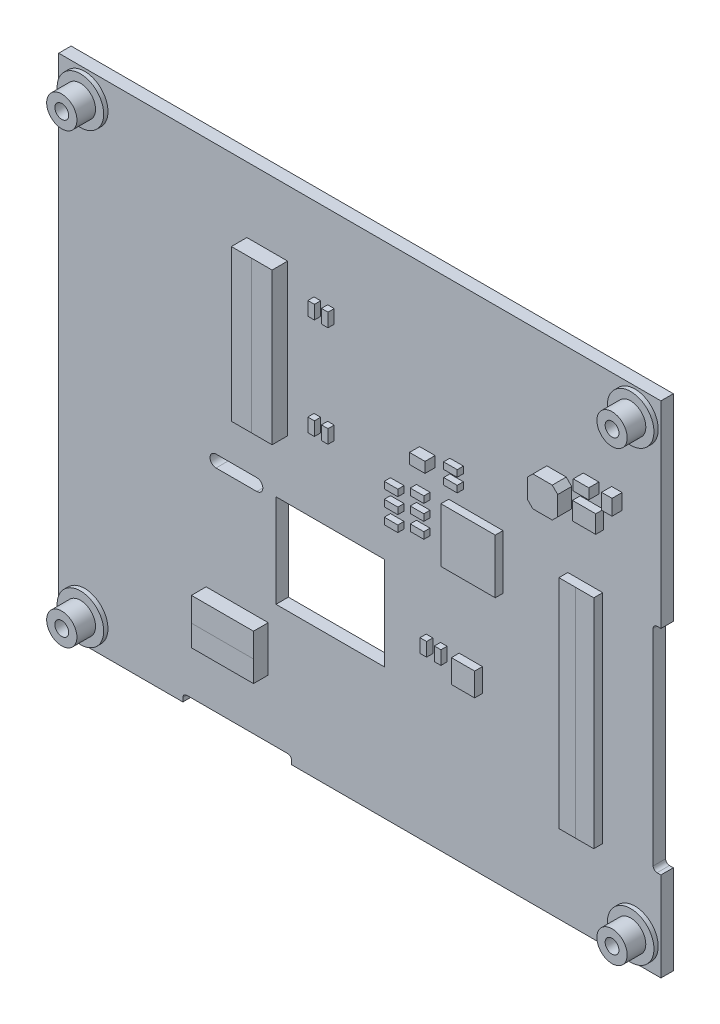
ISO-10303-21;
HEADER;
FILE_DESCRIPTION(('STEP AP214'),'2;1');
FILE_NAME('part.step','',(''),(''),'','','');
FILE_SCHEMA(('AUTOMOTIVE_DESIGN { 1 0 10303 214 1 1 1 1 }'));
ENDSEC;
DATA;
#1=APPLICATION_CONTEXT('core data for automotive mechanical design processes');
#2=APPLICATION_PROTOCOL_DEFINITION('international standard','automotive_design',2000,#1);
#3=PRODUCT_CONTEXT('',#1,'mechanical');
#4=PRODUCT('Part','Part','',(#3));
#5=PRODUCT_RELATED_PRODUCT_CATEGORY('part','',(#4));
#6=PRODUCT_DEFINITION_FORMATION('','',#4);
#7=PRODUCT_DEFINITION_CONTEXT('part definition',#1,'design');
#8=PRODUCT_DEFINITION('design','',#6,#7);
#9=PRODUCT_DEFINITION_SHAPE('','',#8);
#10=(LENGTH_UNIT() NAMED_UNIT(*) SI_UNIT(.MILLI.,.METRE.));
#11=(NAMED_UNIT(*) PLANE_ANGLE_UNIT() SI_UNIT($,.RADIAN.));
#12=(NAMED_UNIT(*) SI_UNIT($,.STERADIAN.) SOLID_ANGLE_UNIT());
#13=UNCERTAINTY_MEASURE_WITH_UNIT(LENGTH_MEASURE(1.E-05),#10,'distance_accuracy_value','');
#14=(GEOMETRIC_REPRESENTATION_CONTEXT(3) GLOBAL_UNCERTAINTY_ASSIGNED_CONTEXT((#13)) GLOBAL_UNIT_ASSIGNED_CONTEXT((#10,
#11,#12)) REPRESENTATION_CONTEXT('',''));
#15=CARTESIAN_POINT('',(0.,0.,0.));
#16=DIRECTION('',(0.,0.,1.));
#17=DIRECTION('',(1.,0.,0.));
#18=AXIS2_PLACEMENT_3D('',#15,#16,#17);
#19=CARTESIAN_POINT('',(-22.3,-31.7,1.6));
#20=DIRECTION('',(0.,0.,1.));
#21=DIRECTION('',(1.,0.,0.));
#22=AXIS2_PLACEMENT_3D('',#19,#20,#21);
#23=PLANE('',#22);
#24=DIRECTION('',(0.,-1.,0.));
#25=VECTOR('',#24,1.);
#26=CARTESIAN_POINT('',(27.3,0.,1.6));
#27=LINE('',#26,#25);
#28=CARTESIAN_POINT('',(27.3,16.9,1.6));
#29=VERTEX_POINT('',#28);
#30=CARTESIAN_POINT('',(27.3,14.4,1.6));
#31=VERTEX_POINT('',#30);
#32=EDGE_CURVE('E836',#29,#31,#27,.T.);
#33=ORIENTED_EDGE('',*,*,#32,.T.);
#34=DIRECTION('',(-0.707106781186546,-0.707106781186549,0.));
#35=VECTOR('',#34,1.);
#36=CARTESIAN_POINT('',(6.45000000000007,-6.45000000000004,1.6));
#37=LINE('',#36,#35);
#38=CARTESIAN_POINT('',(26.6,13.7,1.6));
#39=VERTEX_POINT('',#38);
#40=EDGE_CURVE('E852',#31,#39,#37,.T.);
#41=ORIENTED_EDGE('',*,*,#40,.T.);
#42=DIRECTION('',(1.,0.,0.));
#43=VECTOR('',#42,1.);
#44=CARTESIAN_POINT('',(0.,13.7,1.6));
#45=LINE('',#44,#43);
#46=CARTESIAN_POINT('',(24.1,13.7,1.6));
#47=VERTEX_POINT('',#46);
#48=EDGE_CURVE('E854',#47,#39,#45,.T.);
#49=ORIENTED_EDGE('',*,*,#48,.F.);
#50=DIRECTION('',(0.707106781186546,-0.707106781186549,0.));
#51=VECTOR('',#50,1.);
#52=CARTESIAN_POINT('',(18.9000000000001,18.9,1.6));
#53=LINE('',#52,#51);
#54=CARTESIAN_POINT('',(23.4,14.4,1.6));
#55=VERTEX_POINT('',#54);
#56=EDGE_CURVE('E877',#55,#47,#53,.T.);
#57=ORIENTED_EDGE('',*,*,#56,.F.);
#58=DIRECTION('',(0.,-1.,0.));
#59=VECTOR('',#58,1.);
#60=CARTESIAN_POINT('',(23.4,0.,1.6));
#61=LINE('',#60,#59);
#62=CARTESIAN_POINT('',(23.4,16.9,1.6));
#63=VERTEX_POINT('',#62);
#64=EDGE_CURVE('E874',#63,#55,#61,.T.);
#65=ORIENTED_EDGE('',*,*,#64,.F.);
#66=DIRECTION('',(0.707106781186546,0.707106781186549,0.));
#67=VECTOR('',#66,1.);
#68=CARTESIAN_POINT('',(3.25000000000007,-3.25000000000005,1.6));
#69=LINE('',#68,#67);
#70=CARTESIAN_POINT('',(24.1,17.6,1.6));
#71=VERTEX_POINT('',#70);
#72=EDGE_CURVE('E872',#63,#71,#69,.T.);
#73=ORIENTED_EDGE('',*,*,#72,.T.);
#74=DIRECTION('',(1.,0.,0.));
#75=VECTOR('',#74,1.);
#76=CARTESIAN_POINT('',(0.,17.6,1.6));
#77=LINE('',#76,#75);
#78=CARTESIAN_POINT('',(26.6,17.6,1.6));
#79=VERTEX_POINT('',#78);
#80=EDGE_CURVE('E60',#71,#79,#77,.T.);
#81=ORIENTED_EDGE('',*,*,#80,.T.);
#82=DIRECTION('',(-0.707106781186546,0.707106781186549,0.));
#83=VECTOR('',#82,1.);
#84=CARTESIAN_POINT('',(22.1000000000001,22.1,1.6));
#85=LINE('',#84,#83);
#86=EDGE_CURVE('E55',#29,#79,#85,.T.);
#87=ORIENTED_EDGE('',*,*,#86,.F.);
#88=EDGE_LOOP('',(#33,#41,#49,#57,#65,#73,#81,#87));
#89=FACE_BOUND('',#88,.T.);
#90=DIRECTION('',(0.,-1.,0.));
#91=VECTOR('',#90,1.);
#92=CARTESIAN_POINT('',(31.4,0.,1.6));
#93=LINE('',#92,#91);
#94=CARTESIAN_POINT('',(31.4,16.4,1.6));
#95=VERTEX_POINT('',#94);
#96=CARTESIAN_POINT('',(31.4,14.1,1.6));
#97=VERTEX_POINT('',#96);
#98=EDGE_CURVE('E838',#95,#97,#93,.T.);
#99=ORIENTED_EDGE('',*,*,#98,.T.);
#100=DIRECTION('',(1.,0.,0.));
#101=VECTOR('',#100,1.);
#102=CARTESIAN_POINT('',(0.,14.1,1.6));
#103=LINE('',#102,#101);
#104=CARTESIAN_POINT('',(28.4,14.1,1.6));
#105=VERTEX_POINT('',#104);
#106=EDGE_CURVE('E903',#105,#97,#103,.T.);
#107=ORIENTED_EDGE('',*,*,#106,.F.);
#108=DIRECTION('',(0.,-1.,0.));
#109=VECTOR('',#108,1.);
#110=CARTESIAN_POINT('',(28.4,0.,1.6));
#111=LINE('',#110,#109);
#112=CARTESIAN_POINT('',(28.4,16.4,1.6));
#113=VERTEX_POINT('',#112);
#114=EDGE_CURVE('E916',#113,#105,#111,.T.);
#115=ORIENTED_EDGE('',*,*,#114,.F.);
#116=DIRECTION('',(1.,0.,0.));
#117=VECTOR('',#116,1.);
#118=CARTESIAN_POINT('',(0.,16.4,1.6));
#119=LINE('',#118,#117);
#120=EDGE_CURVE('E913',#113,#95,#119,.T.);
#121=ORIENTED_EDGE('',*,*,#120,.T.);
#122=EDGE_LOOP('',(#99,#107,#115,#121));
#123=FACE_BOUND('',#122,.T.);
#124=DIRECTION('',(0.,-1.,0.));
#125=VECTOR('',#124,1.);
#126=CARTESIAN_POINT('',(15.8,0.,1.6));
#127=LINE('',#126,#125);
#128=CARTESIAN_POINT('',(15.8,-8.94999999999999,1.6));
#129=VERTEX_POINT('',#128);
#130=CARTESIAN_POINT('',(15.8,-11.95,1.6));
#131=VERTEX_POINT('',#130);
#132=EDGE_CURVE('E928',#129,#131,#127,.T.);
#133=ORIENTED_EDGE('',*,*,#132,.T.);
#134=DIRECTION('',(1.,0.,0.));
#135=VECTOR('',#134,1.);
#136=CARTESIAN_POINT('',(0.,-11.95,1.6));
#137=LINE('',#136,#135);
#138=CARTESIAN_POINT('',(12.8,-11.95,1.6));
#139=VERTEX_POINT('',#138);
#140=EDGE_CURVE('E933',#139,#131,#137,.T.);
#141=ORIENTED_EDGE('',*,*,#140,.F.);
#142=DIRECTION('',(0.,-1.,0.));
#143=VECTOR('',#142,1.);
#144=CARTESIAN_POINT('',(12.8,0.,1.6));
#145=LINE('',#144,#143);
#146=CARTESIAN_POINT('',(12.8,-8.94999999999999,1.6));
#147=VERTEX_POINT('',#146);
#148=EDGE_CURVE('E946',#147,#139,#145,.T.);
#149=ORIENTED_EDGE('',*,*,#148,.F.);
#150=DIRECTION('',(1.,0.,0.));
#151=VECTOR('',#150,1.);
#152=CARTESIAN_POINT('',(0.,-8.95,1.6));
#153=LINE('',#152,#151);
#154=EDGE_CURVE('E943',#147,#129,#153,.T.);
#155=ORIENTED_EDGE('',*,*,#154,.T.);
#156=EDGE_LOOP('',(#133,#141,#149,#155));
#157=FACE_BOUND('',#156,.T.);
#158=DIRECTION('',(0.,-1.,0.));
#159=VECTOR('',#158,1.);
#160=CARTESIAN_POINT('',(18.45,0.,1.6));
#161=LINE('',#160,#159);
#162=CARTESIAN_POINT('',(18.45,7.55000000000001,1.6));
#163=VERTEX_POINT('',#162);
#164=CARTESIAN_POINT('',(18.45,0.550000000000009,1.6));
#165=VERTEX_POINT('',#164);
#166=EDGE_CURVE('E958',#163,#165,#161,.T.);
#167=ORIENTED_EDGE('',*,*,#166,.T.);
#168=DIRECTION('',(1.,0.,0.));
#169=VECTOR('',#168,1.);
#170=CARTESIAN_POINT('',(0.,0.550000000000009,1.6));
#171=LINE('',#170,#169);
#172=CARTESIAN_POINT('',(11.45,0.550000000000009,1.6));
#173=VERTEX_POINT('',#172);
#174=EDGE_CURVE('E963',#173,#165,#171,.T.);
#175=ORIENTED_EDGE('',*,*,#174,.F.);
#176=DIRECTION('',(0.,-1.,0.));
#177=VECTOR('',#176,1.);
#178=CARTESIAN_POINT('',(11.45,0.,1.6));
#179=LINE('',#178,#177);
#180=CARTESIAN_POINT('',(11.45,7.55000000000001,1.6));
#181=VERTEX_POINT('',#180);
#182=EDGE_CURVE('E976',#181,#173,#179,.T.);
#183=ORIENTED_EDGE('',*,*,#182,.F.);
#184=DIRECTION('',(1.,0.,0.));
#185=VECTOR('',#184,1.);
#186=CARTESIAN_POINT('',(0.,7.55000000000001,1.6));
#187=LINE('',#186,#185);
#188=EDGE_CURVE('E973',#181,#163,#187,.T.);
#189=ORIENTED_EDGE('',*,*,#188,.T.);
#190=EDGE_LOOP('',(#167,#175,#183,#189));
#191=FACE_BOUND('',#190,.T.);
#192=DIRECTION('',(0.,-1.,0.));
#193=VECTOR('',#192,1.);
#194=CARTESIAN_POINT('',(33.8,0.,1.6));
#195=LINE('',#194,#193);
#196=CARTESIAN_POINT('',(33.8,19.475,1.6));
#197=VERTEX_POINT('',#196);
#198=CARTESIAN_POINT('',(33.8,17.475,1.6));
#199=VERTEX_POINT('',#198);
#200=EDGE_CURVE('E988',#197,#199,#195,.T.);
#201=ORIENTED_EDGE('',*,*,#200,.T.);
#202=DIRECTION('',(1.,0.,0.));
#203=VECTOR('',#202,1.);
#204=CARTESIAN_POINT('',(0.,17.475,1.6));
#205=LINE('',#204,#203);
#206=CARTESIAN_POINT('',(32.45,17.475,1.6));
#207=VERTEX_POINT('',#206);
#208=EDGE_CURVE('E993',#207,#199,#205,.T.);
#209=ORIENTED_EDGE('',*,*,#208,.F.);
#210=DIRECTION('',(0.,-1.,0.));
#211=VECTOR('',#210,1.);
#212=CARTESIAN_POINT('',(32.45,0.,1.6));
#213=LINE('',#212,#211);
#214=CARTESIAN_POINT('',(32.45,19.475,1.6));
#215=VERTEX_POINT('',#214);
#216=EDGE_CURVE('E1006',#215,#207,#213,.T.);
#217=ORIENTED_EDGE('',*,*,#216,.F.);
#218=DIRECTION('',(1.,0.,0.));
#219=VECTOR('',#218,1.);
#220=CARTESIAN_POINT('',(0.,19.475,1.6));
#221=LINE('',#220,#219);
#222=EDGE_CURVE('E1003',#215,#197,#221,.T.);
#223=ORIENTED_EDGE('',*,*,#222,.T.);
#224=EDGE_LOOP('',(#201,#209,#217,#223));
#225=FACE_BOUND('',#224,.T.);
#226=DIRECTION('',(0.,-1.,0.));
#227=VECTOR('',#226,1.);
#228=CARTESIAN_POINT('',(30.8,0.,1.6));
#229=LINE('',#228,#227);
#230=CARTESIAN_POINT('',(30.8,19.15,1.6));
#231=VERTEX_POINT('',#230);
#232=CARTESIAN_POINT('',(30.8,17.8,1.6));
#233=VERTEX_POINT('',#232);
#234=EDGE_CURVE('E1018',#231,#233,#229,.T.);
#235=ORIENTED_EDGE('',*,*,#234,.T.);
#236=DIRECTION('',(1.,0.,0.));
#237=VECTOR('',#236,1.);
#238=CARTESIAN_POINT('',(0.,17.8,1.6));
#239=LINE('',#238,#237);
#240=CARTESIAN_POINT('',(28.8,17.8,1.6));
#241=VERTEX_POINT('',#240);
#242=EDGE_CURVE('E1023',#241,#233,#239,.T.);
#243=ORIENTED_EDGE('',*,*,#242,.F.);
#244=DIRECTION('',(0.,-1.,0.));
#245=VECTOR('',#244,1.);
#246=CARTESIAN_POINT('',(28.8,0.,1.6));
#247=LINE('',#246,#245);
#248=CARTESIAN_POINT('',(28.8,19.15,1.6));
#249=VERTEX_POINT('',#248);
#250=EDGE_CURVE('E1036',#249,#241,#247,.T.);
#251=ORIENTED_EDGE('',*,*,#250,.F.);
#252=DIRECTION('',(1.,0.,0.));
#253=VECTOR('',#252,1.);
#254=CARTESIAN_POINT('',(0.,19.15,1.6));
#255=LINE('',#254,#253);
#256=EDGE_CURVE('E1033',#249,#231,#255,.T.);
#257=ORIENTED_EDGE('',*,*,#256,.T.);
#258=EDGE_LOOP('',(#235,#243,#251,#257));
#259=FACE_BOUND('',#258,.T.);
#260=DIRECTION('',(0.,-1.,0.));
#261=VECTOR('',#260,1.);
#262=CARTESIAN_POINT('',(9.70000000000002,0.,1.6));
#263=LINE('',#262,#261);
#264=CARTESIAN_POINT('',(9.70000000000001,11.55,1.6));
#265=VERTEX_POINT('',#264);
#266=CARTESIAN_POINT('',(9.70000000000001,10.2,1.6));
#267=VERTEX_POINT('',#266);
#268=EDGE_CURVE('E1048',#265,#267,#263,.T.);
#269=ORIENTED_EDGE('',*,*,#268,.T.);
#270=DIRECTION('',(1.,0.,0.));
#271=VECTOR('',#270,1.);
#272=CARTESIAN_POINT('',(0.,10.2,1.6));
#273=LINE('',#272,#271);
#274=CARTESIAN_POINT('',(7.70000000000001,10.2,1.6));
#275=VERTEX_POINT('',#274);
#276=EDGE_CURVE('E1053',#275,#267,#273,.T.);
#277=ORIENTED_EDGE('',*,*,#276,.F.);
#278=DIRECTION('',(0.,-1.,0.));
#279=VECTOR('',#278,1.);
#280=CARTESIAN_POINT('',(7.70000000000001,0.,1.6));
#281=LINE('',#280,#279);
#282=CARTESIAN_POINT('',(7.70000000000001,11.55,1.6));
#283=VERTEX_POINT('',#282);
#284=EDGE_CURVE('E1066',#283,#275,#281,.T.);
#285=ORIENTED_EDGE('',*,*,#284,.F.);
#286=DIRECTION('',(1.,0.,0.));
#287=VECTOR('',#286,1.);
#288=CARTESIAN_POINT('',(0.,11.55,1.6));
#289=LINE('',#288,#287);
#290=EDGE_CURVE('E1063',#283,#265,#289,.T.);
#291=ORIENTED_EDGE('',*,*,#290,.T.);
#292=EDGE_LOOP('',(#269,#277,#285,#291));
#293=FACE_BOUND('',#292,.T.);
#294=DIRECTION('',(1.,0.,0.));
#295=VECTOR('',#294,1.);
#296=CARTESIAN_POINT('',(10.4,-8.94999999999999,1.6));
#297=LINE('',#296,#295);
#298=CARTESIAN_POINT('',(10.4,-8.94999999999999,1.6));
#299=VERTEX_POINT('',#298);
#300=CARTESIAN_POINT('',(11.25,-8.94999999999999,1.6));
#301=VERTEX_POINT('',#300);
#302=EDGE_CURVE('E1100',#299,#301,#297,.T.);
#303=ORIENTED_EDGE('',*,*,#302,.T.);
#304=DIRECTION('',(0.,-1.,0.));
#305=VECTOR('',#304,1.);
#306=CARTESIAN_POINT('',(11.25,-8.94999999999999,1.6));
#307=LINE('',#306,#305);
#308=CARTESIAN_POINT('',(11.25,-10.7,1.6));
#309=VERTEX_POINT('',#308);
#310=EDGE_CURVE('E1098',#301,#309,#307,.T.);
#311=ORIENTED_EDGE('',*,*,#310,.T.);
#312=DIRECTION('',(1.,0.,0.));
#313=VECTOR('',#312,1.);
#314=CARTESIAN_POINT('',(10.4,-10.7,1.6));
#315=LINE('',#314,#313);
#316=CARTESIAN_POINT('',(10.4,-10.7,1.6));
#317=VERTEX_POINT('',#316);
#318=EDGE_CURVE('E1094',#317,#309,#315,.T.);
#319=ORIENTED_EDGE('',*,*,#318,.F.);
#320=DIRECTION('',(0.,-1.,0.));
#321=VECTOR('',#320,1.);
#322=CARTESIAN_POINT('',(10.4,-8.94999999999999,1.6));
#323=LINE('',#322,#321);
#324=EDGE_CURVE('E1091',#299,#317,#323,.T.);
#325=ORIENTED_EDGE('',*,*,#324,.F.);
#326=EDGE_LOOP('',(#303,#311,#319,#325));
#327=FACE_BOUND('',#326,.T.);
#328=DIRECTION('',(1.,0.,0.));
#329=VECTOR('',#328,1.);
#330=CARTESIAN_POINT('',(8.55000000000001,-8.94999999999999,1.6));
#331=LINE('',#330,#329);
#332=CARTESIAN_POINT('',(8.55000000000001,-8.94999999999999,1.6));
#333=VERTEX_POINT('',#332);
#334=CARTESIAN_POINT('',(9.40000000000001,-8.94999999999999,1.6));
#335=VERTEX_POINT('',#334);
#336=EDGE_CURVE('E1132',#333,#335,#331,.T.);
#337=ORIENTED_EDGE('',*,*,#336,.T.);
#338=DIRECTION('',(0.,-1.,0.));
#339=VECTOR('',#338,1.);
#340=CARTESIAN_POINT('',(9.40000000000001,-8.94999999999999,1.6));
#341=LINE('',#340,#339);
#342=CARTESIAN_POINT('',(9.40000000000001,-10.7,1.6));
#343=VERTEX_POINT('',#342);
#344=EDGE_CURVE('E1130',#335,#343,#341,.T.);
#345=ORIENTED_EDGE('',*,*,#344,.T.);
#346=DIRECTION('',(1.,0.,0.));
#347=VECTOR('',#346,1.);
#348=CARTESIAN_POINT('',(8.55000000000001,-10.7,1.6));
#349=LINE('',#348,#347);
#350=CARTESIAN_POINT('',(8.55000000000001,-10.7,1.6));
#351=VERTEX_POINT('',#350);
#352=EDGE_CURVE('E1126',#351,#343,#349,.T.);
#353=ORIENTED_EDGE('',*,*,#352,.F.);
#354=DIRECTION('',(0.,-1.,0.));
#355=VECTOR('',#354,1.);
#356=CARTESIAN_POINT('',(8.55000000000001,-8.94999999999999,1.6));
#357=LINE('',#356,#355);
#358=EDGE_CURVE('E1123',#333,#351,#357,.T.);
#359=ORIENTED_EDGE('',*,*,#358,.F.);
#360=EDGE_LOOP('',(#337,#345,#353,#359));
#361=FACE_BOUND('',#360,.T.);
#362=DIRECTION('',(1.,0.,0.));
#363=VECTOR('',#362,1.);
#364=CARTESIAN_POINT('',(-4.14999999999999,8.45,1.6));
#365=LINE('',#364,#363);
#366=CARTESIAN_POINT('',(-4.14999999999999,8.44999999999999,1.6));
#367=VERTEX_POINT('',#366);
#368=CARTESIAN_POINT('',(-3.29999999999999,8.45,1.6));
#369=VERTEX_POINT('',#368);
#370=EDGE_CURVE('E1230',#367,#369,#365,.T.);
#371=ORIENTED_EDGE('',*,*,#370,.T.);
#372=DIRECTION('',(0.,-1.,0.));
#373=VECTOR('',#372,1.);
#374=CARTESIAN_POINT('',(-3.29999999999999,8.45,1.6));
#375=LINE('',#374,#373);
#376=CARTESIAN_POINT('',(-3.29999999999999,6.7,1.6));
#377=VERTEX_POINT('',#376);
#378=EDGE_CURVE('E1228',#369,#377,#375,.T.);
#379=ORIENTED_EDGE('',*,*,#378,.T.);
#380=DIRECTION('',(1.,0.,0.));
#381=VECTOR('',#380,1.);
#382=CARTESIAN_POINT('',(-4.14999999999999,6.69999999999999,1.6));
#383=LINE('',#382,#381);
#384=CARTESIAN_POINT('',(-4.14999999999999,6.7,1.6));
#385=VERTEX_POINT('',#384);
#386=EDGE_CURVE('E1224',#385,#377,#383,.T.);
#387=ORIENTED_EDGE('',*,*,#386,.F.);
#388=DIRECTION('',(0.,-1.,0.));
#389=VECTOR('',#388,1.);
#390=CARTESIAN_POINT('',(-4.14999999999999,8.45,1.6));
#391=LINE('',#390,#389);
#392=EDGE_CURVE('E1221',#367,#385,#391,.T.);
#393=ORIENTED_EDGE('',*,*,#392,.F.);
#394=EDGE_LOOP('',(#371,#379,#387,#393));
#395=FACE_BOUND('',#394,.T.);
#396=DIRECTION('',(1.,0.,0.));
#397=VECTOR('',#396,1.);
#398=CARTESIAN_POINT('',(-5.89999999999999,8.45,1.6));
#399=LINE('',#398,#397);
#400=CARTESIAN_POINT('',(-5.89999999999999,8.44999999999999,1.6));
#401=VERTEX_POINT('',#400);
#402=CARTESIAN_POINT('',(-5.04999999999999,8.45,1.6));
#403=VERTEX_POINT('',#402);
#404=EDGE_CURVE('E1262',#401,#403,#399,.T.);
#405=ORIENTED_EDGE('',*,*,#404,.T.);
#406=DIRECTION('',(0.,-1.,0.));
#407=VECTOR('',#406,1.);
#408=CARTESIAN_POINT('',(-5.04999999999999,8.45,1.6));
#409=LINE('',#408,#407);
#410=CARTESIAN_POINT('',(-5.04999999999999,6.7,1.6));
#411=VERTEX_POINT('',#410);
#412=EDGE_CURVE('E1260',#403,#411,#409,.T.);
#413=ORIENTED_EDGE('',*,*,#412,.T.);
#414=DIRECTION('',(1.,0.,0.));
#415=VECTOR('',#414,1.);
#416=CARTESIAN_POINT('',(-5.89999999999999,6.69999999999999,1.6));
#417=LINE('',#416,#415);
#418=CARTESIAN_POINT('',(-5.89999999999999,6.7,1.6));
#419=VERTEX_POINT('',#418);
#420=EDGE_CURVE('E1256',#419,#411,#417,.T.);
#421=ORIENTED_EDGE('',*,*,#420,.F.);
#422=DIRECTION('',(0.,-1.,0.));
#423=VECTOR('',#422,1.);
#424=CARTESIAN_POINT('',(-5.89999999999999,8.45,1.6));
#425=LINE('',#424,#423);
#426=EDGE_CURVE('E1253',#401,#419,#425,.T.);
#427=ORIENTED_EDGE('',*,*,#426,.F.);
#428=EDGE_LOOP('',(#405,#413,#421,#427));
#429=FACE_BOUND('',#428,.T.);
#430=DIRECTION('',(1.,0.,0.));
#431=VECTOR('',#430,1.);
#432=CARTESIAN_POINT('',(-4.15000000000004,21.45,1.6));
#433=LINE('',#432,#431);
#434=CARTESIAN_POINT('',(-4.15000000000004,21.45,1.6));
#435=VERTEX_POINT('',#434);
#436=CARTESIAN_POINT('',(-3.30000000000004,21.45,1.6));
#437=VERTEX_POINT('',#436);
#438=EDGE_CURVE('E1294',#435,#437,#433,.T.);
#439=ORIENTED_EDGE('',*,*,#438,.T.);
#440=DIRECTION('',(0.,-1.,0.));
#441=VECTOR('',#440,1.);
#442=CARTESIAN_POINT('',(-3.30000000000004,21.45,1.6));
#443=LINE('',#442,#441);
#444=CARTESIAN_POINT('',(-3.30000000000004,19.7,1.6));
#445=VERTEX_POINT('',#444);
#446=EDGE_CURVE('E1292',#437,#445,#443,.T.);
#447=ORIENTED_EDGE('',*,*,#446,.T.);
#448=DIRECTION('',(1.,0.,0.));
#449=VECTOR('',#448,1.);
#450=CARTESIAN_POINT('',(-4.15000000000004,19.7,1.6));
#451=LINE('',#450,#449);
#452=CARTESIAN_POINT('',(-4.15000000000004,19.7,1.6));
#453=VERTEX_POINT('',#452);
#454=EDGE_CURVE('E1288',#453,#445,#451,.T.);
#455=ORIENTED_EDGE('',*,*,#454,.F.);
#456=DIRECTION('',(0.,-1.,0.));
#457=VECTOR('',#456,1.);
#458=CARTESIAN_POINT('',(-4.15000000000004,21.45,1.6));
#459=LINE('',#458,#457);
#460=EDGE_CURVE('E1285',#435,#453,#459,.T.);
#461=ORIENTED_EDGE('',*,*,#460,.F.);
#462=EDGE_LOOP('',(#439,#447,#455,#461));
#463=FACE_BOUND('',#462,.T.);
#464=DIRECTION('',(0.,-1.,0.));
#465=VECTOR('',#464,1.);
#466=CARTESIAN_POINT('',(13.35,0.,1.6));
#467=LINE('',#466,#465);
#468=CARTESIAN_POINT('',(13.35,12.2,1.6));
#469=VERTEX_POINT('',#468);
#470=CARTESIAN_POINT('',(13.35,11.35,1.6));
#471=VERTEX_POINT('',#470);
#472=EDGE_CURVE('E1323',#469,#471,#467,.T.);
#473=ORIENTED_EDGE('',*,*,#472,.T.);
#474=DIRECTION('',(1.,0.,0.));
#475=VECTOR('',#474,1.);
#476=CARTESIAN_POINT('',(0.,11.35,1.6));
#477=LINE('',#476,#475);
#478=CARTESIAN_POINT('',(11.6,11.35,1.6));
#479=VERTEX_POINT('',#478);
#480=EDGE_CURVE('E1313',#479,#471,#477,.T.);
#481=ORIENTED_EDGE('',*,*,#480,.F.);
#482=DIRECTION('',(0.,-1.,0.));
#483=VECTOR('',#482,1.);
#484=CARTESIAN_POINT('',(11.6,0.,1.6));
#485=LINE('',#484,#483);
#486=CARTESIAN_POINT('',(11.6,12.2,1.6));
#487=VERTEX_POINT('',#486);
#488=EDGE_CURVE('E1316',#487,#479,#485,.T.);
#489=ORIENTED_EDGE('',*,*,#488,.F.);
#490=DIRECTION('',(1.,0.,0.));
#491=VECTOR('',#490,1.);
#492=CARTESIAN_POINT('',(0.,12.2,1.6));
#493=LINE('',#492,#491);
#494=EDGE_CURVE('E1320',#487,#469,#493,.T.);
#495=ORIENTED_EDGE('',*,*,#494,.T.);
#496=EDGE_LOOP('',(#473,#481,#489,#495));
#497=FACE_BOUND('',#496,.T.);
#498=DIRECTION('',(0.,-1.,0.));
#499=VECTOR('',#498,1.);
#500=CARTESIAN_POINT('',(13.35,0.,1.6));
#501=LINE('',#500,#499);
#502=CARTESIAN_POINT('',(13.35,10.45,1.6));
#503=VERTEX_POINT('',#502);
#504=CARTESIAN_POINT('',(13.35,9.59999999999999,1.6));
#505=VERTEX_POINT('',#504);
#506=EDGE_CURVE('E1353',#503,#505,#501,.T.);
#507=ORIENTED_EDGE('',*,*,#506,.T.);
#508=DIRECTION('',(1.,0.,0.));
#509=VECTOR('',#508,1.);
#510=CARTESIAN_POINT('',(0.,9.59999999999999,1.6));
#511=LINE('',#510,#509);
#512=CARTESIAN_POINT('',(11.6,9.59999999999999,1.6));
#513=VERTEX_POINT('',#512);
#514=EDGE_CURVE('E1343',#513,#505,#511,.T.);
#515=ORIENTED_EDGE('',*,*,#514,.F.);
#516=DIRECTION('',(0.,-1.,0.));
#517=VECTOR('',#516,1.);
#518=CARTESIAN_POINT('',(11.6,0.,1.6));
#519=LINE('',#518,#517);
#520=CARTESIAN_POINT('',(11.6,10.45,1.6));
#521=VERTEX_POINT('',#520);
#522=EDGE_CURVE('E1346',#521,#513,#519,.T.);
#523=ORIENTED_EDGE('',*,*,#522,.F.);
#524=DIRECTION('',(1.,0.,0.));
#525=VECTOR('',#524,1.);
#526=CARTESIAN_POINT('',(0.,10.45,1.6));
#527=LINE('',#526,#525);
#528=EDGE_CURVE('E1350',#521,#503,#527,.T.);
#529=ORIENTED_EDGE('',*,*,#528,.T.);
#530=EDGE_LOOP('',(#507,#515,#523,#529));
#531=FACE_BOUND('',#530,.T.);
#532=DIRECTION('',(0.,-1.,0.));
#533=VECTOR('',#532,1.);
#534=CARTESIAN_POINT('',(9.05000000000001,0.,1.6));
#535=LINE('',#534,#533);
#536=CARTESIAN_POINT('',(9.05000000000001,3.12499999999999,1.6));
#537=VERTEX_POINT('',#536);
#538=CARTESIAN_POINT('',(9.05000000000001,2.27499999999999,1.6));
#539=VERTEX_POINT('',#538);
#540=EDGE_CURVE('E1383',#537,#539,#535,.T.);
#541=ORIENTED_EDGE('',*,*,#540,.T.);
#542=DIRECTION('',(1.,0.,0.));
#543=VECTOR('',#542,1.);
#544=CARTESIAN_POINT('',(0.,2.27499999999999,1.6));
#545=LINE('',#544,#543);
#546=CARTESIAN_POINT('',(7.30000000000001,2.27499999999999,1.6));
#547=VERTEX_POINT('',#546);
#548=EDGE_CURVE('E1373',#547,#539,#545,.T.);
#549=ORIENTED_EDGE('',*,*,#548,.F.);
#550=DIRECTION('',(0.,-1.,0.));
#551=VECTOR('',#550,1.);
#552=CARTESIAN_POINT('',(7.30000000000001,0.,1.6));
#553=LINE('',#552,#551);
#554=CARTESIAN_POINT('',(7.30000000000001,3.12499999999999,1.6));
#555=VERTEX_POINT('',#554);
#556=EDGE_CURVE('E1376',#555,#547,#553,.T.);
#557=ORIENTED_EDGE('',*,*,#556,.F.);
#558=DIRECTION('',(1.,0.,0.));
#559=VECTOR('',#558,1.);
#560=CARTESIAN_POINT('',(0.,3.12499999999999,1.6));
#561=LINE('',#560,#559);
#562=EDGE_CURVE('E1380',#555,#537,#561,.T.);
#563=ORIENTED_EDGE('',*,*,#562,.T.);
#564=EDGE_LOOP('',(#541,#549,#557,#563));
#565=FACE_BOUND('',#564,.T.);
#566=DIRECTION('',(0.,-1.,0.));
#567=VECTOR('',#566,1.);
#568=CARTESIAN_POINT('',(5.7,0.,1.6));
#569=LINE('',#568,#567);
#570=CARTESIAN_POINT('',(5.7,2.19999999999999,1.6));
#571=VERTEX_POINT('',#570);
#572=CARTESIAN_POINT('',(5.7,1.34999999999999,1.6));
#573=VERTEX_POINT('',#572);
#574=EDGE_CURVE('E1413',#571,#573,#569,.T.);
#575=ORIENTED_EDGE('',*,*,#574,.T.);
#576=DIRECTION('',(1.,0.,0.));
#577=VECTOR('',#576,1.);
#578=CARTESIAN_POINT('',(0.,1.34999999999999,1.6));
#579=LINE('',#578,#577);
#580=CARTESIAN_POINT('',(3.95000000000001,1.34999999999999,1.6));
#581=VERTEX_POINT('',#580);
#582=EDGE_CURVE('E1403',#581,#573,#579,.T.);
#583=ORIENTED_EDGE('',*,*,#582,.F.);
#584=DIRECTION('',(0.,-1.,0.));
#585=VECTOR('',#584,1.);
#586=CARTESIAN_POINT('',(3.95,0.,1.6));
#587=LINE('',#586,#585);
#588=CARTESIAN_POINT('',(3.95,2.19999999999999,1.6));
#589=VERTEX_POINT('',#588);
#590=EDGE_CURVE('E1406',#589,#581,#587,.T.);
#591=ORIENTED_EDGE('',*,*,#590,.F.);
#592=DIRECTION('',(1.,0.,0.));
#593=VECTOR('',#592,1.);
#594=CARTESIAN_POINT('',(0.,2.19999999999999,1.6));
#595=LINE('',#594,#593);
#596=EDGE_CURVE('E1410',#589,#571,#595,.T.);
#597=ORIENTED_EDGE('',*,*,#596,.T.);
#598=EDGE_LOOP('',(#575,#583,#591,#597));
#599=FACE_BOUND('',#598,.T.);
#600=DIRECTION('',(0.,-1.,0.));
#601=VECTOR('',#600,1.);
#602=CARTESIAN_POINT('',(9.05,0.,1.6));
#603=LINE('',#602,#601);
#604=CARTESIAN_POINT('',(9.05,7.12499999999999,1.6));
#605=VERTEX_POINT('',#604);
#606=CARTESIAN_POINT('',(9.05,6.27499999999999,1.6));
#607=VERTEX_POINT('',#606);
#608=EDGE_CURVE('E1443',#605,#607,#603,.T.);
#609=ORIENTED_EDGE('',*,*,#608,.T.);
#610=DIRECTION('',(1.,0.,0.));
#611=VECTOR('',#610,1.);
#612=CARTESIAN_POINT('',(0.,6.27499999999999,1.6));
#613=LINE('',#612,#611);
#614=CARTESIAN_POINT('',(7.3,6.27499999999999,1.6));
#615=VERTEX_POINT('',#614);
#616=EDGE_CURVE('E1433',#615,#607,#613,.T.);
#617=ORIENTED_EDGE('',*,*,#616,.F.);
#618=DIRECTION('',(0.,-1.,0.));
#619=VECTOR('',#618,1.);
#620=CARTESIAN_POINT('',(7.3,0.,1.6));
#621=LINE('',#620,#619);
#622=CARTESIAN_POINT('',(7.3,7.12499999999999,1.6));
#623=VERTEX_POINT('',#622);
#624=EDGE_CURVE('E1436',#623,#615,#621,.T.);
#625=ORIENTED_EDGE('',*,*,#624,.F.);
#626=DIRECTION('',(1.,0.,0.));
#627=VECTOR('',#626,1.);
#628=CARTESIAN_POINT('',(0.,7.12499999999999,1.6));
#629=LINE('',#628,#627);
#630=EDGE_CURVE('E1440',#623,#605,#629,.T.);
#631=ORIENTED_EDGE('',*,*,#630,.T.);
#632=EDGE_LOOP('',(#609,#617,#625,#631));
#633=FACE_BOUND('',#632,.T.);
#634=DIRECTION('',(0.,-1.,0.));
#635=VECTOR('',#634,1.);
#636=CARTESIAN_POINT('',(5.69999999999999,0.,1.6));
#637=LINE('',#636,#635);
#638=CARTESIAN_POINT('',(5.69999999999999,6.19999999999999,1.6));
#639=VERTEX_POINT('',#638);
#640=CARTESIAN_POINT('',(5.69999999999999,5.34999999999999,1.6));
#641=VERTEX_POINT('',#640);
#642=EDGE_CURVE('E1473',#639,#641,#637,.T.);
#643=ORIENTED_EDGE('',*,*,#642,.T.);
#644=DIRECTION('',(1.,0.,0.));
#645=VECTOR('',#644,1.);
#646=CARTESIAN_POINT('',(0.,5.34999999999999,1.6));
#647=LINE('',#646,#645);
#648=CARTESIAN_POINT('',(3.94999999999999,5.34999999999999,1.6));
#649=VERTEX_POINT('',#648);
#650=EDGE_CURVE('E1463',#649,#641,#647,.T.);
#651=ORIENTED_EDGE('',*,*,#650,.F.);
#652=DIRECTION('',(0.,-1.,0.));
#653=VECTOR('',#652,1.);
#654=CARTESIAN_POINT('',(3.94999999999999,0.,1.6));
#655=LINE('',#654,#653);
#656=CARTESIAN_POINT('',(3.94999999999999,6.19999999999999,1.6));
#657=VERTEX_POINT('',#656);
#658=EDGE_CURVE('E1466',#657,#649,#655,.T.);
#659=ORIENTED_EDGE('',*,*,#658,.F.);
#660=DIRECTION('',(1.,0.,0.));
#661=VECTOR('',#660,1.);
#662=CARTESIAN_POINT('',(0.,6.19999999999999,1.6));
#663=LINE('',#662,#661);
#664=EDGE_CURVE('E1470',#657,#639,#663,.T.);
#665=ORIENTED_EDGE('',*,*,#664,.T.);
#666=EDGE_LOOP('',(#643,#651,#659,#665));
#667=FACE_BOUND('',#666,.T.);
#668=DIRECTION('',(0.,-1.,0.));
#669=VECTOR('',#668,1.);
#670=CARTESIAN_POINT('',(-5.05000000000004,0.,1.6));
#671=LINE('',#670,#669);
#672=CARTESIAN_POINT('',(-5.05000000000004,21.45,1.6));
#673=VERTEX_POINT('',#672);
#674=CARTESIAN_POINT('',(-5.05000000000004,19.7,1.6));
#675=VERTEX_POINT('',#674);
#676=EDGE_CURVE('E1476',#673,#675,#671,.T.);
#677=ORIENTED_EDGE('',*,*,#676,.T.);
#678=DIRECTION('',(1.,0.,0.));
#679=VECTOR('',#678,1.);
#680=CARTESIAN_POINT('',(0.,19.7,1.6));
#681=LINE('',#680,#679);
#682=CARTESIAN_POINT('',(-5.90000000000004,19.7,1.6));
#683=VERTEX_POINT('',#682);
#684=EDGE_CURVE('E1489',#683,#675,#681,.T.);
#685=ORIENTED_EDGE('',*,*,#684,.F.);
#686=DIRECTION('',(0.,-1.,0.));
#687=VECTOR('',#686,1.);
#688=CARTESIAN_POINT('',(-5.90000000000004,0.,1.6));
#689=LINE('',#688,#687);
#690=CARTESIAN_POINT('',(-5.90000000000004,21.45,1.6));
#691=VERTEX_POINT('',#690);
#692=EDGE_CURVE('E1502',#691,#683,#689,.T.);
#693=ORIENTED_EDGE('',*,*,#692,.F.);
#694=DIRECTION('',(1.,0.,0.));
#695=VECTOR('',#694,1.);
#696=CARTESIAN_POINT('',(0.,21.45,1.6));
#697=LINE('',#696,#695);
#698=EDGE_CURVE('E1499',#691,#673,#697,.T.);
#699=ORIENTED_EDGE('',*,*,#698,.T.);
#700=EDGE_LOOP('',(#677,#685,#693,#699));
#701=FACE_BOUND('',#700,.T.);
#702=CARTESIAN_POINT('',(-35.45,-28.85,1.6));
#703=DIRECTION('',(0.,0.,1.));
#704=DIRECTION('',(-1.,0.,0.));
#705=AXIS2_PLACEMENT_3D('',#702,#703,#704);
#706=CIRCLE('',#705,3.);
#707=CARTESIAN_POINT('',(-38.45,-28.85,1.6));
#708=VERTEX_POINT('',#707);
#709=EDGE_CURVE('E1553',#708,#708,#706,.T.);
#710=ORIENTED_EDGE('',*,*,#709,.F.);
#711=EDGE_LOOP('',(#710));
#712=FACE_BOUND('',#711,.T.);
#713=CARTESIAN_POINT('',(35.45,-28.85,1.6));
#714=DIRECTION('',(0.,0.,1.));
#715=DIRECTION('',(1.,0.,0.));
#716=AXIS2_PLACEMENT_3D('',#713,#714,#715);
#717=CIRCLE('',#716,3.);
#718=CARTESIAN_POINT('',(38.45,-28.85,1.6));
#719=VERTEX_POINT('',#718);
#720=EDGE_CURVE('E1562',#719,#719,#717,.T.);
#721=ORIENTED_EDGE('',*,*,#720,.F.);
#722=EDGE_LOOP('',(#721));
#723=FACE_BOUND('',#722,.T.);
#724=CARTESIAN_POINT('',(35.45,28.85,1.6));
#725=DIRECTION('',(0.,0.,1.));
#726=DIRECTION('',(-1.,0.,0.));
#727=AXIS2_PLACEMENT_3D('',#724,#725,#726);
#728=CIRCLE('',#727,3.);
#729=CARTESIAN_POINT('',(32.45,28.85,1.6));
#730=VERTEX_POINT('',#729);
#731=EDGE_CURVE('E1571',#730,#730,#728,.T.);
#732=ORIENTED_EDGE('',*,*,#731,.F.);
#733=EDGE_LOOP('',(#732));
#734=FACE_BOUND('',#733,.T.);
#735=CARTESIAN_POINT('',(-35.45,28.85,1.6));
#736=DIRECTION('',(0.,0.,1.));
#737=DIRECTION('',(1.,0.,0.));
#738=AXIS2_PLACEMENT_3D('',#735,#736,#737);
#739=CIRCLE('',#738,3.);
#740=CARTESIAN_POINT('',(-32.45,28.85,1.6));
#741=VERTEX_POINT('',#740);
#742=EDGE_CURVE('E1580',#741,#741,#739,.T.);
#743=ORIENTED_EDGE('',*,*,#742,.F.);
#744=EDGE_LOOP('',(#743));
#745=FACE_BOUND('',#744,.T.);
#746=DIRECTION('',(0.,-1.,0.));
#747=VECTOR('',#746,1.);
#748=CARTESIAN_POINT('',(-9.3,0.,1.6));
#749=LINE('',#748,#747);
#750=CARTESIAN_POINT('',(-9.3,23.75,1.6));
#751=VERTEX_POINT('',#750);
#752=CARTESIAN_POINT('',(-9.3,4.25,1.6));
#753=VERTEX_POINT('',#752);
#754=EDGE_CURVE('E1584',#751,#753,#749,.T.);
#755=ORIENTED_EDGE('',*,*,#754,.T.);
#756=DIRECTION('',(1.,0.,0.));
#757=VECTOR('',#756,1.);
#758=CARTESIAN_POINT('',(0.,4.25,1.6));
#759=LINE('',#758,#757);
#760=CARTESIAN_POINT('',(-14.55,4.25,1.6));
#761=VERTEX_POINT('',#760);
#762=EDGE_CURVE('E1591',#761,#753,#759,.T.);
#763=ORIENTED_EDGE('',*,*,#762,.F.);
#764=DIRECTION('',(0.,-1.,0.));
#765=VECTOR('',#764,1.);
#766=CARTESIAN_POINT('',(-14.55,0.,1.6));
#767=LINE('',#766,#765);
#768=CARTESIAN_POINT('',(-14.55,23.75,1.6));
#769=VERTEX_POINT('',#768);
#770=EDGE_CURVE('E1607',#769,#761,#767,.T.);
#771=ORIENTED_EDGE('',*,*,#770,.F.);
#772=DIRECTION('',(1.,0.,0.));
#773=VECTOR('',#772,1.);
#774=CARTESIAN_POINT('',(0.,23.75,1.6));
#775=LINE('',#774,#773);
#776=EDGE_CURVE('E1604',#769,#751,#775,.T.);
#777=ORIENTED_EDGE('',*,*,#776,.T.);
#778=EDGE_LOOP('',(#755,#763,#771,#777));
#779=FACE_BOUND('',#778,.T.);
#780=DIRECTION('',(0.,-1.,0.));
#781=VECTOR('',#780,1.);
#782=CARTESIAN_POINT('',(-11.8,0.,1.6));
#783=LINE('',#782,#781);
#784=CARTESIAN_POINT('',(-11.8,-17.85,1.6));
#785=VERTEX_POINT('',#784);
#786=CARTESIAN_POINT('',(-11.8,-23.7,1.6));
#787=VERTEX_POINT('',#786);
#788=EDGE_CURVE('E1619',#785,#787,#783,.T.);
#789=ORIENTED_EDGE('',*,*,#788,.T.);
#790=DIRECTION('',(1.,0.,0.));
#791=VECTOR('',#790,1.);
#792=CARTESIAN_POINT('',(0.,-23.7,1.6));
#793=LINE('',#792,#791);
#794=CARTESIAN_POINT('',(-19.8,-23.7,1.6));
#795=VERTEX_POINT('',#794);
#796=EDGE_CURVE('E1643',#795,#787,#793,.T.);
#797=ORIENTED_EDGE('',*,*,#796,.F.);
#798=DIRECTION('',(0.,-1.,0.));
#799=VECTOR('',#798,1.);
#800=CARTESIAN_POINT('',(-19.8,0.,1.6));
#801=LINE('',#800,#799);
#802=CARTESIAN_POINT('',(-19.8,-17.85,1.6));
#803=VERTEX_POINT('',#802);
#804=EDGE_CURVE('E1640',#803,#795,#801,.T.);
#805=ORIENTED_EDGE('',*,*,#804,.F.);
#806=DIRECTION('',(1.,0.,0.));
#807=VECTOR('',#806,1.);
#808=CARTESIAN_POINT('',(0.,-17.85,1.6));
#809=LINE('',#808,#807);
#810=EDGE_CURVE('E1637',#803,#785,#809,.T.);
#811=ORIENTED_EDGE('',*,*,#810,.T.);
#812=EDGE_LOOP('',(#789,#797,#805,#811));
#813=FACE_BOUND('',#812,.T.);
#814=DIRECTION('',(0.,-1.,0.));
#815=VECTOR('',#814,1.);
#816=CARTESIAN_POINT('',(31.3,0.,1.6));
#817=LINE('',#816,#815);
#818=CARTESIAN_POINT('',(31.3,7.05,1.6));
#819=VERTEX_POINT('',#818);
#820=CARTESIAN_POINT('',(31.3,-20.95,1.6));
#821=VERTEX_POINT('',#820);
#822=EDGE_CURVE('E1653',#819,#821,#817,.T.);
#823=ORIENTED_EDGE('',*,*,#822,.T.);
#824=DIRECTION('',(1.,0.,0.));
#825=VECTOR('',#824,1.);
#826=CARTESIAN_POINT('',(0.,-20.95,1.6));
#827=LINE('',#826,#825);
#828=CARTESIAN_POINT('',(26.8,-20.95,1.6));
#829=VERTEX_POINT('',#828);
#830=EDGE_CURVE('E1658',#829,#821,#827,.T.);
#831=ORIENTED_EDGE('',*,*,#830,.F.);
#832=DIRECTION('',(0.,-1.,0.));
#833=VECTOR('',#832,1.);
#834=CARTESIAN_POINT('',(26.8,0.,1.6));
#835=LINE('',#834,#833);
#836=CARTESIAN_POINT('',(26.8,7.05,1.6));
#837=VERTEX_POINT('',#836);
#838=EDGE_CURVE('E1674',#837,#829,#835,.T.);
#839=ORIENTED_EDGE('',*,*,#838,.F.);
#840=DIRECTION('',(1.,0.,0.));
#841=VECTOR('',#840,1.);
#842=CARTESIAN_POINT('',(0.,7.05,1.6));
#843=LINE('',#842,#841);
#844=EDGE_CURVE('E1671',#837,#819,#843,.T.);
#845=ORIENTED_EDGE('',*,*,#844,.T.);
#846=EDGE_LOOP('',(#823,#831,#839,#845));
#847=FACE_BOUND('',#846,.T.);
#848=DIRECTION('',(0.,-1.,0.));
#849=VECTOR('',#848,1.);
#850=CARTESIAN_POINT('',(-38.8,32.2,1.6));
#851=LINE('',#850,#849);
#852=CARTESIAN_POINT('',(-38.8,32.2,1.6));
#853=VERTEX_POINT('',#852);
#854=CARTESIAN_POINT('',(-38.8,-32.2,1.6));
#855=VERTEX_POINT('',#854);
#856=EDGE_CURVE('E1749',#853,#855,#851,.T.);
#857=ORIENTED_EDGE('',*,*,#856,.T.);
#858=DIRECTION('',(1.,0.,0.));
#859=VECTOR('',#858,1.);
#860=CARTESIAN_POINT('',(-38.8,-32.2,1.6));
#861=LINE('',#860,#859);
#862=CARTESIAN_POINT('',(-22.8,-32.2,1.6));
#863=VERTEX_POINT('',#862);
#864=EDGE_CURVE('E1752',#855,#863,#861,.T.);
#865=ORIENTED_EDGE('',*,*,#864,.T.);
#866=DIRECTION('',(0.,1.,0.));
#867=VECTOR('',#866,1.);
#868=CARTESIAN_POINT('',(-22.8,-31.7,1.6));
#869=LINE('',#868,#867);
#870=CARTESIAN_POINT('',(-22.8,-31.7,1.6));
#871=VERTEX_POINT('',#870);
#872=EDGE_CURVE('E1755',#863,#871,#869,.T.);
#873=ORIENTED_EDGE('',*,*,#872,.T.);
#874=CARTESIAN_POINT('',(-22.3,-31.7,1.6));
#875=DIRECTION('',(0.,0.,-1.));
#876=DIRECTION('',(1.,0.,0.));
#877=AXIS2_PLACEMENT_3D('',#874,#875,#876);
#878=CIRCLE('',#877,0.5);
#879=CARTESIAN_POINT('',(-22.3,-31.2,1.6));
#880=VERTEX_POINT('',#879);
#881=EDGE_CURVE('E1757',#871,#880,#878,.T.);
#882=ORIENTED_EDGE('',*,*,#881,.T.);
#883=DIRECTION('',(1.,0.,0.));
#884=VECTOR('',#883,1.);
#885=CARTESIAN_POINT('',(-22.3,-31.2,1.6));
#886=LINE('',#885,#884);
#887=CARTESIAN_POINT('',(-9.3,-31.2,1.6));
#888=VERTEX_POINT('',#887);
#889=EDGE_CURVE('E1759',#880,#888,#886,.T.);
#890=ORIENTED_EDGE('',*,*,#889,.T.);
#891=CARTESIAN_POINT('',(-9.29999999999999,-31.7,1.6));
#892=DIRECTION('',(0.,0.,-1.));
#893=DIRECTION('',(-1.,0.,0.));
#894=AXIS2_PLACEMENT_3D('',#891,#892,#893);
#895=CIRCLE('',#894,0.499999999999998);
#896=CARTESIAN_POINT('',(-8.8,-31.7,1.6));
#897=VERTEX_POINT('',#896);
#898=EDGE_CURVE('E1761',#888,#897,#895,.T.);
#899=ORIENTED_EDGE('',*,*,#898,.T.);
#900=DIRECTION('',(0.,-1.,0.));
#901=VECTOR('',#900,1.);
#902=CARTESIAN_POINT('',(-8.8,-31.7,1.6));
#903=LINE('',#902,#901);
#904=CARTESIAN_POINT('',(-8.8,-32.2,1.6));
#905=VERTEX_POINT('',#904);
#906=EDGE_CURVE('E1763',#897,#905,#903,.T.);
#907=ORIENTED_EDGE('',*,*,#906,.T.);
#908=DIRECTION('',(1.,0.,0.));
#909=VECTOR('',#908,1.);
#910=CARTESIAN_POINT('',(-8.8,-32.2,1.6));
#911=LINE('',#910,#909);
#912=CARTESIAN_POINT('',(38.8,-32.2,1.6));
#913=VERTEX_POINT('',#912);
#914=EDGE_CURVE('E1765',#905,#913,#911,.T.);
#915=ORIENTED_EDGE('',*,*,#914,.T.);
#916=DIRECTION('',(0.,1.,0.));
#917=VECTOR('',#916,1.);
#918=CARTESIAN_POINT('',(38.8,-20.7,1.6));
#919=LINE('',#918,#917);
#920=CARTESIAN_POINT('',(38.8,-20.7,1.6));
#921=VERTEX_POINT('',#920);
#922=EDGE_CURVE('E1767',#913,#921,#919,.T.);
#923=ORIENTED_EDGE('',*,*,#922,.T.);
#924=DIRECTION('',(-1.,0.,0.));
#925=VECTOR('',#924,1.);
#926=CARTESIAN_POINT('',(38.3,-20.7,1.6));
#927=LINE('',#926,#925);
#928=CARTESIAN_POINT('',(38.3,-20.7,1.6));
#929=VERTEX_POINT('',#928);
#930=EDGE_CURVE('E1769',#921,#929,#927,.T.);
#931=ORIENTED_EDGE('',*,*,#930,.T.);
#932=CARTESIAN_POINT('',(38.3,-20.2,1.6));
#933=DIRECTION('',(0.,0.,-1.));
#934=DIRECTION('',(1.,0.,0.));
#935=AXIS2_PLACEMENT_3D('',#932,#933,#934);
#936=CIRCLE('',#935,0.5);
#937=CARTESIAN_POINT('',(37.8,-20.2,1.6));
#938=VERTEX_POINT('',#937);
#939=EDGE_CURVE('E1771',#929,#938,#936,.T.);
#940=ORIENTED_EDGE('',*,*,#939,.T.);
#941=DIRECTION('',(0.,1.,0.));
#942=VECTOR('',#941,1.);
#943=CARTESIAN_POINT('',(37.8,6.3,1.6));
#944=LINE('',#943,#942);
#945=CARTESIAN_POINT('',(37.8,6.3,1.6));
#946=VERTEX_POINT('',#945);
#947=EDGE_CURVE('E1773',#938,#946,#944,.T.);
#948=ORIENTED_EDGE('',*,*,#947,.T.);
#949=CARTESIAN_POINT('',(38.3,6.3,1.6));
#950=DIRECTION('',(0.,0.,-1.));
#951=DIRECTION('',(1.,0.,0.));
#952=AXIS2_PLACEMENT_3D('',#949,#950,#951);
#953=CIRCLE('',#952,0.5);
#954=CARTESIAN_POINT('',(38.3,6.8,1.6));
#955=VERTEX_POINT('',#954);
#956=EDGE_CURVE('E1775',#946,#955,#953,.T.);
#957=ORIENTED_EDGE('',*,*,#956,.T.);
#958=DIRECTION('',(1.,0.,0.));
#959=VECTOR('',#958,1.);
#960=CARTESIAN_POINT('',(38.8,6.8,1.6));
#961=LINE('',#960,#959);
#962=CARTESIAN_POINT('',(38.8,6.8,1.6));
#963=VERTEX_POINT('',#962);
#964=EDGE_CURVE('E1777',#955,#963,#961,.T.);
#965=ORIENTED_EDGE('',*,*,#964,.T.);
#966=DIRECTION('',(0.,1.,0.));
#967=VECTOR('',#966,1.);
#968=CARTESIAN_POINT('',(38.8,32.2,1.6));
#969=LINE('',#968,#967);
#970=CARTESIAN_POINT('',(38.8,32.2,1.6));
#971=VERTEX_POINT('',#970);
#972=EDGE_CURVE('E1779',#963,#971,#969,.T.);
#973=ORIENTED_EDGE('',*,*,#972,.T.);
#974=DIRECTION('',(-1.,0.,0.));
#975=VECTOR('',#974,1.);
#976=CARTESIAN_POINT('',(-38.8,32.2,1.6));
#977=LINE('',#976,#975);
#978=EDGE_CURVE('E1781',#971,#853,#977,.T.);
#979=ORIENTED_EDGE('',*,*,#978,.T.);
#980=EDGE_LOOP('',(#857,#865,#873,#882,#890,#899,#907,#915,#923,#931,#940,#948,#957,#965,#973,#979));
#981=FACE_BOUND('',#980,.T.);
#982=DIRECTION('',(1.,0.,0.));
#983=VECTOR('',#982,1.);
#984=CARTESIAN_POINT('',(-10.8,-15.3,1.6));
#985=LINE('',#984,#983);
#986=CARTESIAN_POINT('',(-10.8,-15.3,1.6));
#987=VERTEX_POINT('',#986);
#988=CARTESIAN_POINT('',(3.2,-15.3,1.6));
#989=VERTEX_POINT('',#988);
#990=EDGE_CURVE('E1720',#987,#989,#985,.T.);
#991=ORIENTED_EDGE('',*,*,#990,.F.);
#992=DIRECTION('',(0.,-1.,0.));
#993=VECTOR('',#992,1.);
#994=CARTESIAN_POINT('',(-10.8,-3.3,1.6));
#995=LINE('',#994,#993);
#996=CARTESIAN_POINT('',(-10.8,-3.3,1.6));
#997=VERTEX_POINT('',#996);
#998=EDGE_CURVE('E1718',#997,#987,#995,.T.);
#999=ORIENTED_EDGE('',*,*,#998,.F.);
#1000=DIRECTION('',(-1.,0.,0.));
#1001=VECTOR('',#1000,1.);
#1002=CARTESIAN_POINT('',(-10.8,-3.3,1.6));
#1003=LINE('',#1002,#1001);
#1004=CARTESIAN_POINT('',(3.2,-3.30000000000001,1.6));
#1005=VERTEX_POINT('',#1004);
#1006=EDGE_CURVE('E1726',#1005,#997,#1003,.T.);
#1007=ORIENTED_EDGE('',*,*,#1006,.F.);
#1008=DIRECTION('',(0.,1.,0.));
#1009=VECTOR('',#1008,1.);
#1010=CARTESIAN_POINT('',(3.2,-3.30000000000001,1.6));
#1011=LINE('',#1010,#1009);
#1012=EDGE_CURVE('E1723',#989,#1005,#1011,.T.);
#1013=ORIENTED_EDGE('',*,*,#1012,.F.);
#1014=EDGE_LOOP('',(#991,#999,#1007,#1013));
#1015=FACE_BOUND('',#1014,.T.);
#1016=DIRECTION('',(1.,0.,0.));
#1017=VECTOR('',#1016,1.);
#1018=CARTESIAN_POINT('',(-18.525,-3.95,1.6));
#1019=LINE('',#1018,#1017);
#1020=CARTESIAN_POINT('',(-18.525,-3.95,1.6));
#1021=VERTEX_POINT('',#1020);
#1022=CARTESIAN_POINT('',(-13.275,-3.95,1.6));
#1023=VERTEX_POINT('',#1022);
#1024=EDGE_CURVE('E1689',#1021,#1023,#1019,.T.);
#1025=ORIENTED_EDGE('',*,*,#1024,.F.);
#1026=CARTESIAN_POINT('',(-18.525,-3.175,1.6));
#1027=DIRECTION('',(0.,0.,1.));
#1028=DIRECTION('',(1.,0.,0.));
#1029=AXIS2_PLACEMENT_3D('',#1026,#1027,#1028);
#1030=CIRCLE('',#1029,0.775);
#1031=CARTESIAN_POINT('',(-18.525,-2.4,1.6));
#1032=VERTEX_POINT('',#1031);
#1033=EDGE_CURVE('E1687',#1032,#1021,#1030,.T.);
#1034=ORIENTED_EDGE('',*,*,#1033,.F.);
#1035=DIRECTION('',(-1.,0.,0.));
#1036=VECTOR('',#1035,1.);
#1037=CARTESIAN_POINT('',(-18.525,-2.4,1.6));
#1038=LINE('',#1037,#1036);
#1039=CARTESIAN_POINT('',(-13.275,-2.4,1.6));
#1040=VERTEX_POINT('',#1039);
#1041=EDGE_CURVE('E1695',#1040,#1032,#1038,.T.);
#1042=ORIENTED_EDGE('',*,*,#1041,.F.);
#1043=CARTESIAN_POINT('',(-13.275,-3.175,1.6));
#1044=DIRECTION('',(0.,0.,1.));
#1045=DIRECTION('',(1.,0.,0.));
#1046=AXIS2_PLACEMENT_3D('',#1043,#1044,#1045);
#1047=CIRCLE('',#1046,0.775);
#1048=EDGE_CURVE('E1692',#1023,#1040,#1047,.T.);
#1049=ORIENTED_EDGE('',*,*,#1048,.F.);
#1050=EDGE_LOOP('',(#1025,#1034,#1042,#1049));
#1051=FACE_BOUND('',#1050,.T.);
#1052=DIRECTION('',(1.,0.,0.));
#1053=VECTOR('',#1052,1.);
#1054=CARTESIAN_POINT('',(7.3,4.27499999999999,1.6));
#1055=LINE('',#1054,#1053);
#1056=CARTESIAN_POINT('',(7.3,4.27499999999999,1.6));
#1057=VERTEX_POINT('',#1056);
#1058=CARTESIAN_POINT('',(9.05,4.27499999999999,1.6));
#1059=VERTEX_POINT('',#1058);
#1060=EDGE_CURVE('E1193',#1057,#1059,#1055,.T.);
#1061=ORIENTED_EDGE('',*,*,#1060,.F.);
#1062=DIRECTION('',(0.,-1.,0.));
#1063=VECTOR('',#1062,1.);
#1064=CARTESIAN_POINT('',(7.3,5.12499999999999,1.6));
#1065=LINE('',#1064,#1063);
#1066=CARTESIAN_POINT('',(7.3,5.12499999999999,1.6));
#1067=VERTEX_POINT('',#1066);
#1068=EDGE_CURVE('E1196',#1067,#1057,#1065,.T.);
#1069=ORIENTED_EDGE('',*,*,#1068,.F.);
#1070=DIRECTION('',(1.,0.,0.));
#1071=VECTOR('',#1070,1.);
#1072=CARTESIAN_POINT('',(7.3,5.12499999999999,1.6));
#1073=LINE('',#1072,#1071);
#1074=CARTESIAN_POINT('',(9.05,5.12499999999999,1.6));
#1075=VERTEX_POINT('',#1074);
#1076=EDGE_CURVE('E1188',#1067,#1075,#1073,.T.);
#1077=ORIENTED_EDGE('',*,*,#1076,.T.);
#1078=DIRECTION('',(0.,-1.,0.));
#1079=VECTOR('',#1078,1.);
#1080=CARTESIAN_POINT('',(9.05,5.12499999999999,1.6));
#1081=LINE('',#1080,#1079);
#1082=EDGE_CURVE('E1190',#1075,#1059,#1081,.T.);
#1083=ORIENTED_EDGE('',*,*,#1082,.T.);
#1084=EDGE_LOOP('',(#1061,#1069,#1077,#1083));
#1085=FACE_BOUND('',#1084,.T.);
#1086=DIRECTION('',(1.,0.,0.));
#1087=VECTOR('',#1086,1.);
#1088=CARTESIAN_POINT('',(3.95,3.34999999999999,1.6));
#1089=LINE('',#1088,#1087);
#1090=CARTESIAN_POINT('',(3.95,3.34999999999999,1.6));
#1091=VERTEX_POINT('',#1090);
#1092=CARTESIAN_POINT('',(5.69999999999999,3.34999999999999,1.6));
#1093=VERTEX_POINT('',#1092);
#1094=EDGE_CURVE('E1160',#1091,#1093,#1089,.T.);
#1095=ORIENTED_EDGE('',*,*,#1094,.F.);
#1096=DIRECTION('',(0.,-1.,0.));
#1097=VECTOR('',#1096,1.);
#1098=CARTESIAN_POINT('',(3.95,4.19999999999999,1.6));
#1099=LINE('',#1098,#1097);
#1100=CARTESIAN_POINT('',(3.95,4.19999999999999,1.6));
#1101=VERTEX_POINT('',#1100);
#1102=EDGE_CURVE('E1163',#1101,#1091,#1099,.T.);
#1103=ORIENTED_EDGE('',*,*,#1102,.F.);
#1104=DIRECTION('',(1.,0.,0.));
#1105=VECTOR('',#1104,1.);
#1106=CARTESIAN_POINT('',(3.95,4.19999999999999,1.6));
#1107=LINE('',#1106,#1105);
#1108=CARTESIAN_POINT('',(5.7,4.19999999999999,1.6));
#1109=VERTEX_POINT('',#1108);
#1110=EDGE_CURVE('E1155',#1101,#1109,#1107,.T.);
#1111=ORIENTED_EDGE('',*,*,#1110,.T.);
#1112=DIRECTION('',(0.,-1.,0.));
#1113=VECTOR('',#1112,1.);
#1114=CARTESIAN_POINT('',(5.7,4.19999999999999,1.6));
#1115=LINE('',#1114,#1113);
#1116=EDGE_CURVE('E1157',#1109,#1093,#1115,.T.);
#1117=ORIENTED_EDGE('',*,*,#1116,.T.);
#1118=EDGE_LOOP('',(#1095,#1103,#1111,#1117));
#1119=FACE_BOUND('',#1118,.T.);
#1120=ADVANCED_FACE('F39',(#89,#123,#157,#191,#225,#259,#293,#327,#361,#395,#429,#463,#497,#531,
#565,#599,#633,#667,#701,#712,#723,#734,#745,#779,#813,#847,#981,#1015,#1051,#1085,#1119),#23,.T.);
#1121=CARTESIAN_POINT('',(0.,0.,3.5));
#1122=DIRECTION('',(0.,0.,1.));
#1123=DIRECTION('',(1.,0.,0.));
#1124=AXIS2_PLACEMENT_3D('',#1121,#1122,#1123);
#1125=PLANE('',#1124);
#1126=DIRECTION('',(0.,-1.,0.));
#1127=VECTOR('',#1126,1.);
#1128=CARTESIAN_POINT('',(-11.8,0.,3.5));
#1129=LINE('',#1128,#1127);
#1130=CARTESIAN_POINT('',(-11.8,-20.95,3.5));
#1131=VERTEX_POINT('',#1130);
#1132=CARTESIAN_POINT('',(-11.8,-23.7,3.5));
#1133=VERTEX_POINT('',#1132);
#1134=EDGE_CURVE('E1624',#1131,#1133,#1129,.T.);
#1135=ORIENTED_EDGE('',*,*,#1134,.F.);
#1136=DIRECTION('',(-1.,0.,0.));
#1137=VECTOR('',#1136,1.);
#1138=CARTESIAN_POINT('',(0.,-20.95,3.5));
#1139=LINE('',#1138,#1137);
#1140=CARTESIAN_POINT('',(-19.8,-20.95,3.5));
#1141=VERTEX_POINT('',#1140);
#1142=EDGE_CURVE('E11',#1131,#1141,#1139,.T.);
#1143=ORIENTED_EDGE('',*,*,#1142,.T.);
#1144=DIRECTION('',(0.,-1.,0.));
#1145=VECTOR('',#1144,1.);
#1146=CARTESIAN_POINT('',(-19.8,0.,3.5));
#1147=LINE('',#1146,#1145);
#1148=CARTESIAN_POINT('',(-19.8,-23.7,3.5));
#1149=VERTEX_POINT('',#1148);
#1150=EDGE_CURVE('E1627',#1141,#1149,#1147,.T.);
#1151=ORIENTED_EDGE('',*,*,#1150,.T.);
#1152=DIRECTION('',(1.,0.,0.));
#1153=VECTOR('',#1152,1.);
#1154=CARTESIAN_POINT('',(0.,-23.7,3.5));
#1155=LINE('',#1154,#1153);
#1156=EDGE_CURVE('E1631',#1149,#1133,#1155,.T.);
#1157=ORIENTED_EDGE('',*,*,#1156,.T.);
#1158=EDGE_LOOP('',(#1135,#1143,#1151,#1157));
#1159=FACE_BOUND('',#1158,.T.);
#1160=ADVANCED_FACE('F1895',(#1159),#1125,.T.);
#1161=CARTESIAN_POINT('',(0.,0.,2.75));
#1162=DIRECTION('',(0.,0.,1.));
#1163=DIRECTION('',(1.,0.,0.));
#1164=AXIS2_PLACEMENT_3D('',#1161,#1162,#1163);
#1165=PLANE('',#1164);
#1166=DIRECTION('',(1.,0.,0.));
#1167=VECTOR('',#1166,1.);
#1168=CARTESIAN_POINT('',(0.,-20.95,2.75));
#1169=LINE('',#1168,#1167);
#1170=CARTESIAN_POINT('',(26.8,-20.95,2.75));
#1171=VERTEX_POINT('',#1170);
#1172=CARTESIAN_POINT('',(28.95,-20.95,2.75));
#1173=VERTEX_POINT('',#1172);
#1174=EDGE_CURVE('E1665',#1171,#1173,#1169,.T.);
#1175=ORIENTED_EDGE('',*,*,#1174,.T.);
#1176=DIRECTION('',(0.,1.,0.));
#1177=VECTOR('',#1176,1.);
#1178=CARTESIAN_POINT('',(28.95,0.,2.75));
#1179=LINE('',#1178,#1177);
#1180=CARTESIAN_POINT('',(28.95,7.05,2.75));
#1181=VERTEX_POINT('',#1180);
#1182=EDGE_CURVE('E48',#1173,#1181,#1179,.T.);
#1183=ORIENTED_EDGE('',*,*,#1182,.T.);
#1184=DIRECTION('',(1.,0.,0.));
#1185=VECTOR('',#1184,1.);
#1186=CARTESIAN_POINT('',(0.,7.05,2.75));
#1187=LINE('',#1186,#1185);
#1188=CARTESIAN_POINT('',(26.8,7.05,2.75));
#1189=VERTEX_POINT('',#1188);
#1190=EDGE_CURVE('E1659',#1189,#1181,#1187,.T.);
#1191=ORIENTED_EDGE('',*,*,#1190,.F.);
#1192=DIRECTION('',(0.,-1.,0.));
#1193=VECTOR('',#1192,1.);
#1194=CARTESIAN_POINT('',(26.8,0.,2.75));
#1195=LINE('',#1194,#1193);
#1196=EDGE_CURVE('E1662',#1189,#1171,#1195,.T.);
#1197=ORIENTED_EDGE('',*,*,#1196,.T.);
#1198=EDGE_LOOP('',(#1175,#1183,#1191,#1197));
#1199=FACE_BOUND('',#1198,.T.);
#1200=ADVANCED_FACE('F1870',(#1199),#1165,.T.);
#1201=CARTESIAN_POINT('',(0.,0.,3.6));
#1202=DIRECTION('',(0.,0.,1.));
#1203=DIRECTION('',(1.,0.,0.));
#1204=AXIS2_PLACEMENT_3D('',#1201,#1202,#1203);
#1205=PLANE('',#1204);
#1206=DIRECTION('',(1.,0.,0.));
#1207=VECTOR('',#1206,1.);
#1208=CARTESIAN_POINT('',(0.,4.25,3.6));
#1209=LINE('',#1208,#1207);
#1210=CARTESIAN_POINT('',(-14.55,4.25,3.6));
#1211=VERTEX_POINT('',#1210);
#1212=CARTESIAN_POINT('',(-11.95,4.25,3.6));
#1213=VERTEX_POINT('',#1212);
#1214=EDGE_CURVE('E1598',#1211,#1213,#1209,.T.);
#1215=ORIENTED_EDGE('',*,*,#1214,.T.);
#1216=DIRECTION('',(0.,1.,0.));
#1217=VECTOR('',#1216,1.);
#1218=CARTESIAN_POINT('',(-11.95,0.,3.6));
#1219=LINE('',#1218,#1217);
#1220=CARTESIAN_POINT('',(-11.95,23.75,3.6));
#1221=VERTEX_POINT('',#1220);
#1222=EDGE_CURVE('E1862',#1213,#1221,#1219,.T.);
#1223=ORIENTED_EDGE('',*,*,#1222,.T.);
#1224=DIRECTION('',(1.,0.,0.));
#1225=VECTOR('',#1224,1.);
#1226=CARTESIAN_POINT('',(0.,23.75,3.6));
#1227=LINE('',#1226,#1225);
#1228=CARTESIAN_POINT('',(-14.55,23.75,3.6));
#1229=VERTEX_POINT('',#1228);
#1230=EDGE_CURVE('E1592',#1229,#1221,#1227,.T.);
#1231=ORIENTED_EDGE('',*,*,#1230,.F.);
#1232=DIRECTION('',(0.,-1.,0.));
#1233=VECTOR('',#1232,1.);
#1234=CARTESIAN_POINT('',(-14.55,0.,3.6));
#1235=LINE('',#1234,#1233);
#1236=EDGE_CURVE('E1595',#1229,#1211,#1235,.T.);
#1237=ORIENTED_EDGE('',*,*,#1236,.T.);
#1238=EDGE_LOOP('',(#1215,#1223,#1231,#1237));
#1239=FACE_BOUND('',#1238,.T.);
#1240=ADVANCED_FACE('F2260',(#1239),#1205,.T.);
#1241=CARTESIAN_POINT('',(-22.3,-31.7,0.));
#1242=DIRECTION('',(0.,0.,1.));
#1243=DIRECTION('',(1.,0.,0.));
#1244=AXIS2_PLACEMENT_3D('',#1241,#1242,#1243);
#1245=PLANE('',#1244);
#1246=DIRECTION('',(0.,-1.,0.));
#1247=VECTOR('',#1246,1.);
#1248=CARTESIAN_POINT('',(-10.8,-3.3,0.));
#1249=LINE('',#1248,#1247);
#1250=CARTESIAN_POINT('',(-10.8,-3.30000000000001,0.));
#1251=VERTEX_POINT('',#1250);
#1252=CARTESIAN_POINT('',(-10.8,-15.3,0.));
#1253=VERTEX_POINT('',#1252);
#1254=EDGE_CURVE('E1717',#1251,#1253,#1249,.T.);
#1255=ORIENTED_EDGE('',*,*,#1254,.T.);
#1256=DIRECTION('',(1.,0.,0.));
#1257=VECTOR('',#1256,1.);
#1258=CARTESIAN_POINT('',(-10.8,-15.3,0.));
#1259=LINE('',#1258,#1257);
#1260=CARTESIAN_POINT('',(3.2,-15.3,0.));
#1261=VERTEX_POINT('',#1260);
#1262=EDGE_CURVE('E1731',#1253,#1261,#1259,.T.);
#1263=ORIENTED_EDGE('',*,*,#1262,.T.);
#1264=DIRECTION('',(0.,1.,0.));
#1265=VECTOR('',#1264,1.);
#1266=CARTESIAN_POINT('',(3.2,-3.30000000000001,0.));
#1267=LINE('',#1266,#1265);
#1268=CARTESIAN_POINT('',(3.2,-3.30000000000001,0.));
#1269=VERTEX_POINT('',#1268);
#1270=EDGE_CURVE('E1734',#1261,#1269,#1267,.T.);
#1271=ORIENTED_EDGE('',*,*,#1270,.T.);
#1272=DIRECTION('',(-1.,0.,0.));
#1273=VECTOR('',#1272,1.);
#1274=CARTESIAN_POINT('',(-10.8,-3.3,0.));
#1275=LINE('',#1274,#1273);
#1276=EDGE_CURVE('E1721',#1269,#1251,#1275,.T.);
#1277=ORIENTED_EDGE('',*,*,#1276,.T.);
#1278=EDGE_LOOP('',(#1255,#1263,#1271,#1277));
#1279=FACE_BOUND('',#1278,.T.);
#1280=DIRECTION('',(0.,-1.,0.));
#1281=VECTOR('',#1280,1.);
#1282=CARTESIAN_POINT('',(-38.8,32.2,0.));
#1283=LINE('',#1282,#1281);
#1284=CARTESIAN_POINT('',(-38.8,32.2,0.));
#1285=VERTEX_POINT('',#1284);
#1286=CARTESIAN_POINT('',(-38.8,-32.2,0.));
#1287=VERTEX_POINT('',#1286);
#1288=EDGE_CURVE('E1748',#1285,#1287,#1283,.T.);
#1289=ORIENTED_EDGE('',*,*,#1288,.F.);
#1290=DIRECTION('',(-1.,0.,0.));
#1291=VECTOR('',#1290,1.);
#1292=CARTESIAN_POINT('',(-38.8,32.2,0.));
#1293=LINE('',#1292,#1291);
#1294=CARTESIAN_POINT('',(38.8,32.2,0.));
#1295=VERTEX_POINT('',#1294);
#1296=EDGE_CURVE('E1753',#1295,#1285,#1293,.T.);
#1297=ORIENTED_EDGE('',*,*,#1296,.F.);
#1298=DIRECTION('',(0.,1.,0.));
#1299=VECTOR('',#1298,1.);
#1300=CARTESIAN_POINT('',(38.8,32.2,0.));
#1301=LINE('',#1300,#1299);
#1302=CARTESIAN_POINT('',(38.8,6.8,0.));
#1303=VERTEX_POINT('',#1302);
#1304=EDGE_CURVE('E1812',#1303,#1295,#1301,.T.);
#1305=ORIENTED_EDGE('',*,*,#1304,.F.);
#1306=DIRECTION('',(1.,0.,0.));
#1307=VECTOR('',#1306,1.);
#1308=CARTESIAN_POINT('',(38.8,6.8,0.));
#1309=LINE('',#1308,#1307);
#1310=CARTESIAN_POINT('',(38.3,6.8,0.));
#1311=VERTEX_POINT('',#1310);
#1312=EDGE_CURVE('E1810',#1311,#1303,#1309,.T.);
#1313=ORIENTED_EDGE('',*,*,#1312,.F.);
#1314=CARTESIAN_POINT('',(38.3,6.3,0.));
#1315=DIRECTION('',(0.,0.,-1.));
#1316=DIRECTION('',(1.,0.,0.));
#1317=AXIS2_PLACEMENT_3D('',#1314,#1315,#1316);
#1318=CIRCLE('',#1317,0.5);
#1319=CARTESIAN_POINT('',(37.8,6.3,0.));
#1320=VERTEX_POINT('',#1319);
#1321=EDGE_CURVE('E1808',#1320,#1311,#1318,.T.);
#1322=ORIENTED_EDGE('',*,*,#1321,.F.);
#1323=DIRECTION('',(0.,1.,0.));
#1324=VECTOR('',#1323,1.);
#1325=CARTESIAN_POINT('',(37.8,6.3,0.));
#1326=LINE('',#1325,#1324);
#1327=CARTESIAN_POINT('',(37.8,-20.2,0.));
#1328=VERTEX_POINT('',#1327);
#1329=EDGE_CURVE('E1806',#1328,#1320,#1326,.T.);
#1330=ORIENTED_EDGE('',*,*,#1329,.F.);
#1331=CARTESIAN_POINT('',(38.3,-20.2,0.));
#1332=DIRECTION('',(0.,0.,-1.));
#1333=DIRECTION('',(1.,0.,0.));
#1334=AXIS2_PLACEMENT_3D('',#1331,#1332,#1333);
#1335=CIRCLE('',#1334,0.5);
#1336=CARTESIAN_POINT('',(38.3,-20.7,0.));
#1337=VERTEX_POINT('',#1336);
#1338=EDGE_CURVE('E1804',#1337,#1328,#1335,.T.);
#1339=ORIENTED_EDGE('',*,*,#1338,.F.);
#1340=DIRECTION('',(-1.,0.,0.));
#1341=VECTOR('',#1340,1.);
#1342=CARTESIAN_POINT('',(38.3,-20.7,0.));
#1343=LINE('',#1342,#1341);
#1344=CARTESIAN_POINT('',(38.8,-20.7,0.));
#1345=VERTEX_POINT('',#1344);
#1346=EDGE_CURVE('E1802',#1345,#1337,#1343,.T.);
#1347=ORIENTED_EDGE('',*,*,#1346,.F.);
#1348=DIRECTION('',(0.,1.,0.));
#1349=VECTOR('',#1348,1.);
#1350=CARTESIAN_POINT('',(38.8,-20.7,0.));
#1351=LINE('',#1350,#1349);
#1352=CARTESIAN_POINT('',(38.8,-32.2,0.));
#1353=VERTEX_POINT('',#1352);
#1354=EDGE_CURVE('E1800',#1353,#1345,#1351,.T.);
#1355=ORIENTED_EDGE('',*,*,#1354,.F.);
#1356=DIRECTION('',(1.,0.,0.));
#1357=VECTOR('',#1356,1.);
#1358=CARTESIAN_POINT('',(-8.8,-32.2,0.));
#1359=LINE('',#1358,#1357);
#1360=CARTESIAN_POINT('',(-8.8,-32.2,0.));
#1361=VERTEX_POINT('',#1360);
#1362=EDGE_CURVE('E1798',#1361,#1353,#1359,.T.);
#1363=ORIENTED_EDGE('',*,*,#1362,.F.);
#1364=DIRECTION('',(0.,-1.,0.));
#1365=VECTOR('',#1364,1.);
#1366=CARTESIAN_POINT('',(-8.8,-31.7,0.));
#1367=LINE('',#1366,#1365);
#1368=CARTESIAN_POINT('',(-8.8,-31.7,0.));
#1369=VERTEX_POINT('',#1368);
#1370=EDGE_CURVE('E1796',#1369,#1361,#1367,.T.);
#1371=ORIENTED_EDGE('',*,*,#1370,.F.);
#1372=CARTESIAN_POINT('',(-9.29999999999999,-31.7,0.));
#1373=DIRECTION('',(0.,0.,-1.));
#1374=DIRECTION('',(-1.,0.,0.));
#1375=AXIS2_PLACEMENT_3D('',#1372,#1373,#1374);
#1376=CIRCLE('',#1375,0.499999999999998);
#1377=CARTESIAN_POINT('',(-9.3,-31.2,0.));
#1378=VERTEX_POINT('',#1377);
#1379=EDGE_CURVE('E1794',#1378,#1369,#1376,.T.);
#1380=ORIENTED_EDGE('',*,*,#1379,.F.);
#1381=DIRECTION('',(1.,0.,0.));
#1382=VECTOR('',#1381,1.);
#1383=CARTESIAN_POINT('',(-22.3,-31.2,0.));
#1384=LINE('',#1383,#1382);
#1385=CARTESIAN_POINT('',(-22.3,-31.2,0.));
#1386=VERTEX_POINT('',#1385);
#1387=EDGE_CURVE('E1792',#1386,#1378,#1384,.T.);
#1388=ORIENTED_EDGE('',*,*,#1387,.F.);
#1389=CARTESIAN_POINT('',(-22.3,-31.7,0.));
#1390=DIRECTION('',(0.,0.,-1.));
#1391=DIRECTION('',(1.,0.,0.));
#1392=AXIS2_PLACEMENT_3D('',#1389,#1390,#1391);
#1393=CIRCLE('',#1392,0.5);
#1394=CARTESIAN_POINT('',(-22.8,-31.7,0.));
#1395=VERTEX_POINT('',#1394);
#1396=EDGE_CURVE('E1790',#1395,#1386,#1393,.T.);
#1397=ORIENTED_EDGE('',*,*,#1396,.F.);
#1398=DIRECTION('',(0.,1.,0.));
#1399=VECTOR('',#1398,1.);
#1400=CARTESIAN_POINT('',(-22.8,-31.7,0.));
#1401=LINE('',#1400,#1399);
#1402=CARTESIAN_POINT('',(-22.8,-32.2,0.));
#1403=VERTEX_POINT('',#1402);
#1404=EDGE_CURVE('E1788',#1403,#1395,#1401,.T.);
#1405=ORIENTED_EDGE('',*,*,#1404,.F.);
#1406=DIRECTION('',(1.,0.,0.));
#1407=VECTOR('',#1406,1.);
#1408=CARTESIAN_POINT('',(-38.8,-32.2,0.));
#1409=LINE('',#1408,#1407);
#1410=EDGE_CURVE('E1786',#1287,#1403,#1409,.T.);
#1411=ORIENTED_EDGE('',*,*,#1410,.F.);
#1412=EDGE_LOOP('',(#1289,#1297,#1305,#1313,#1322,#1330,#1339,#1347,#1355,#1363,#1371,#1380,
#1388,#1397,#1405,#1411));
#1413=FACE_BOUND('',#1412,.T.);
#1414=CARTESIAN_POINT('',(-18.525,-3.175,0.));
#1415=DIRECTION('',(0.,0.,1.));
#1416=DIRECTION('',(1.,0.,0.));
#1417=AXIS2_PLACEMENT_3D('',#1414,#1415,#1416);
#1418=CIRCLE('',#1417,0.775);
#1419=CARTESIAN_POINT('',(-18.525,-2.4,0.));
#1420=VERTEX_POINT('',#1419);
#1421=CARTESIAN_POINT('',(-18.525,-3.95,0.));
#1422=VERTEX_POINT('',#1421);
#1423=EDGE_CURVE('E1686',#1420,#1422,#1418,.T.);
#1424=ORIENTED_EDGE('',*,*,#1423,.T.);
#1425=DIRECTION('',(1.,0.,0.));
#1426=VECTOR('',#1425,1.);
#1427=CARTESIAN_POINT('',(-18.525,-3.95,0.));
#1428=LINE('',#1427,#1426);
#1429=CARTESIAN_POINT('',(-13.275,-3.95,0.));
#1430=VERTEX_POINT('',#1429);
#1431=EDGE_CURVE('E1700',#1422,#1430,#1428,.T.);
#1432=ORIENTED_EDGE('',*,*,#1431,.T.);
#1433=CARTESIAN_POINT('',(-13.275,-3.175,0.));
#1434=DIRECTION('',(0.,0.,1.));
#1435=DIRECTION('',(1.,0.,0.));
#1436=AXIS2_PLACEMENT_3D('',#1433,#1434,#1435);
#1437=CIRCLE('',#1436,0.775);
#1438=CARTESIAN_POINT('',(-13.275,-2.4,0.));
#1439=VERTEX_POINT('',#1438);
#1440=EDGE_CURVE('E1703',#1430,#1439,#1437,.T.);
#1441=ORIENTED_EDGE('',*,*,#1440,.T.);
#1442=DIRECTION('',(-1.,0.,0.));
#1443=VECTOR('',#1442,1.);
#1444=CARTESIAN_POINT('',(-18.525,-2.4,0.));
#1445=LINE('',#1444,#1443);
#1446=EDGE_CURVE('E1690',#1439,#1420,#1445,.T.);
#1447=ORIENTED_EDGE('',*,*,#1446,.T.);
#1448=EDGE_LOOP('',(#1424,#1432,#1441,#1447));
#1449=FACE_BOUND('',#1448,.T.);
#1450=ADVANCED_FACE('F2339',(#1279,#1413,#1449),#1245,.F.);
#1451=CARTESIAN_POINT('',(-38.8,32.2,1.6));
#1452=DIRECTION('',(1.,0.,0.));
#1453=DIRECTION('',(0.,1.,0.));
#1454=AXIS2_PLACEMENT_3D('',#1451,#1452,#1453);
#1455=PLANE('',#1454);
#1456=ORIENTED_EDGE('',*,*,#1288,.T.);
#1457=DIRECTION('',(0.,0.,-1.));
#1458=VECTOR('',#1457,1.);
#1459=CARTESIAN_POINT('',(-38.8,-32.2,1.6));
#1460=LINE('',#1459,#1458);
#1461=EDGE_CURVE('E1859',#855,#1287,#1460,.T.);
#1462=ORIENTED_EDGE('',*,*,#1461,.F.);
#1463=ORIENTED_EDGE('',*,*,#856,.F.);
#1464=DIRECTION('',(0.,0.,-1.));
#1465=VECTOR('',#1464,1.);
#1466=CARTESIAN_POINT('',(-38.8,32.2,1.6));
#1467=LINE('',#1466,#1465);
#1468=EDGE_CURVE('E1783',#853,#1285,#1467,.T.);
#1469=ORIENTED_EDGE('',*,*,#1468,.T.);
#1470=EDGE_LOOP('',(#1456,#1462,#1463,#1469));
#1471=FACE_BOUND('',#1470,.T.);
#1472=ADVANCED_FACE('F41',(#1471),#1455,.F.);
#1473=CARTESIAN_POINT('',(-38.8,-32.2,1.6));
#1474=DIRECTION('',(0.,1.,0.));
#1475=DIRECTION('',(0.,0.,1.));
#1476=AXIS2_PLACEMENT_3D('',#1473,#1474,#1475);
#1477=PLANE('',#1476);
#1478=ORIENTED_EDGE('',*,*,#1410,.T.);
#1479=DIRECTION('',(0.,0.,-1.));
#1480=VECTOR('',#1479,1.);
#1481=CARTESIAN_POINT('',(-22.8,-32.2,1.6));
#1482=LINE('',#1481,#1480);
#1483=EDGE_CURVE('E1856',#863,#1403,#1482,.T.);
#1484=ORIENTED_EDGE('',*,*,#1483,.F.);
#1485=ORIENTED_EDGE('',*,*,#864,.F.);
#1486=ORIENTED_EDGE('',*,*,#1461,.T.);
#1487=EDGE_LOOP('',(#1478,#1484,#1485,#1486));
#1488=FACE_BOUND('',#1487,.T.);
#1489=ADVANCED_FACE('F2396',(#1488),#1477,.F.);
#1490=CARTESIAN_POINT('',(-22.8,-31.7,1.6));
#1491=DIRECTION('',(-1.,0.,0.));
#1492=DIRECTION('',(0.,0.,1.));
#1493=AXIS2_PLACEMENT_3D('',#1490,#1491,#1492);
#1494=PLANE('',#1493);
#1495=ORIENTED_EDGE('',*,*,#1404,.T.);
#1496=DIRECTION('',(0.,0.,-1.));
#1497=VECTOR('',#1496,1.);
#1498=CARTESIAN_POINT('',(-22.8,-31.7,1.6));
#1499=LINE('',#1498,#1497);
#1500=EDGE_CURVE('E1853',#871,#1395,#1499,.T.);
#1501=ORIENTED_EDGE('',*,*,#1500,.F.);
#1502=ORIENTED_EDGE('',*,*,#872,.F.);
#1503=ORIENTED_EDGE('',*,*,#1483,.T.);
#1504=EDGE_LOOP('',(#1495,#1501,#1502,#1503));
#1505=FACE_BOUND('',#1504,.T.);
#1506=ADVANCED_FACE('F2393',(#1505),#1494,.F.);
#1507=CARTESIAN_POINT('',(-22.3,-31.7,1.6));
#1508=DIRECTION('',(0.,0.,-1.));
#1509=DIRECTION('',(-1.,0.,0.));
#1510=AXIS2_PLACEMENT_3D('',#1507,#1508,#1509);
#1511=CYLINDRICAL_SURFACE('',#1510,0.5);
#1512=ORIENTED_EDGE('',*,*,#1396,.T.);
#1513=DIRECTION('',(0.,0.,-1.));
#1514=VECTOR('',#1513,1.);
#1515=CARTESIAN_POINT('',(-22.3,-31.2,1.6));
#1516=LINE('',#1515,#1514);
#1517=EDGE_CURVE('E1850',#880,#1386,#1516,.T.);
#1518=ORIENTED_EDGE('',*,*,#1517,.F.);
#1519=ORIENTED_EDGE('',*,*,#881,.F.);
#1520=ORIENTED_EDGE('',*,*,#1500,.T.);
#1521=EDGE_LOOP('',(#1512,#1518,#1519,#1520));
#1522=FACE_BOUND('',#1521,.T.);
#1523=ADVANCED_FACE('F2389',(#1522),#1511,.F.);
#1524=CARTESIAN_POINT('',(-22.3,-31.2,1.6));
#1525=DIRECTION('',(0.,1.,0.));
#1526=DIRECTION('',(-1.,0.,0.));
#1527=AXIS2_PLACEMENT_3D('',#1524,#1525,#1526);
#1528=PLANE('',#1527);
#1529=ORIENTED_EDGE('',*,*,#1387,.T.);
#1530=DIRECTION('',(0.,0.,-1.));
#1531=VECTOR('',#1530,1.);
#1532=CARTESIAN_POINT('',(-9.3,-31.2,1.6));
#1533=LINE('',#1532,#1531);
#1534=EDGE_CURVE('E1847',#888,#1378,#1533,.T.);
#1535=ORIENTED_EDGE('',*,*,#1534,.F.);
#1536=ORIENTED_EDGE('',*,*,#889,.F.);
#1537=ORIENTED_EDGE('',*,*,#1517,.T.);
#1538=EDGE_LOOP('',(#1529,#1535,#1536,#1537));
#1539=FACE_BOUND('',#1538,.T.);
#1540=ADVANCED_FACE('F2385',(#1539),#1528,.F.);
#1541=CARTESIAN_POINT('',(-9.29999999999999,-31.7,1.6));
#1542=DIRECTION('',(0.,0.,-1.));
#1543=DIRECTION('',(-1.,0.,0.));
#1544=AXIS2_PLACEMENT_3D('',#1541,#1542,#1543);
#1545=CYLINDRICAL_SURFACE('',#1544,0.499999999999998);
#1546=ORIENTED_EDGE('',*,*,#1379,.T.);
#1547=DIRECTION('',(0.,0.,-1.));
#1548=VECTOR('',#1547,1.);
#1549=CARTESIAN_POINT('',(-8.8,-31.7,1.6));
#1550=LINE('',#1549,#1548);
#1551=EDGE_CURVE('E1844',#897,#1369,#1550,.T.);
#1552=ORIENTED_EDGE('',*,*,#1551,.F.);
#1553=ORIENTED_EDGE('',*,*,#898,.F.);
#1554=ORIENTED_EDGE('',*,*,#1534,.T.);
#1555=EDGE_LOOP('',(#1546,#1552,#1553,#1554));
#1556=FACE_BOUND('',#1555,.T.);
#1557=ADVANCED_FACE('F2381',(#1556),#1545,.F.);
#1558=CARTESIAN_POINT('',(-8.8,-31.7,1.6));
#1559=DIRECTION('',(1.,0.,0.));
#1560=DIRECTION('',(0.,0.,-1.));
#1561=AXIS2_PLACEMENT_3D('',#1558,#1559,#1560);
#1562=PLANE('',#1561);
#1563=ORIENTED_EDGE('',*,*,#1370,.T.);
#1564=DIRECTION('',(0.,0.,-1.));
#1565=VECTOR('',#1564,1.);
#1566=CARTESIAN_POINT('',(-8.8,-32.2,1.6));
#1567=LINE('',#1566,#1565);
#1568=EDGE_CURVE('E1841',#905,#1361,#1567,.T.);
#1569=ORIENTED_EDGE('',*,*,#1568,.F.);
#1570=ORIENTED_EDGE('',*,*,#906,.F.);
#1571=ORIENTED_EDGE('',*,*,#1551,.T.);
#1572=EDGE_LOOP('',(#1563,#1569,#1570,#1571));
#1573=FACE_BOUND('',#1572,.T.);
#1574=ADVANCED_FACE('F2377',(#1573),#1562,.F.);
#1575=CARTESIAN_POINT('',(-8.8,-32.2,1.6));
#1576=DIRECTION('',(0.,1.,0.));
#1577=DIRECTION('',(0.,0.,1.));
#1578=AXIS2_PLACEMENT_3D('',#1575,#1576,#1577);
#1579=PLANE('',#1578);
#1580=ORIENTED_EDGE('',*,*,#1362,.T.);
#1581=DIRECTION('',(0.,0.,-1.));
#1582=VECTOR('',#1581,1.);
#1583=CARTESIAN_POINT('',(38.8,-32.2,1.6));
#1584=LINE('',#1583,#1582);
#1585=EDGE_CURVE('E1838',#913,#1353,#1584,.T.);
#1586=ORIENTED_EDGE('',*,*,#1585,.F.);
#1587=ORIENTED_EDGE('',*,*,#914,.F.);
#1588=ORIENTED_EDGE('',*,*,#1568,.T.);
#1589=EDGE_LOOP('',(#1580,#1586,#1587,#1588));
#1590=FACE_BOUND('',#1589,.T.);
#1591=ADVANCED_FACE('F2373',(#1590),#1579,.F.);
#1592=CARTESIAN_POINT('',(38.8,-20.7,1.6));
#1593=DIRECTION('',(-1.,0.,0.));
#1594=DIRECTION('',(0.,-1.,0.));
#1595=AXIS2_PLACEMENT_3D('',#1592,#1593,#1594);
#1596=PLANE('',#1595);
#1597=ORIENTED_EDGE('',*,*,#1354,.T.);
#1598=DIRECTION('',(0.,0.,-1.));
#1599=VECTOR('',#1598,1.);
#1600=CARTESIAN_POINT('',(38.8,-20.7,1.6));
#1601=LINE('',#1600,#1599);
#1602=EDGE_CURVE('E1835',#921,#1345,#1601,.T.);
#1603=ORIENTED_EDGE('',*,*,#1602,.F.);
#1604=ORIENTED_EDGE('',*,*,#922,.F.);
#1605=ORIENTED_EDGE('',*,*,#1585,.T.);
#1606=EDGE_LOOP('',(#1597,#1603,#1604,#1605));
#1607=FACE_BOUND('',#1606,.T.);
#1608=ADVANCED_FACE('F2369',(#1607),#1596,.F.);
#1609=CARTESIAN_POINT('',(38.3,-20.7,1.6));
#1610=DIRECTION('',(0.,-1.,0.));
#1611=DIRECTION('',(0.,0.,-1.));
#1612=AXIS2_PLACEMENT_3D('',#1609,#1610,#1611);
#1613=PLANE('',#1612);
#1614=ORIENTED_EDGE('',*,*,#1346,.T.);
#1615=DIRECTION('',(0.,0.,-1.));
#1616=VECTOR('',#1615,1.);
#1617=CARTESIAN_POINT('',(38.3,-20.7,1.6));
#1618=LINE('',#1617,#1616);
#1619=EDGE_CURVE('E1832',#929,#1337,#1618,.T.);
#1620=ORIENTED_EDGE('',*,*,#1619,.F.);
#1621=ORIENTED_EDGE('',*,*,#930,.F.);
#1622=ORIENTED_EDGE('',*,*,#1602,.T.);
#1623=EDGE_LOOP('',(#1614,#1620,#1621,#1622));
#1624=FACE_BOUND('',#1623,.T.);
#1625=ADVANCED_FACE('F2365',(#1624),#1613,.F.);
#1626=CARTESIAN_POINT('',(38.3,-20.2,1.6));
#1627=DIRECTION('',(0.,0.,-1.));
#1628=DIRECTION('',(-1.,0.,0.));
#1629=AXIS2_PLACEMENT_3D('',#1626,#1627,#1628);
#1630=CYLINDRICAL_SURFACE('',#1629,0.5);
#1631=ORIENTED_EDGE('',*,*,#1338,.T.);
#1632=DIRECTION('',(0.,0.,-1.));
#1633=VECTOR('',#1632,1.);
#1634=CARTESIAN_POINT('',(37.8,-20.2,1.6));
#1635=LINE('',#1634,#1633);
#1636=EDGE_CURVE('E1829',#938,#1328,#1635,.T.);
#1637=ORIENTED_EDGE('',*,*,#1636,.F.);
#1638=ORIENTED_EDGE('',*,*,#939,.F.);
#1639=ORIENTED_EDGE('',*,*,#1619,.T.);
#1640=EDGE_LOOP('',(#1631,#1637,#1638,#1639));
#1641=FACE_BOUND('',#1640,.T.);
#1642=ADVANCED_FACE('F2361',(#1641),#1630,.F.);
#1643=CARTESIAN_POINT('',(37.8,6.3,1.6));
#1644=DIRECTION('',(-1.,0.,0.));
#1645=DIRECTION('',(0.,0.,1.));
#1646=AXIS2_PLACEMENT_3D('',#1643,#1644,#1645);
#1647=PLANE('',#1646);
#1648=ORIENTED_EDGE('',*,*,#1329,.T.);
#1649=DIRECTION('',(0.,0.,-1.));
#1650=VECTOR('',#1649,1.);
#1651=CARTESIAN_POINT('',(37.8,6.3,1.6));
#1652=LINE('',#1651,#1650);
#1653=EDGE_CURVE('E1826',#946,#1320,#1652,.T.);
#1654=ORIENTED_EDGE('',*,*,#1653,.F.);
#1655=ORIENTED_EDGE('',*,*,#947,.F.);
#1656=ORIENTED_EDGE('',*,*,#1636,.T.);
#1657=EDGE_LOOP('',(#1648,#1654,#1655,#1656));
#1658=FACE_BOUND('',#1657,.T.);
#1659=ADVANCED_FACE('F2357',(#1658),#1647,.F.);
#1660=CARTESIAN_POINT('',(38.3,6.3,1.6));
#1661=DIRECTION('',(0.,0.,-1.));
#1662=DIRECTION('',(-1.,0.,0.));
#1663=AXIS2_PLACEMENT_3D('',#1660,#1661,#1662);
#1664=CYLINDRICAL_SURFACE('',#1663,0.5);
#1665=ORIENTED_EDGE('',*,*,#1321,.T.);
#1666=DIRECTION('',(0.,0.,-1.));
#1667=VECTOR('',#1666,1.);
#1668=CARTESIAN_POINT('',(38.3,6.8,1.6));
#1669=LINE('',#1668,#1667);
#1670=EDGE_CURVE('E1823',#955,#1311,#1669,.T.);
#1671=ORIENTED_EDGE('',*,*,#1670,.F.);
#1672=ORIENTED_EDGE('',*,*,#956,.F.);
#1673=ORIENTED_EDGE('',*,*,#1653,.T.);
#1674=EDGE_LOOP('',(#1665,#1671,#1672,#1673));
#1675=FACE_BOUND('',#1674,.T.);
#1676=ADVANCED_FACE('F2353',(#1675),#1664,.F.);
#1677=CARTESIAN_POINT('',(38.8,6.8,1.6));
#1678=DIRECTION('',(0.,1.,0.));
#1679=DIRECTION('',(0.,0.,1.));
#1680=AXIS2_PLACEMENT_3D('',#1677,#1678,#1679);
#1681=PLANE('',#1680);
#1682=ORIENTED_EDGE('',*,*,#1312,.T.);
#1683=DIRECTION('',(0.,0.,-1.));
#1684=VECTOR('',#1683,1.);
#1685=CARTESIAN_POINT('',(38.8,6.8,1.6));
#1686=LINE('',#1685,#1684);
#1687=EDGE_CURVE('E1820',#963,#1303,#1686,.T.);
#1688=ORIENTED_EDGE('',*,*,#1687,.F.);
#1689=ORIENTED_EDGE('',*,*,#964,.F.);
#1690=ORIENTED_EDGE('',*,*,#1670,.T.);
#1691=EDGE_LOOP('',(#1682,#1688,#1689,#1690));
#1692=FACE_BOUND('',#1691,.T.);
#1693=ADVANCED_FACE('F2349',(#1692),#1681,.F.);
#1694=CARTESIAN_POINT('',(38.8,32.2,1.6));
#1695=DIRECTION('',(-1.,0.,0.));
#1696=DIRECTION('',(0.,-1.,0.));
#1697=AXIS2_PLACEMENT_3D('',#1694,#1695,#1696);
#1698=PLANE('',#1697);
#1699=ORIENTED_EDGE('',*,*,#1304,.T.);
#1700=DIRECTION('',(0.,0.,-1.));
#1701=VECTOR('',#1700,1.);
#1702=CARTESIAN_POINT('',(38.8,32.2,1.6));
#1703=LINE('',#1702,#1701);
#1704=EDGE_CURVE('E1817',#971,#1295,#1703,.T.);
#1705=ORIENTED_EDGE('',*,*,#1704,.F.);
#1706=ORIENTED_EDGE('',*,*,#972,.F.);
#1707=ORIENTED_EDGE('',*,*,#1687,.T.);
#1708=EDGE_LOOP('',(#1699,#1705,#1706,#1707));
#1709=FACE_BOUND('',#1708,.T.);
#1710=ADVANCED_FACE('F2345',(#1709),#1698,.F.);
#1711=CARTESIAN_POINT('',(-38.8,32.2,1.6));
#1712=DIRECTION('',(0.,-1.,0.));
#1713=DIRECTION('',(0.,0.,-1.));
#1714=AXIS2_PLACEMENT_3D('',#1711,#1712,#1713);
#1715=PLANE('',#1714);
#1716=ORIENTED_EDGE('',*,*,#1296,.T.);
#1717=ORIENTED_EDGE('',*,*,#1468,.F.);
#1718=ORIENTED_EDGE('',*,*,#978,.F.);
#1719=ORIENTED_EDGE('',*,*,#1704,.T.);
#1720=EDGE_LOOP('',(#1716,#1717,#1718,#1719));
#1721=FACE_BOUND('',#1720,.T.);
#1722=ADVANCED_FACE('F2336',(#1721),#1715,.F.);
#1723=CARTESIAN_POINT('',(-10.8,-3.3,1.6));
#1724=DIRECTION('',(1.,0.,0.));
#1725=DIRECTION('',(0.,1.,0.));
#1726=AXIS2_PLACEMENT_3D('',#1723,#1724,#1725);
#1727=PLANE('',#1726);
#1728=ORIENTED_EDGE('',*,*,#1254,.F.);
#1729=DIRECTION('',(0.,0.,-1.));
#1730=VECTOR('',#1729,1.);
#1731=CARTESIAN_POINT('',(-10.8,-3.3,1.6));
#1732=LINE('',#1731,#1730);
#1733=EDGE_CURVE('E1728',#997,#1251,#1732,.T.);
#1734=ORIENTED_EDGE('',*,*,#1733,.F.);
#1735=ORIENTED_EDGE('',*,*,#998,.T.);
#1736=DIRECTION('',(0.,0.,-1.));
#1737=VECTOR('',#1736,1.);
#1738=CARTESIAN_POINT('',(-10.8,-15.3,1.6));
#1739=LINE('',#1738,#1737);
#1740=EDGE_CURVE('E1745',#987,#1253,#1739,.T.);
#1741=ORIENTED_EDGE('',*,*,#1740,.T.);
#1742=EDGE_LOOP('',(#1728,#1734,#1735,#1741));
#1743=FACE_BOUND('',#1742,.T.);
#1744=ADVANCED_FACE('F2333',(#1743),#1727,.T.);
#1745=CARTESIAN_POINT('',(-10.8,-15.3,1.6));
#1746=DIRECTION('',(0.,1.,0.));
#1747=DIRECTION('',(0.,0.,1.));
#1748=AXIS2_PLACEMENT_3D('',#1745,#1746,#1747);
#1749=PLANE('',#1748);
#1750=ORIENTED_EDGE('',*,*,#1262,.F.);
#1751=ORIENTED_EDGE('',*,*,#1740,.F.);
#1752=ORIENTED_EDGE('',*,*,#990,.T.);
#1753=DIRECTION('',(0.,0.,-1.));
#1754=VECTOR('',#1753,1.);
#1755=CARTESIAN_POINT('',(3.2,-15.3,1.6));
#1756=LINE('',#1755,#1754);
#1757=EDGE_CURVE('E1743',#989,#1261,#1756,.T.);
#1758=ORIENTED_EDGE('',*,*,#1757,.T.);
#1759=EDGE_LOOP('',(#1750,#1751,#1752,#1758));
#1760=FACE_BOUND('',#1759,.T.);
#1761=ADVANCED_FACE('F2329',(#1760),#1749,.T.);
#1762=CARTESIAN_POINT('',(3.2,-3.30000000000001,1.6));
#1763=DIRECTION('',(-1.,0.,0.));
#1764=DIRECTION('',(0.,-1.,0.));
#1765=AXIS2_PLACEMENT_3D('',#1762,#1763,#1764);
#1766=PLANE('',#1765);
#1767=ORIENTED_EDGE('',*,*,#1270,.F.);
#1768=ORIENTED_EDGE('',*,*,#1757,.F.);
#1769=ORIENTED_EDGE('',*,*,#1012,.T.);
#1770=DIRECTION('',(0.,0.,-1.));
#1771=VECTOR('',#1770,1.);
#1772=CARTESIAN_POINT('',(3.2,-3.30000000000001,1.6));
#1773=LINE('',#1772,#1771);
#1774=EDGE_CURVE('E1741',#1005,#1269,#1773,.T.);
#1775=ORIENTED_EDGE('',*,*,#1774,.T.);
#1776=EDGE_LOOP('',(#1767,#1768,#1769,#1775));
#1777=FACE_BOUND('',#1776,.T.);
#1778=ADVANCED_FACE('F2325',(#1777),#1766,.T.);
#1779=CARTESIAN_POINT('',(-10.8,-3.3,1.6));
#1780=DIRECTION('',(0.,-1.,0.));
#1781=DIRECTION('',(1.,0.,0.));
#1782=AXIS2_PLACEMENT_3D('',#1779,#1780,#1781);
#1783=PLANE('',#1782);
#1784=ORIENTED_EDGE('',*,*,#1276,.F.);
#1785=ORIENTED_EDGE('',*,*,#1774,.F.);
#1786=ORIENTED_EDGE('',*,*,#1006,.T.);
#1787=ORIENTED_EDGE('',*,*,#1733,.T.);
#1788=EDGE_LOOP('',(#1784,#1785,#1786,#1787));
#1789=FACE_BOUND('',#1788,.T.);
#1790=ADVANCED_FACE('F2321',(#1789),#1783,.T.);
#1791=CARTESIAN_POINT('',(-18.525,-3.175,1.6));
#1792=DIRECTION('',(0.,0.,-1.));
#1793=DIRECTION('',(-1.,0.,0.));
#1794=AXIS2_PLACEMENT_3D('',#1791,#1792,#1793);
#1795=CYLINDRICAL_SURFACE('',#1794,0.775);
#1796=ORIENTED_EDGE('',*,*,#1423,.F.);
#1797=DIRECTION('',(0.,0.,-1.));
#1798=VECTOR('',#1797,1.);
#1799=CARTESIAN_POINT('',(-18.525,-2.4,1.6));
#1800=LINE('',#1799,#1798);
#1801=EDGE_CURVE('E1697',#1032,#1420,#1800,.T.);
#1802=ORIENTED_EDGE('',*,*,#1801,.F.);
#1803=ORIENTED_EDGE('',*,*,#1033,.T.);
#1804=DIRECTION('',(0.,0.,-1.));
#1805=VECTOR('',#1804,1.);
#1806=CARTESIAN_POINT('',(-18.525,-3.95,1.6));
#1807=LINE('',#1806,#1805);
#1808=EDGE_CURVE('E1714',#1021,#1422,#1807,.T.);
#1809=ORIENTED_EDGE('',*,*,#1808,.T.);
#1810=EDGE_LOOP('',(#1796,#1802,#1803,#1809));
#1811=FACE_BOUND('',#1810,.T.);
#1812=ADVANCED_FACE('F2317',(#1811),#1795,.F.);
#1813=CARTESIAN_POINT('',(-18.525,-3.95,1.6));
#1814=DIRECTION('',(0.,1.,0.));
#1815=DIRECTION('',(0.,0.,1.));
#1816=AXIS2_PLACEMENT_3D('',#1813,#1814,#1815);
#1817=PLANE('',#1816);
#1818=ORIENTED_EDGE('',*,*,#1431,.F.);
#1819=ORIENTED_EDGE('',*,*,#1808,.F.);
#1820=ORIENTED_EDGE('',*,*,#1024,.T.);
#1821=DIRECTION('',(0.,0.,-1.));
#1822=VECTOR('',#1821,1.);
#1823=CARTESIAN_POINT('',(-13.275,-3.95,1.6));
#1824=LINE('',#1823,#1822);
#1825=EDGE_CURVE('E1712',#1023,#1430,#1824,.T.);
#1826=ORIENTED_EDGE('',*,*,#1825,.T.);
#1827=EDGE_LOOP('',(#1818,#1819,#1820,#1826));
#1828=FACE_BOUND('',#1827,.T.);
#1829=ADVANCED_FACE('F2313',(#1828),#1817,.T.);
#1830=CARTESIAN_POINT('',(-13.275,-3.175,1.6));
#1831=DIRECTION('',(0.,0.,-1.));
#1832=DIRECTION('',(-1.,0.,0.));
#1833=AXIS2_PLACEMENT_3D('',#1830,#1831,#1832);
#1834=CYLINDRICAL_SURFACE('',#1833,0.775);
#1835=ORIENTED_EDGE('',*,*,#1440,.F.);
#1836=ORIENTED_EDGE('',*,*,#1825,.F.);
#1837=ORIENTED_EDGE('',*,*,#1048,.T.);
#1838=DIRECTION('',(0.,0.,-1.));
#1839=VECTOR('',#1838,1.);
#1840=CARTESIAN_POINT('',(-13.275,-2.4,1.6));
#1841=LINE('',#1840,#1839);
#1842=EDGE_CURVE('E1710',#1040,#1439,#1841,.T.);
#1843=ORIENTED_EDGE('',*,*,#1842,.T.);
#1844=EDGE_LOOP('',(#1835,#1836,#1837,#1843));
#1845=FACE_BOUND('',#1844,.T.);
#1846=ADVANCED_FACE('F2309',(#1845),#1834,.F.);
#1847=CARTESIAN_POINT('',(-18.525,-2.4,1.6));
#1848=DIRECTION('',(0.,-1.,0.));
#1849=DIRECTION('',(0.,0.,-1.));
#1850=AXIS2_PLACEMENT_3D('',#1847,#1848,#1849);
#1851=PLANE('',#1850);
#1852=ORIENTED_EDGE('',*,*,#1446,.F.);
#1853=ORIENTED_EDGE('',*,*,#1842,.F.);
#1854=ORIENTED_EDGE('',*,*,#1041,.T.);
#1855=ORIENTED_EDGE('',*,*,#1801,.T.);
#1856=EDGE_LOOP('',(#1852,#1853,#1854,#1855));
#1857=FACE_BOUND('',#1856,.T.);
#1858=ADVANCED_FACE('F2306',(#1857),#1851,.T.);
#1859=CARTESIAN_POINT('',(31.3,0.,2.75));
#1860=DIRECTION('',(1.,0.,0.));
#1861=DIRECTION('',(0.,1.,0.));
#1862=AXIS2_PLACEMENT_3D('',#1859,#1860,#1861);
#1863=PLANE('',#1862);
#1864=ORIENTED_EDGE('',*,*,#822,.F.);
#1865=DIRECTION('',(0.,0.,-1.));
#1866=VECTOR('',#1865,1.);
#1867=CARTESIAN_POINT('',(31.3,7.05,2.75));
#1868=LINE('',#1867,#1866);
#1869=CARTESIAN_POINT('',(31.3,7.05,2.75));
#1870=VERTEX_POINT('',#1869);
#1871=EDGE_CURVE('E1684',#1870,#819,#1868,.T.);
#1872=ORIENTED_EDGE('',*,*,#1871,.F.);
#1873=DIRECTION('',(0.,-1.,0.));
#1874=VECTOR('',#1873,1.);
#1875=CARTESIAN_POINT('',(31.3,0.,2.75));
#1876=LINE('',#1875,#1874);
#1877=CARTESIAN_POINT('',(31.3,-20.95,2.75));
#1878=VERTEX_POINT('',#1877);
#1879=EDGE_CURVE('E1654',#1870,#1878,#1876,.T.);
#1880=ORIENTED_EDGE('',*,*,#1879,.T.);
#1881=DIRECTION('',(0.,0.,-1.));
#1882=VECTOR('',#1881,1.);
#1883=CARTESIAN_POINT('',(31.3,-20.95,2.75));
#1884=LINE('',#1883,#1882);
#1885=EDGE_CURVE('E1668',#1878,#821,#1884,.T.);
#1886=ORIENTED_EDGE('',*,*,#1885,.T.);
#1887=EDGE_LOOP('',(#1864,#1872,#1880,#1886));
#1888=FACE_BOUND('',#1887,.T.);
#1889=ADVANCED_FACE('F1891',(#1888),#1863,.T.);
#1890=CARTESIAN_POINT('',(0.,7.05,2.75));
#1891=DIRECTION('',(0.,1.,0.));
#1892=DIRECTION('',(0.,0.,1.));
#1893=AXIS2_PLACEMENT_3D('',#1890,#1891,#1892);
#1894=PLANE('',#1893);
#1895=ORIENTED_EDGE('',*,*,#844,.F.);
#1896=DIRECTION('',(0.,0.,-1.));
#1897=VECTOR('',#1896,1.);
#1898=CARTESIAN_POINT('',(26.8,7.05,2.75));
#1899=LINE('',#1898,#1897);
#1900=EDGE_CURVE('E1682',#1189,#837,#1899,.T.);
#1901=ORIENTED_EDGE('',*,*,#1900,.F.);
#1902=ORIENTED_EDGE('',*,*,#1190,.T.);
#1903=EDGE_CURVE('E1657',#1181,#1870,#1187,.T.);
#1904=ORIENTED_EDGE('',*,*,#1903,.T.);
#1905=ORIENTED_EDGE('',*,*,#1871,.T.);
#1906=EDGE_LOOP('',(#1895,#1901,#1902,#1904,#1905));
#1907=FACE_BOUND('',#1906,.T.);
#1908=ADVANCED_FACE('F1879',(#1907),#1894,.T.);
#1909=CARTESIAN_POINT('',(26.8,0.,2.75));
#1910=DIRECTION('',(1.,0.,0.));
#1911=DIRECTION('',(0.,1.,0.));
#1912=AXIS2_PLACEMENT_3D('',#1909,#1910,#1911);
#1913=PLANE('',#1912);
#1914=ORIENTED_EDGE('',*,*,#838,.T.);
#1915=DIRECTION('',(0.,0.,-1.));
#1916=VECTOR('',#1915,1.);
#1917=CARTESIAN_POINT('',(26.8,-20.95,2.75));
#1918=LINE('',#1917,#1916);
#1919=EDGE_CURVE('E1680',#1171,#829,#1918,.T.);
#1920=ORIENTED_EDGE('',*,*,#1919,.F.);
#1921=ORIENTED_EDGE('',*,*,#1196,.F.);
#1922=ORIENTED_EDGE('',*,*,#1900,.T.);
#1923=EDGE_LOOP('',(#1914,#1920,#1921,#1922));
#1924=FACE_BOUND('',#1923,.T.);
#1925=ADVANCED_FACE('F1884',(#1924),#1913,.F.);
#1926=CARTESIAN_POINT('',(0.,-20.95,2.75));
#1927=DIRECTION('',(0.,1.,0.));
#1928=DIRECTION('',(0.,0.,1.));
#1929=AXIS2_PLACEMENT_3D('',#1926,#1927,#1928);
#1930=PLANE('',#1929);
#1931=ORIENTED_EDGE('',*,*,#830,.T.);
#1932=ORIENTED_EDGE('',*,*,#1885,.F.);
#1933=EDGE_CURVE('E1664',#1173,#1878,#1169,.T.);
#1934=ORIENTED_EDGE('',*,*,#1933,.F.);
#1935=ORIENTED_EDGE('',*,*,#1174,.F.);
#1936=ORIENTED_EDGE('',*,*,#1919,.T.);
#1937=EDGE_LOOP('',(#1931,#1932,#1934,#1935,#1936));
#1938=FACE_BOUND('',#1937,.T.);
#1939=ADVANCED_FACE('F1887',(#1938),#1930,.F.);
#1940=ORIENTED_EDGE('',*,*,#1182,.F.);
#1941=ORIENTED_EDGE('',*,*,#1933,.T.);
#1942=ORIENTED_EDGE('',*,*,#1879,.F.);
#1943=ORIENTED_EDGE('',*,*,#1903,.F.);
#1944=EDGE_LOOP('',(#1940,#1941,#1942,#1943));
#1945=FACE_BOUND('',#1944,.T.);
#1946=ADVANCED_FACE('F1875',(#1945),#1165,.T.);
#1947=CARTESIAN_POINT('',(-11.8,0.,3.5));
#1948=DIRECTION('',(1.,0.,0.));
#1949=DIRECTION('',(0.,1.,0.));
#1950=AXIS2_PLACEMENT_3D('',#1947,#1948,#1949);
#1951=PLANE('',#1950);
#1952=ORIENTED_EDGE('',*,*,#788,.F.);
#1953=DIRECTION('',(0.,0.,-1.));
#1954=VECTOR('',#1953,1.);
#1955=CARTESIAN_POINT('',(-11.8,-17.85,3.5));
#1956=LINE('',#1955,#1954);
#1957=CARTESIAN_POINT('',(-11.8,-17.85,3.5));
#1958=VERTEX_POINT('',#1957);
#1959=EDGE_CURVE('E1651',#1958,#785,#1956,.T.);
#1960=ORIENTED_EDGE('',*,*,#1959,.F.);
#1961=EDGE_CURVE('E1620',#1958,#1131,#1129,.T.);
#1962=ORIENTED_EDGE('',*,*,#1961,.T.);
#1963=ORIENTED_EDGE('',*,*,#1134,.T.);
#1964=DIRECTION('',(0.,0.,-1.));
#1965=VECTOR('',#1964,1.);
#1966=CARTESIAN_POINT('',(-11.8,-23.7,3.5));
#1967=LINE('',#1966,#1965);
#1968=EDGE_CURVE('E1634',#1133,#787,#1967,.T.);
#1969=ORIENTED_EDGE('',*,*,#1968,.T.);
#1970=EDGE_LOOP('',(#1952,#1960,#1962,#1963,#1969));
#1971=FACE_BOUND('',#1970,.T.);
#1972=ADVANCED_FACE('F2291',(#1971),#1951,.T.);
#1973=CARTESIAN_POINT('',(0.,-17.85,3.5));
#1974=DIRECTION('',(0.,1.,0.));
#1975=DIRECTION('',(0.,0.,1.));
#1976=AXIS2_PLACEMENT_3D('',#1973,#1974,#1975);
#1977=PLANE('',#1976);
#1978=ORIENTED_EDGE('',*,*,#810,.F.);
#1979=DIRECTION('',(0.,0.,-1.));
#1980=VECTOR('',#1979,1.);
#1981=CARTESIAN_POINT('',(-19.8,-17.85,3.5));
#1982=LINE('',#1981,#1980);
#1983=CARTESIAN_POINT('',(-19.8,-17.85,3.5));
#1984=VERTEX_POINT('',#1983);
#1985=EDGE_CURVE('E1649',#1984,#803,#1982,.T.);
#1986=ORIENTED_EDGE('',*,*,#1985,.F.);
#1987=DIRECTION('',(1.,0.,0.));
#1988=VECTOR('',#1987,1.);
#1989=CARTESIAN_POINT('',(0.,-17.85,3.5));
#1990=LINE('',#1989,#1988);
#1991=EDGE_CURVE('E1623',#1984,#1958,#1990,.T.);
#1992=ORIENTED_EDGE('',*,*,#1991,.T.);
#1993=ORIENTED_EDGE('',*,*,#1959,.T.);
#1994=EDGE_LOOP('',(#1978,#1986,#1992,#1993));
#1995=FACE_BOUND('',#1994,.T.);
#1996=ADVANCED_FACE('F2287',(#1995),#1977,.T.);
#1997=CARTESIAN_POINT('',(-19.8,0.,3.5));
#1998=DIRECTION('',(1.,0.,0.));
#1999=DIRECTION('',(0.,1.,0.));
#2000=AXIS2_PLACEMENT_3D('',#1997,#1998,#1999);
#2001=PLANE('',#2000);
#2002=ORIENTED_EDGE('',*,*,#804,.T.);
#2003=DIRECTION('',(0.,0.,-1.));
#2004=VECTOR('',#2003,1.);
#2005=CARTESIAN_POINT('',(-19.8,-23.7,3.5));
#2006=LINE('',#2005,#2004);
#2007=EDGE_CURVE('E1647',#1149,#795,#2006,.T.);
#2008=ORIENTED_EDGE('',*,*,#2007,.F.);
#2009=ORIENTED_EDGE('',*,*,#1150,.F.);
#2010=EDGE_CURVE('E1628',#1984,#1141,#1147,.T.);
#2011=ORIENTED_EDGE('',*,*,#2010,.F.);
#2012=ORIENTED_EDGE('',*,*,#1985,.T.);
#2013=EDGE_LOOP('',(#2002,#2008,#2009,#2011,#2012));
#2014=FACE_BOUND('',#2013,.T.);
#2015=ADVANCED_FACE('F2283',(#2014),#2001,.F.);
#2016=CARTESIAN_POINT('',(0.,-23.7,3.5));
#2017=DIRECTION('',(0.,1.,0.));
#2018=DIRECTION('',(0.,0.,1.));
#2019=AXIS2_PLACEMENT_3D('',#2016,#2017,#2018);
#2020=PLANE('',#2019);
#2021=ORIENTED_EDGE('',*,*,#796,.T.);
#2022=ORIENTED_EDGE('',*,*,#1968,.F.);
#2023=ORIENTED_EDGE('',*,*,#1156,.F.);
#2024=ORIENTED_EDGE('',*,*,#2007,.T.);
#2025=EDGE_LOOP('',(#2021,#2022,#2023,#2024));
#2026=FACE_BOUND('',#2025,.T.);
#2027=ADVANCED_FACE('F2279',(#2026),#2020,.F.);
#2028=ORIENTED_EDGE('',*,*,#1142,.F.);
#2029=ORIENTED_EDGE('',*,*,#1961,.F.);
#2030=ORIENTED_EDGE('',*,*,#1991,.F.);
#2031=ORIENTED_EDGE('',*,*,#2010,.T.);
#2032=EDGE_LOOP('',(#2028,#2029,#2030,#2031));
#2033=FACE_BOUND('',#2032,.T.);
#2034=ADVANCED_FACE('F2275',(#2033),#1125,.T.);
#2035=CARTESIAN_POINT('',(-9.3,0.,3.6));
#2036=DIRECTION('',(1.,0.,0.));
#2037=DIRECTION('',(0.,1.,0.));
#2038=AXIS2_PLACEMENT_3D('',#2035,#2036,#2037);
#2039=PLANE('',#2038);
#2040=ORIENTED_EDGE('',*,*,#754,.F.);
#2041=DIRECTION('',(0.,0.,-1.));
#2042=VECTOR('',#2041,1.);
#2043=CARTESIAN_POINT('',(-9.3,23.75,3.6));
#2044=LINE('',#2043,#2042);
#2045=CARTESIAN_POINT('',(-9.3,23.75,3.6));
#2046=VERTEX_POINT('',#2045);
#2047=EDGE_CURVE('E1617',#2046,#751,#2044,.T.);
#2048=ORIENTED_EDGE('',*,*,#2047,.F.);
#2049=DIRECTION('',(0.,-1.,0.));
#2050=VECTOR('',#2049,1.);
#2051=CARTESIAN_POINT('',(-9.3,0.,3.6));
#2052=LINE('',#2051,#2050);
#2053=CARTESIAN_POINT('',(-9.3,4.25,3.6));
#2054=VERTEX_POINT('',#2053);
#2055=EDGE_CURVE('E1587',#2046,#2054,#2052,.T.);
#2056=ORIENTED_EDGE('',*,*,#2055,.T.);
#2057=DIRECTION('',(0.,0.,-1.));
#2058=VECTOR('',#2057,1.);
#2059=CARTESIAN_POINT('',(-9.3,4.25,3.6));
#2060=LINE('',#2059,#2058);
#2061=EDGE_CURVE('E1601',#2054,#753,#2060,.T.);
#2062=ORIENTED_EDGE('',*,*,#2061,.T.);
#2063=EDGE_LOOP('',(#2040,#2048,#2056,#2062));
#2064=FACE_BOUND('',#2063,.T.);
#2065=ADVANCED_FACE('F2271',(#2064),#2039,.T.);
#2066=CARTESIAN_POINT('',(0.,23.75,3.6));
#2067=DIRECTION('',(0.,1.,0.));
#2068=DIRECTION('',(0.,0.,1.));
#2069=AXIS2_PLACEMENT_3D('',#2066,#2067,#2068);
#2070=PLANE('',#2069);
#2071=ORIENTED_EDGE('',*,*,#776,.F.);
#2072=DIRECTION('',(0.,0.,-1.));
#2073=VECTOR('',#2072,1.);
#2074=CARTESIAN_POINT('',(-14.55,23.75,3.6));
#2075=LINE('',#2074,#2073);
#2076=EDGE_CURVE('E1615',#1229,#769,#2075,.T.);
#2077=ORIENTED_EDGE('',*,*,#2076,.F.);
#2078=ORIENTED_EDGE('',*,*,#1230,.T.);
#2079=EDGE_CURVE('E1590',#1221,#2046,#1227,.T.);
#2080=ORIENTED_EDGE('',*,*,#2079,.T.);
#2081=ORIENTED_EDGE('',*,*,#2047,.T.);
#2082=EDGE_LOOP('',(#2071,#2077,#2078,#2080,#2081));
#2083=FACE_BOUND('',#2082,.T.);
#2084=ADVANCED_FACE('F2267',(#2083),#2070,.T.);
#2085=CARTESIAN_POINT('',(-14.55,0.,3.6));
#2086=DIRECTION('',(1.,0.,0.));
#2087=DIRECTION('',(0.,0.,-1.));
#2088=AXIS2_PLACEMENT_3D('',#2085,#2086,#2087);
#2089=PLANE('',#2088);
#2090=ORIENTED_EDGE('',*,*,#770,.T.);
#2091=DIRECTION('',(0.,0.,-1.));
#2092=VECTOR('',#2091,1.);
#2093=CARTESIAN_POINT('',(-14.55,4.25,3.6));
#2094=LINE('',#2093,#2092);
#2095=EDGE_CURVE('E1613',#1211,#761,#2094,.T.);
#2096=ORIENTED_EDGE('',*,*,#2095,.F.);
#2097=ORIENTED_EDGE('',*,*,#1236,.F.);
#2098=ORIENTED_EDGE('',*,*,#2076,.T.);
#2099=EDGE_LOOP('',(#2090,#2096,#2097,#2098));
#2100=FACE_BOUND('',#2099,.T.);
#2101=ADVANCED_FACE('F2263',(#2100),#2089,.F.);
#2102=CARTESIAN_POINT('',(0.,4.25,3.6));
#2103=DIRECTION('',(0.,1.,0.));
#2104=DIRECTION('',(0.,0.,1.));
#2105=AXIS2_PLACEMENT_3D('',#2102,#2103,#2104);
#2106=PLANE('',#2105);
#2107=ORIENTED_EDGE('',*,*,#762,.T.);
#2108=ORIENTED_EDGE('',*,*,#2061,.F.);
#2109=EDGE_CURVE('E1597',#1213,#2054,#1209,.T.);
#2110=ORIENTED_EDGE('',*,*,#2109,.F.);
#2111=ORIENTED_EDGE('',*,*,#1214,.F.);
#2112=ORIENTED_EDGE('',*,*,#2095,.T.);
#2113=EDGE_LOOP('',(#2107,#2108,#2110,#2111,#2112));
#2114=FACE_BOUND('',#2113,.T.);
#2115=ADVANCED_FACE('F2258',(#2114),#2106,.F.);
#2116=ORIENTED_EDGE('',*,*,#1222,.F.);
#2117=ORIENTED_EDGE('',*,*,#2109,.T.);
#2118=ORIENTED_EDGE('',*,*,#2055,.F.);
#2119=ORIENTED_EDGE('',*,*,#2079,.F.);
#2120=EDGE_LOOP('',(#2116,#2117,#2118,#2119));
#2121=FACE_BOUND('',#2120,.T.);
#2122=ADVANCED_FACE('F2251',(#2121),#1205,.T.);
#2123=CARTESIAN_POINT('',(-35.45,28.85,2.15));
#2124=DIRECTION('',(0.,0.,1.));
#2125=DIRECTION('',(1.,0.,0.));
#2126=AXIS2_PLACEMENT_3D('',#2123,#2124,#2125);
#2127=PLANE('',#2126);
#2128=CARTESIAN_POINT('',(-35.45,28.85,2.15));
#2129=DIRECTION('',(0.,0.,1.));
#2130=DIRECTION('',(1.,0.,0.));
#2131=AXIS2_PLACEMENT_3D('',#2128,#2129,#2130);
#2132=CIRCLE('',#2131,3.);
#2133=CARTESIAN_POINT('',(-32.45,28.85,2.15));
#2134=VERTEX_POINT('',#2133);
#2135=EDGE_CURVE('E1581',#2134,#2134,#2132,.T.);
#2136=ORIENTED_EDGE('',*,*,#2135,.T.);
#2137=EDGE_LOOP('',(#2136));
#2138=FACE_BOUND('',#2137,.T.);
#2139=CARTESIAN_POINT('',(-35.45,28.85,2.15));
#2140=DIRECTION('',(0.,0.,1.));
#2141=DIRECTION('',(1.,0.,0.));
#2142=AXIS2_PLACEMENT_3D('',#2139,#2140,#2141);
#2143=CIRCLE('',#2142,1.95);
#2144=CARTESIAN_POINT('',(-33.5,28.85,2.15));
#2145=VERTEX_POINT('',#2144);
#2146=EDGE_CURVE('E1575',#2145,#2145,#2143,.T.);
#2147=ORIENTED_EDGE('',*,*,#2146,.F.);
#2148=EDGE_LOOP('',(#2147));
#2149=FACE_BOUND('',#2148,.T.);
#2150=ADVANCED_FACE('F2248',(#2138,#2149),#2127,.T.);
#2151=CARTESIAN_POINT('',(-35.45,28.85,2.15));
#2152=DIRECTION('',(0.,0.,-1.));
#2153=DIRECTION('',(-1.,0.,0.));
#2154=AXIS2_PLACEMENT_3D('',#2151,#2152,#2153);
#2155=CYLINDRICAL_SURFACE('',#2154,3.);
#2156=ORIENTED_EDGE('',*,*,#2135,.F.);
#2157=EDGE_LOOP('',(#2156));
#2158=FACE_BOUND('',#2157,.T.);
#2159=ORIENTED_EDGE('',*,*,#742,.T.);
#2160=EDGE_LOOP('',(#2159));
#2161=FACE_BOUND('',#2160,.T.);
#2162=ADVANCED_FACE('F2243',(#2158,#2161),#2155,.T.);
#2163=CARTESIAN_POINT('',(35.45,28.85,2.15));
#2164=DIRECTION('',(0.,0.,-1.));
#2165=DIRECTION('',(-1.,0.,0.));
#2166=AXIS2_PLACEMENT_3D('',#2163,#2164,#2165);
#2167=PLANE('',#2166);
#2168=CARTESIAN_POINT('',(35.45,28.85,2.15));
#2169=DIRECTION('',(0.,0.,1.));
#2170=DIRECTION('',(-1.,0.,0.));
#2171=AXIS2_PLACEMENT_3D('',#2168,#2169,#2170);
#2172=CIRCLE('',#2171,3.);
#2173=CARTESIAN_POINT('',(32.45,28.85,2.15));
#2174=VERTEX_POINT('',#2173);
#2175=EDGE_CURVE('E1572',#2174,#2174,#2172,.T.);
#2176=ORIENTED_EDGE('',*,*,#2175,.T.);
#2177=EDGE_LOOP('',(#2176));
#2178=FACE_BOUND('',#2177,.T.);
#2179=CARTESIAN_POINT('',(35.45,28.85,2.15));
#2180=DIRECTION('',(0.,0.,1.));
#2181=DIRECTION('',(-1.,0.,0.));
#2182=AXIS2_PLACEMENT_3D('',#2179,#2180,#2181);
#2183=CIRCLE('',#2182,1.95);
#2184=CARTESIAN_POINT('',(33.5,28.85,2.15));
#2185=VERTEX_POINT('',#2184);
#2186=EDGE_CURVE('E1566',#2185,#2185,#2183,.T.);
#2187=ORIENTED_EDGE('',*,*,#2186,.F.);
#2188=EDGE_LOOP('',(#2187));
#2189=FACE_BOUND('',#2188,.T.);
#2190=ADVANCED_FACE('F2240',(#2178,#2189),#2167,.F.);
#2191=CARTESIAN_POINT('',(35.45,28.85,2.15));
#2192=DIRECTION('',(0.,0.,-1.));
#2193=DIRECTION('',(-1.,0.,0.));
#2194=AXIS2_PLACEMENT_3D('',#2191,#2192,#2193);
#2195=CYLINDRICAL_SURFACE('',#2194,3.);
#2196=ORIENTED_EDGE('',*,*,#2175,.F.);
#2197=EDGE_LOOP('',(#2196));
#2198=FACE_BOUND('',#2197,.T.);
#2199=ORIENTED_EDGE('',*,*,#731,.T.);
#2200=EDGE_LOOP('',(#2199));
#2201=FACE_BOUND('',#2200,.T.);
#2202=ADVANCED_FACE('F2235',(#2198,#2201),#2195,.T.);
#2203=CARTESIAN_POINT('',(35.45,-28.85,2.15));
#2204=DIRECTION('',(0.,0.,1.));
#2205=DIRECTION('',(1.,0.,0.));
#2206=AXIS2_PLACEMENT_3D('',#2203,#2204,#2205);
#2207=PLANE('',#2206);
#2208=CARTESIAN_POINT('',(35.45,-28.85,2.15));
#2209=DIRECTION('',(0.,0.,1.));
#2210=DIRECTION('',(1.,0.,0.));
#2211=AXIS2_PLACEMENT_3D('',#2208,#2209,#2210);
#2212=CIRCLE('',#2211,3.);
#2213=CARTESIAN_POINT('',(38.45,-28.85,2.15));
#2214=VERTEX_POINT('',#2213);
#2215=EDGE_CURVE('E1563',#2214,#2214,#2212,.T.);
#2216=ORIENTED_EDGE('',*,*,#2215,.T.);
#2217=EDGE_LOOP('',(#2216));
#2218=FACE_BOUND('',#2217,.T.);
#2219=CARTESIAN_POINT('',(35.45,-28.85,2.15));
#2220=DIRECTION('',(0.,0.,1.));
#2221=DIRECTION('',(1.,0.,0.));
#2222=AXIS2_PLACEMENT_3D('',#2219,#2220,#2221);
#2223=CIRCLE('',#2222,1.95);
#2224=CARTESIAN_POINT('',(37.4,-28.85,2.15));
#2225=VERTEX_POINT('',#2224);
#2226=EDGE_CURVE('E1557',#2225,#2225,#2223,.T.);
#2227=ORIENTED_EDGE('',*,*,#2226,.F.);
#2228=EDGE_LOOP('',(#2227));
#2229=FACE_BOUND('',#2228,.T.);
#2230=ADVANCED_FACE('F2232',(#2218,#2229),#2207,.T.);
#2231=CARTESIAN_POINT('',(35.45,-28.85,2.15));
#2232=DIRECTION('',(0.,0.,-1.));
#2233=DIRECTION('',(-1.,0.,0.));
#2234=AXIS2_PLACEMENT_3D('',#2231,#2232,#2233);
#2235=CYLINDRICAL_SURFACE('',#2234,3.);
#2236=ORIENTED_EDGE('',*,*,#2215,.F.);
#2237=EDGE_LOOP('',(#2236));
#2238=FACE_BOUND('',#2237,.T.);
#2239=ORIENTED_EDGE('',*,*,#720,.T.);
#2240=EDGE_LOOP('',(#2239));
#2241=FACE_BOUND('',#2240,.T.);
#2242=ADVANCED_FACE('F2227',(#2238,#2241),#2235,.T.);
#2243=CARTESIAN_POINT('',(-35.45,-28.85,2.15));
#2244=DIRECTION('',(0.,0.,-1.));
#2245=DIRECTION('',(-1.,0.,0.));
#2246=AXIS2_PLACEMENT_3D('',#2243,#2244,#2245);
#2247=PLANE('',#2246);
#2248=CARTESIAN_POINT('',(-35.45,-28.85,2.15));
#2249=DIRECTION('',(0.,0.,1.));
#2250=DIRECTION('',(-1.,0.,0.));
#2251=AXIS2_PLACEMENT_3D('',#2248,#2249,#2250);
#2252=CIRCLE('',#2251,3.);
#2253=CARTESIAN_POINT('',(-38.45,-28.85,2.15));
#2254=VERTEX_POINT('',#2253);
#2255=EDGE_CURVE('E1554',#2254,#2254,#2252,.T.);
#2256=ORIENTED_EDGE('',*,*,#2255,.T.);
#2257=EDGE_LOOP('',(#2256));
#2258=FACE_BOUND('',#2257,.T.);
#2259=CARTESIAN_POINT('',(-35.45,-28.85,2.15));
#2260=DIRECTION('',(0.,0.,1.));
#2261=DIRECTION('',(-1.,0.,0.));
#2262=AXIS2_PLACEMENT_3D('',#2259,#2260,#2261);
#2263=CIRCLE('',#2262,1.95);
#2264=CARTESIAN_POINT('',(-37.4,-28.85,2.15));
#2265=VERTEX_POINT('',#2264);
#2266=EDGE_CURVE('E1550',#2265,#2265,#2263,.T.);
#2267=ORIENTED_EDGE('',*,*,#2266,.F.);
#2268=EDGE_LOOP('',(#2267));
#2269=FACE_BOUND('',#2268,.T.);
#2270=ADVANCED_FACE('F2224',(#2258,#2269),#2247,.F.);
#2271=CARTESIAN_POINT('',(-35.45,-28.85,2.15));
#2272=DIRECTION('',(0.,0.,-1.));
#2273=DIRECTION('',(-1.,0.,0.));
#2274=AXIS2_PLACEMENT_3D('',#2271,#2272,#2273);
#2275=CYLINDRICAL_SURFACE('',#2274,3.);
#2276=ORIENTED_EDGE('',*,*,#2255,.F.);
#2277=EDGE_LOOP('',(#2276));
#2278=FACE_BOUND('',#2277,.T.);
#2279=ORIENTED_EDGE('',*,*,#709,.T.);
#2280=EDGE_LOOP('',(#2279));
#2281=FACE_BOUND('',#2280,.T.);
#2282=ADVANCED_FACE('F2222',(#2278,#2281),#2275,.T.);
#2283=CARTESIAN_POINT('',(-35.45,28.85,4.55));
#2284=DIRECTION('',(0.,0.,-1.));
#2285=DIRECTION('',(-1.,0.,0.));
#2286=AXIS2_PLACEMENT_3D('',#2283,#2284,#2285);
#2287=CYLINDRICAL_SURFACE('',#2286,1.95);
#2288=ORIENTED_EDGE('',*,*,#2146,.T.);
#2289=EDGE_LOOP('',(#2288));
#2290=FACE_BOUND('',#2289,.T.);
#2291=CARTESIAN_POINT('',(-35.45,28.85,4.55));
#2292=DIRECTION('',(0.,0.,1.));
#2293=DIRECTION('',(1.,0.,0.));
#2294=AXIS2_PLACEMENT_3D('',#2291,#2292,#2293);
#2295=CIRCLE('',#2294,1.95);
#2296=CARTESIAN_POINT('',(-33.5,28.85,4.55));
#2297=VERTEX_POINT('',#2296);
#2298=EDGE_CURVE('E1547',#2297,#2297,#2295,.T.);
#2299=ORIENTED_EDGE('',*,*,#2298,.F.);
#2300=EDGE_LOOP('',(#2299));
#2301=FACE_BOUND('',#2300,.T.);
#2302=ADVANCED_FACE('F2218',(#2290,#2301),#2287,.T.);
#2303=CARTESIAN_POINT('',(0.,0.,4.55));
#2304=DIRECTION('',(0.,0.,1.));
#2305=DIRECTION('',(1.,0.,0.));
#2306=AXIS2_PLACEMENT_3D('',#2303,#2304,#2305);
#2307=PLANE('',#2306);
#2308=CARTESIAN_POINT('',(-35.45,28.85,4.55));
#2309=DIRECTION('',(0.,0.,1.));
#2310=DIRECTION('',(1.,0.,0.));
#2311=AXIS2_PLACEMENT_3D('',#2308,#2309,#2310);
#2312=CIRCLE('',#2311,0.888999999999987);
#2313=CARTESIAN_POINT('',(-34.561,28.85,4.55));
#2314=VERTEX_POINT('',#2313);
#2315=EDGE_CURVE('E1514',#2314,#2314,#2312,.T.);
#2316=ORIENTED_EDGE('',*,*,#2315,.F.);
#2317=EDGE_LOOP('',(#2316));
#2318=FACE_BOUND('',#2317,.T.);
#2319=ORIENTED_EDGE('',*,*,#2298,.T.);
#2320=EDGE_LOOP('',(#2319));
#2321=FACE_BOUND('',#2320,.T.);
#2322=ADVANCED_FACE('F2214',(#2318,#2321),#2307,.T.);
#2323=CARTESIAN_POINT('',(35.45,28.85,4.55));
#2324=DIRECTION('',(0.,0.,-1.));
#2325=DIRECTION('',(-1.,0.,0.));
#2326=AXIS2_PLACEMENT_3D('',#2323,#2324,#2325);
#2327=CYLINDRICAL_SURFACE('',#2326,1.95);
#2328=CARTESIAN_POINT('',(35.45,28.85,4.55));
#2329=DIRECTION('',(0.,0.,1.));
#2330=DIRECTION('',(1.,0.,0.));
#2331=AXIS2_PLACEMENT_3D('',#2328,#2329,#2330);
#2332=CIRCLE('',#2331,1.95);
#2333=CARTESIAN_POINT('',(37.4,28.85,4.55));
#2334=VERTEX_POINT('',#2333);
#2335=EDGE_CURVE('E1544',#2334,#2334,#2332,.F.);
#2336=ORIENTED_EDGE('',*,*,#2335,.T.);
#2337=EDGE_LOOP('',(#2336));
#2338=FACE_BOUND('',#2337,.T.);
#2339=ORIENTED_EDGE('',*,*,#2186,.T.);
#2340=EDGE_LOOP('',(#2339));
#2341=FACE_BOUND('',#2340,.T.);
#2342=ADVANCED_FACE('F2210',(#2338,#2341),#2327,.T.);
#2343=CARTESIAN_POINT('',(0.,0.,4.55));
#2344=DIRECTION('',(0.,0.,1.));
#2345=DIRECTION('',(1.,0.,0.));
#2346=AXIS2_PLACEMENT_3D('',#2343,#2344,#2345);
#2347=PLANE('',#2346);
#2348=CARTESIAN_POINT('',(35.45,28.85,4.55));
#2349=DIRECTION('',(0.,0.,1.));
#2350=DIRECTION('',(1.,0.,0.));
#2351=AXIS2_PLACEMENT_3D('',#2348,#2349,#2350);
#2352=CIRCLE('',#2351,0.888999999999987);
#2353=CARTESIAN_POINT('',(36.339,28.85,4.55));
#2354=VERTEX_POINT('',#2353);
#2355=EDGE_CURVE('E1532',#2354,#2354,#2352,.T.);
#2356=ORIENTED_EDGE('',*,*,#2355,.F.);
#2357=EDGE_LOOP('',(#2356));
#2358=FACE_BOUND('',#2357,.T.);
#2359=ORIENTED_EDGE('',*,*,#2335,.F.);
#2360=EDGE_LOOP('',(#2359));
#2361=FACE_BOUND('',#2360,.T.);
#2362=ADVANCED_FACE('F2206',(#2358,#2361),#2347,.T.);
#2363=CARTESIAN_POINT('',(35.45,-28.85,4.55));
#2364=DIRECTION('',(0.,0.,-1.));
#2365=DIRECTION('',(-1.,0.,0.));
#2366=AXIS2_PLACEMENT_3D('',#2363,#2364,#2365);
#2367=CYLINDRICAL_SURFACE('',#2366,1.95);
#2368=ORIENTED_EDGE('',*,*,#2226,.T.);
#2369=EDGE_LOOP('',(#2368));
#2370=FACE_BOUND('',#2369,.T.);
#2371=CARTESIAN_POINT('',(35.45,-28.85,4.55));
#2372=DIRECTION('',(0.,0.,1.));
#2373=DIRECTION('',(1.,0.,0.));
#2374=AXIS2_PLACEMENT_3D('',#2371,#2372,#2373);
#2375=CIRCLE('',#2374,1.95);
#2376=CARTESIAN_POINT('',(37.4,-28.85,4.55));
#2377=VERTEX_POINT('',#2376);
#2378=EDGE_CURVE('E1541',#2377,#2377,#2375,.T.);
#2379=ORIENTED_EDGE('',*,*,#2378,.F.);
#2380=EDGE_LOOP('',(#2379));
#2381=FACE_BOUND('',#2380,.T.);
#2382=ADVANCED_FACE('F2202',(#2370,#2381),#2367,.T.);
#2383=CARTESIAN_POINT('',(0.,0.,4.55));
#2384=DIRECTION('',(0.,0.,1.));
#2385=DIRECTION('',(1.,0.,0.));
#2386=AXIS2_PLACEMENT_3D('',#2383,#2384,#2385);
#2387=PLANE('',#2386);
#2388=CARTESIAN_POINT('',(35.45,-28.85,4.55));
#2389=DIRECTION('',(0.,0.,1.));
#2390=DIRECTION('',(1.,0.,0.));
#2391=AXIS2_PLACEMENT_3D('',#2388,#2389,#2390);
#2392=CIRCLE('',#2391,0.888999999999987);
#2393=CARTESIAN_POINT('',(36.339,-28.85,4.55));
#2394=VERTEX_POINT('',#2393);
#2395=EDGE_CURVE('E1520',#2394,#2394,#2392,.T.);
#2396=ORIENTED_EDGE('',*,*,#2395,.F.);
#2397=EDGE_LOOP('',(#2396));
#2398=FACE_BOUND('',#2397,.T.);
#2399=ORIENTED_EDGE('',*,*,#2378,.T.);
#2400=EDGE_LOOP('',(#2399));
#2401=FACE_BOUND('',#2400,.T.);
#2402=ADVANCED_FACE('F2198',(#2398,#2401),#2387,.T.);
#2403=CARTESIAN_POINT('',(-35.45,-28.85,4.55));
#2404=DIRECTION('',(0.,0.,-1.));
#2405=DIRECTION('',(-1.,0.,0.));
#2406=AXIS2_PLACEMENT_3D('',#2403,#2404,#2405);
#2407=CYLINDRICAL_SURFACE('',#2406,1.95);
#2408=CARTESIAN_POINT('',(-35.45,-28.85,4.55));
#2409=DIRECTION('',(0.,0.,1.));
#2410=DIRECTION('',(1.,0.,0.));
#2411=AXIS2_PLACEMENT_3D('',#2408,#2409,#2410);
#2412=CIRCLE('',#2411,1.95);
#2413=CARTESIAN_POINT('',(-33.5,-28.85,4.55));
#2414=VERTEX_POINT('',#2413);
#2415=EDGE_CURVE('E1538',#2414,#2414,#2412,.F.);
#2416=ORIENTED_EDGE('',*,*,#2415,.T.);
#2417=EDGE_LOOP('',(#2416));
#2418=FACE_BOUND('',#2417,.T.);
#2419=ORIENTED_EDGE('',*,*,#2266,.T.);
#2420=EDGE_LOOP('',(#2419));
#2421=FACE_BOUND('',#2420,.T.);
#2422=ADVANCED_FACE('F2194',(#2418,#2421),#2407,.T.);
#2423=CARTESIAN_POINT('',(0.,0.,4.55));
#2424=DIRECTION('',(0.,0.,1.));
#2425=DIRECTION('',(1.,0.,0.));
#2426=AXIS2_PLACEMENT_3D('',#2423,#2424,#2425);
#2427=PLANE('',#2426);
#2428=CARTESIAN_POINT('',(-35.45,-28.85,4.55));
#2429=DIRECTION('',(0.,0.,1.));
#2430=DIRECTION('',(1.,0.,0.));
#2431=AXIS2_PLACEMENT_3D('',#2428,#2429,#2430);
#2432=CIRCLE('',#2431,0.888999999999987);
#2433=CARTESIAN_POINT('',(-34.561,-28.85,4.55));
#2434=VERTEX_POINT('',#2433);
#2435=EDGE_CURVE('E1526',#2434,#2434,#2432,.T.);
#2436=ORIENTED_EDGE('',*,*,#2435,.F.);
#2437=EDGE_LOOP('',(#2436));
#2438=FACE_BOUND('',#2437,.T.);
#2439=ORIENTED_EDGE('',*,*,#2415,.F.);
#2440=EDGE_LOOP('',(#2439));
#2441=FACE_BOUND('',#2440,.T.);
#2442=ADVANCED_FACE('F2190',(#2438,#2441),#2427,.T.);
#2443=CARTESIAN_POINT('',(35.45,28.85,1.05));
#2444=DIRECTION('',(0.,0.,1.));
#2445=DIRECTION('',(1.,0.,0.));
#2446=AXIS2_PLACEMENT_3D('',#2443,#2444,#2445);
#2447=CONICAL_SURFACE('',#2446,0.889000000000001,1.02974425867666);
#2448=CARTESIAN_POINT('',(35.45,28.85,0.515834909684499));
#2449=VERTEX_POINT('',#2448);
#2450=VERTEX_LOOP('',#2449);
#2451=FACE_BOUND('',#2450,.T.);
#2452=CARTESIAN_POINT('',(35.45,28.85,1.05));
#2453=DIRECTION('',(0.,0.,1.));
#2454=DIRECTION('',(1.,0.,0.));
#2455=AXIS2_PLACEMENT_3D('',#2452,#2453,#2454);
#2456=CIRCLE('',#2455,0.889000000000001);
#2457=CARTESIAN_POINT('',(36.339,28.85,1.05));
#2458=VERTEX_POINT('',#2457);
#2459=EDGE_CURVE('E1535',#2458,#2458,#2456,.T.);
#2460=ORIENTED_EDGE('',*,*,#2459,.T.);
#2461=EDGE_LOOP('',(#2460));
#2462=FACE_BOUND('',#2461,.T.);
#2463=ADVANCED_FACE('F2186',(#2451,#2462),#2447,.F.);
#2464=CARTESIAN_POINT('',(35.45,28.85,4.55));
#2465=DIRECTION('',(0.,0.,1.));
#2466=DIRECTION('',(1.,0.,0.));
#2467=AXIS2_PLACEMENT_3D('',#2464,#2465,#2466);
#2468=CYLINDRICAL_SURFACE('',#2467,0.888999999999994);
#2469=ORIENTED_EDGE('',*,*,#2459,.F.);
#2470=EDGE_LOOP('',(#2469));
#2471=FACE_BOUND('',#2470,.T.);
#2472=ORIENTED_EDGE('',*,*,#2355,.T.);
#2473=EDGE_LOOP('',(#2472));
#2474=FACE_BOUND('',#2473,.T.);
#2475=ADVANCED_FACE('F2182',(#2471,#2474),#2468,.F.);
#2476=CARTESIAN_POINT('',(-35.45,-28.85,1.05));
#2477=DIRECTION('',(0.,0.,1.));
#2478=DIRECTION('',(1.,0.,0.));
#2479=AXIS2_PLACEMENT_3D('',#2476,#2477,#2478);
#2480=CONICAL_SURFACE('',#2479,0.889000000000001,1.02974425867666);
#2481=CARTESIAN_POINT('',(-35.45,-28.85,0.515834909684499));
#2482=VERTEX_POINT('',#2481);
#2483=VERTEX_LOOP('',#2482);
#2484=FACE_BOUND('',#2483,.T.);
#2485=CARTESIAN_POINT('',(-35.45,-28.85,1.05));
#2486=DIRECTION('',(0.,0.,1.));
#2487=DIRECTION('',(1.,0.,0.));
#2488=AXIS2_PLACEMENT_3D('',#2485,#2486,#2487);
#2489=CIRCLE('',#2488,0.889000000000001);
#2490=CARTESIAN_POINT('',(-34.561,-28.85,1.05));
#2491=VERTEX_POINT('',#2490);
#2492=EDGE_CURVE('E1529',#2491,#2491,#2489,.T.);
#2493=ORIENTED_EDGE('',*,*,#2492,.T.);
#2494=EDGE_LOOP('',(#2493));
#2495=FACE_BOUND('',#2494,.T.);
#2496=ADVANCED_FACE('F2178',(#2484,#2495),#2480,.F.);
#2497=CARTESIAN_POINT('',(-35.45,-28.85,4.55));
#2498=DIRECTION('',(0.,0.,1.));
#2499=DIRECTION('',(1.,0.,0.));
#2500=AXIS2_PLACEMENT_3D('',#2497,#2498,#2499);
#2501=CYLINDRICAL_SURFACE('',#2500,0.888999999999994);
#2502=ORIENTED_EDGE('',*,*,#2492,.F.);
#2503=EDGE_LOOP('',(#2502));
#2504=FACE_BOUND('',#2503,.T.);
#2505=ORIENTED_EDGE('',*,*,#2435,.T.);
#2506=EDGE_LOOP('',(#2505));
#2507=FACE_BOUND('',#2506,.T.);
#2508=ADVANCED_FACE('F2174',(#2504,#2507),#2501,.F.);
#2509=CARTESIAN_POINT('',(35.45,-28.85,1.05));
#2510=DIRECTION('',(0.,0.,1.));
#2511=DIRECTION('',(1.,0.,0.));
#2512=AXIS2_PLACEMENT_3D('',#2509,#2510,#2511);
#2513=CONICAL_SURFACE('',#2512,0.889000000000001,1.02974425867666);
#2514=CARTESIAN_POINT('',(35.45,-28.85,0.515834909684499));
#2515=VERTEX_POINT('',#2514);
#2516=VERTEX_LOOP('',#2515);
#2517=FACE_BOUND('',#2516,.T.);
#2518=CARTESIAN_POINT('',(35.45,-28.85,1.05));
#2519=DIRECTION('',(0.,0.,1.));
#2520=DIRECTION('',(1.,0.,0.));
#2521=AXIS2_PLACEMENT_3D('',#2518,#2519,#2520);
#2522=CIRCLE('',#2521,0.889000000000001);
#2523=CARTESIAN_POINT('',(36.339,-28.85,1.05));
#2524=VERTEX_POINT('',#2523);
#2525=EDGE_CURVE('E1523',#2524,#2524,#2522,.T.);
#2526=ORIENTED_EDGE('',*,*,#2525,.T.);
#2527=EDGE_LOOP('',(#2526));
#2528=FACE_BOUND('',#2527,.T.);
#2529=ADVANCED_FACE('F2170',(#2517,#2528),#2513,.F.);
#2530=CARTESIAN_POINT('',(35.45,-28.85,4.55));
#2531=DIRECTION('',(0.,0.,1.));
#2532=DIRECTION('',(1.,0.,0.));
#2533=AXIS2_PLACEMENT_3D('',#2530,#2531,#2532);
#2534=CYLINDRICAL_SURFACE('',#2533,0.888999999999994);
#2535=ORIENTED_EDGE('',*,*,#2525,.F.);
#2536=EDGE_LOOP('',(#2535));
#2537=FACE_BOUND('',#2536,.T.);
#2538=ORIENTED_EDGE('',*,*,#2395,.T.);
#2539=EDGE_LOOP('',(#2538));
#2540=FACE_BOUND('',#2539,.T.);
#2541=ADVANCED_FACE('F2166',(#2537,#2540),#2534,.F.);
#2542=CARTESIAN_POINT('',(-35.45,28.85,1.05));
#2543=DIRECTION('',(0.,0.,1.));
#2544=DIRECTION('',(1.,0.,0.));
#2545=AXIS2_PLACEMENT_3D('',#2542,#2543,#2544);
#2546=CONICAL_SURFACE('',#2545,0.889000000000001,1.02974425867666);
#2547=CARTESIAN_POINT('',(-35.45,28.85,0.515834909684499));
#2548=VERTEX_POINT('',#2547);
#2549=VERTEX_LOOP('',#2548);
#2550=FACE_BOUND('',#2549,.T.);
#2551=CARTESIAN_POINT('',(-35.45,28.85,1.05));
#2552=DIRECTION('',(0.,0.,1.));
#2553=DIRECTION('',(1.,0.,0.));
#2554=AXIS2_PLACEMENT_3D('',#2551,#2552,#2553);
#2555=CIRCLE('',#2554,0.889000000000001);
#2556=CARTESIAN_POINT('',(-34.561,28.85,1.05));
#2557=VERTEX_POINT('',#2556);
#2558=EDGE_CURVE('E1517',#2557,#2557,#2555,.T.);
#2559=ORIENTED_EDGE('',*,*,#2558,.T.);
#2560=EDGE_LOOP('',(#2559));
#2561=FACE_BOUND('',#2560,.T.);
#2562=ADVANCED_FACE('F2162',(#2550,#2561),#2546,.F.);
#2563=CARTESIAN_POINT('',(-35.45,28.85,4.55));
#2564=DIRECTION('',(0.,0.,1.));
#2565=DIRECTION('',(1.,0.,0.));
#2566=AXIS2_PLACEMENT_3D('',#2563,#2564,#2565);
#2567=CYLINDRICAL_SURFACE('',#2566,0.888999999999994);
#2568=ORIENTED_EDGE('',*,*,#2558,.F.);
#2569=EDGE_LOOP('',(#2568));
#2570=FACE_BOUND('',#2569,.T.);
#2571=ORIENTED_EDGE('',*,*,#2315,.T.);
#2572=EDGE_LOOP('',(#2571));
#2573=FACE_BOUND('',#2572,.T.);
#2574=ADVANCED_FACE('F2158',(#2570,#2573),#2567,.F.);
#2575=CARTESIAN_POINT('',(-5.05000000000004,0.,2.4));
#2576=DIRECTION('',(1.,0.,0.));
#2577=DIRECTION('',(0.,0.,-1.));
#2578=AXIS2_PLACEMENT_3D('',#2575,#2576,#2577);
#2579=PLANE('',#2578);
#2580=ORIENTED_EDGE('',*,*,#676,.F.);
#2581=DIRECTION('',(0.,0.,-1.));
#2582=VECTOR('',#2581,1.);
#2583=CARTESIAN_POINT('',(-5.05000000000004,21.45,2.4));
#2584=LINE('',#2583,#2582);
#2585=CARTESIAN_POINT('',(-5.05000000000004,21.45,2.4));
#2586=VERTEX_POINT('',#2585);
#2587=EDGE_CURVE('E1512',#2586,#673,#2584,.T.);
#2588=ORIENTED_EDGE('',*,*,#2587,.F.);
#2589=DIRECTION('',(0.,-1.,0.));
#2590=VECTOR('',#2589,1.);
#2591=CARTESIAN_POINT('',(-5.05000000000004,0.,2.4));
#2592=LINE('',#2591,#2590);
#2593=CARTESIAN_POINT('',(-5.05000000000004,19.7,2.4));
#2594=VERTEX_POINT('',#2593);
#2595=EDGE_CURVE('E1485',#2586,#2594,#2592,.T.);
#2596=ORIENTED_EDGE('',*,*,#2595,.T.);
#2597=DIRECTION('',(0.,0.,-1.));
#2598=VECTOR('',#2597,1.);
#2599=CARTESIAN_POINT('',(-5.05000000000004,19.7,2.4));
#2600=LINE('',#2599,#2598);
#2601=EDGE_CURVE('E1496',#2594,#675,#2600,.T.);
#2602=ORIENTED_EDGE('',*,*,#2601,.T.);
#2603=EDGE_LOOP('',(#2580,#2588,#2596,#2602));
#2604=FACE_BOUND('',#2603,.T.);
#2605=ADVANCED_FACE('F2154',(#2604),#2579,.T.);
#2606=CARTESIAN_POINT('',(0.,21.45,2.4));
#2607=DIRECTION('',(0.,1.,0.));
#2608=DIRECTION('',(0.,0.,1.));
#2609=AXIS2_PLACEMENT_3D('',#2606,#2607,#2608);
#2610=PLANE('',#2609);
#2611=ORIENTED_EDGE('',*,*,#698,.F.);
#2612=DIRECTION('',(0.,0.,-1.));
#2613=VECTOR('',#2612,1.);
#2614=CARTESIAN_POINT('',(-5.90000000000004,21.45,2.4));
#2615=LINE('',#2614,#2613);
#2616=CARTESIAN_POINT('',(-5.90000000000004,21.45,2.4));
#2617=VERTEX_POINT('',#2616);
#2618=EDGE_CURVE('E1510',#2617,#691,#2615,.T.);
#2619=ORIENTED_EDGE('',*,*,#2618,.F.);
#2620=DIRECTION('',(1.,0.,0.));
#2621=VECTOR('',#2620,1.);
#2622=CARTESIAN_POINT('',(0.,21.45,2.4));
#2623=LINE('',#2622,#2621);
#2624=EDGE_CURVE('E1488',#2617,#2586,#2623,.T.);
#2625=ORIENTED_EDGE('',*,*,#2624,.T.);
#2626=ORIENTED_EDGE('',*,*,#2587,.T.);
#2627=EDGE_LOOP('',(#2611,#2619,#2625,#2626));
#2628=FACE_BOUND('',#2627,.T.);
#2629=ADVANCED_FACE('F2150',(#2628),#2610,.T.);
#2630=CARTESIAN_POINT('',(-5.90000000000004,0.,2.4));
#2631=DIRECTION('',(1.,0.,0.));
#2632=DIRECTION('',(0.,0.,-1.));
#2633=AXIS2_PLACEMENT_3D('',#2630,#2631,#2632);
#2634=PLANE('',#2633);
#2635=ORIENTED_EDGE('',*,*,#692,.T.);
#2636=DIRECTION('',(0.,0.,-1.));
#2637=VECTOR('',#2636,1.);
#2638=CARTESIAN_POINT('',(-5.90000000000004,19.7,2.4));
#2639=LINE('',#2638,#2637);
#2640=CARTESIAN_POINT('',(-5.90000000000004,19.7,2.4));
#2641=VERTEX_POINT('',#2640);
#2642=EDGE_CURVE('E1508',#2641,#683,#2639,.T.);
#2643=ORIENTED_EDGE('',*,*,#2642,.F.);
#2644=DIRECTION('',(0.,-1.,0.));
#2645=VECTOR('',#2644,1.);
#2646=CARTESIAN_POINT('',(-5.90000000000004,0.,2.4));
#2647=LINE('',#2646,#2645);
#2648=EDGE_CURVE('E1492',#2617,#2641,#2647,.T.);
#2649=ORIENTED_EDGE('',*,*,#2648,.F.);
#2650=ORIENTED_EDGE('',*,*,#2618,.T.);
#2651=EDGE_LOOP('',(#2635,#2643,#2649,#2650));
#2652=FACE_BOUND('',#2651,.T.);
#2653=ADVANCED_FACE('F2146',(#2652),#2634,.F.);
#2654=CARTESIAN_POINT('',(0.,19.7,2.4));
#2655=DIRECTION('',(0.,1.,0.));
#2656=DIRECTION('',(0.,0.,1.));
#2657=AXIS2_PLACEMENT_3D('',#2654,#2655,#2656);
#2658=PLANE('',#2657);
#2659=ORIENTED_EDGE('',*,*,#684,.T.);
#2660=ORIENTED_EDGE('',*,*,#2601,.F.);
#2661=DIRECTION('',(1.,0.,0.));
#2662=VECTOR('',#2661,1.);
#2663=CARTESIAN_POINT('',(0.,19.7,2.4));
#2664=LINE('',#2663,#2662);
#2665=EDGE_CURVE('E1494',#2641,#2594,#2664,.T.);
#2666=ORIENTED_EDGE('',*,*,#2665,.F.);
#2667=ORIENTED_EDGE('',*,*,#2642,.T.);
#2668=EDGE_LOOP('',(#2659,#2660,#2666,#2667));
#2669=FACE_BOUND('',#2668,.T.);
#2670=ADVANCED_FACE('F2142',(#2669),#2658,.F.);
#2671=CARTESIAN_POINT('',(0.,0.,2.4));
#2672=DIRECTION('',(0.,0.,1.));
#2673=DIRECTION('',(1.,0.,0.));
#2674=AXIS2_PLACEMENT_3D('',#2671,#2672,#2673);
#2675=PLANE('',#2674);
#2676=ORIENTED_EDGE('',*,*,#2595,.F.);
#2677=ORIENTED_EDGE('',*,*,#2624,.F.);
#2678=ORIENTED_EDGE('',*,*,#2648,.T.);
#2679=ORIENTED_EDGE('',*,*,#2665,.T.);
#2680=EDGE_LOOP('',(#2676,#2677,#2678,#2679));
#2681=FACE_BOUND('',#2680,.T.);
#2682=ADVANCED_FACE('F2124',(#2681),#2675,.T.);
#2683=CARTESIAN_POINT('',(5.69999999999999,0.,2.4));
#2684=DIRECTION('',(1.,0.,0.));
#2685=DIRECTION('',(0.,1.,0.));
#2686=AXIS2_PLACEMENT_3D('',#2683,#2684,#2685);
#2687=PLANE('',#2686);
#2688=ORIENTED_EDGE('',*,*,#642,.F.);
#2689=DIRECTION('',(0.,0.,-1.));
#2690=VECTOR('',#2689,1.);
#2691=CARTESIAN_POINT('',(5.69999999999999,6.19999999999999,2.4));
#2692=LINE('',#2691,#2690);
#2693=CARTESIAN_POINT('',(5.69999999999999,6.19999999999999,2.4));
#2694=VERTEX_POINT('',#2693);
#2695=EDGE_CURVE('E1446',#2694,#639,#2692,.T.);
#2696=ORIENTED_EDGE('',*,*,#2695,.F.);
#2697=DIRECTION('',(0.,-1.,0.));
#2698=VECTOR('',#2697,1.);
#2699=CARTESIAN_POINT('',(5.69999999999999,0.,2.4));
#2700=LINE('',#2699,#2698);
#2701=CARTESIAN_POINT('',(5.69999999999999,5.34999999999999,2.4));
#2702=VERTEX_POINT('',#2701);
#2703=EDGE_CURVE('E1467',#2694,#2702,#2700,.T.);
#2704=ORIENTED_EDGE('',*,*,#2703,.T.);
#2705=DIRECTION('',(0.,0.,-1.));
#2706=VECTOR('',#2705,1.);
#2707=CARTESIAN_POINT('',(5.69999999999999,5.34999999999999,2.4));
#2708=LINE('',#2707,#2706);
#2709=EDGE_CURVE('E1460',#2702,#641,#2708,.T.);
#2710=ORIENTED_EDGE('',*,*,#2709,.T.);
#2711=EDGE_LOOP('',(#2688,#2696,#2704,#2710));
#2712=FACE_BOUND('',#2711,.T.);
#2713=ADVANCED_FACE('F2120',(#2712),#2687,.T.);
#2714=CARTESIAN_POINT('',(0.,6.19999999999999,2.4));
#2715=DIRECTION('',(0.,1.,0.));
#2716=DIRECTION('',(0.,0.,1.));
#2717=AXIS2_PLACEMENT_3D('',#2714,#2715,#2716);
#2718=PLANE('',#2717);
#2719=ORIENTED_EDGE('',*,*,#664,.F.);
#2720=DIRECTION('',(0.,0.,-1.));
#2721=VECTOR('',#2720,1.);
#2722=CARTESIAN_POINT('',(3.94999999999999,6.19999999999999,2.4));
#2723=LINE('',#2722,#2721);
#2724=CARTESIAN_POINT('',(3.94999999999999,6.19999999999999,2.4));
#2725=VERTEX_POINT('',#2724);
#2726=EDGE_CURVE('E1456',#2725,#657,#2723,.T.);
#2727=ORIENTED_EDGE('',*,*,#2726,.F.);
#2728=DIRECTION('',(1.,0.,0.));
#2729=VECTOR('',#2728,1.);
#2730=CARTESIAN_POINT('',(0.,6.19999999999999,2.4));
#2731=LINE('',#2730,#2729);
#2732=EDGE_CURVE('E1480',#2725,#2694,#2731,.T.);
#2733=ORIENTED_EDGE('',*,*,#2732,.T.);
#2734=ORIENTED_EDGE('',*,*,#2695,.T.);
#2735=EDGE_LOOP('',(#2719,#2727,#2733,#2734));
#2736=FACE_BOUND('',#2735,.T.);
#2737=ADVANCED_FACE('F2123',(#2736),#2718,.T.);
#2738=CARTESIAN_POINT('',(3.94999999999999,0.,2.4));
#2739=DIRECTION('',(1.,0.,0.));
#2740=DIRECTION('',(0.,0.,-1.));
#2741=AXIS2_PLACEMENT_3D('',#2738,#2739,#2740);
#2742=PLANE('',#2741);
#2743=ORIENTED_EDGE('',*,*,#658,.T.);
#2744=DIRECTION('',(0.,0.,-1.));
#2745=VECTOR('',#2744,1.);
#2746=CARTESIAN_POINT('',(3.94999999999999,5.34999999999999,2.4));
#2747=LINE('',#2746,#2745);
#2748=CARTESIAN_POINT('',(3.94999999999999,5.34999999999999,2.4));
#2749=VERTEX_POINT('',#2748);
#2750=EDGE_CURVE('E1458',#2749,#649,#2747,.T.);
#2751=ORIENTED_EDGE('',*,*,#2750,.F.);
#2752=DIRECTION('',(0.,-1.,0.));
#2753=VECTOR('',#2752,1.);
#2754=CARTESIAN_POINT('',(3.94999999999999,0.,2.4));
#2755=LINE('',#2754,#2753);
#2756=EDGE_CURVE('E1478',#2725,#2749,#2755,.T.);
#2757=ORIENTED_EDGE('',*,*,#2756,.F.);
#2758=ORIENTED_EDGE('',*,*,#2726,.T.);
#2759=EDGE_LOOP('',(#2743,#2751,#2757,#2758));
#2760=FACE_BOUND('',#2759,.T.);
#2761=ADVANCED_FACE('F2128',(#2760),#2742,.F.);
#2762=CARTESIAN_POINT('',(0.,5.34999999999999,2.4));
#2763=DIRECTION('',(0.,1.,0.));
#2764=DIRECTION('',(0.,0.,1.));
#2765=AXIS2_PLACEMENT_3D('',#2762,#2763,#2764);
#2766=PLANE('',#2765);
#2767=ORIENTED_EDGE('',*,*,#650,.T.);
#2768=ORIENTED_EDGE('',*,*,#2709,.F.);
#2769=DIRECTION('',(1.,0.,0.));
#2770=VECTOR('',#2769,1.);
#2771=CARTESIAN_POINT('',(0.,5.34999999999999,2.4));
#2772=LINE('',#2771,#2770);
#2773=EDGE_CURVE('E1462',#2749,#2702,#2772,.T.);
#2774=ORIENTED_EDGE('',*,*,#2773,.F.);
#2775=ORIENTED_EDGE('',*,*,#2750,.T.);
#2776=EDGE_LOOP('',(#2767,#2768,#2774,#2775));
#2777=FACE_BOUND('',#2776,.T.);
#2778=ADVANCED_FACE('F2132',(#2777),#2766,.F.);
#2779=CARTESIAN_POINT('',(0.,0.,2.4));
#2780=DIRECTION('',(0.,0.,1.));
#2781=DIRECTION('',(1.,0.,0.));
#2782=AXIS2_PLACEMENT_3D('',#2779,#2780,#2781);
#2783=PLANE('',#2782);
#2784=ORIENTED_EDGE('',*,*,#2703,.F.);
#2785=ORIENTED_EDGE('',*,*,#2732,.F.);
#2786=ORIENTED_EDGE('',*,*,#2756,.T.);
#2787=ORIENTED_EDGE('',*,*,#2773,.T.);
#2788=EDGE_LOOP('',(#2784,#2785,#2786,#2787));
#2789=FACE_BOUND('',#2788,.T.);
#2790=ADVANCED_FACE('F2104',(#2789),#2783,.T.);
#2791=CARTESIAN_POINT('',(9.05,0.,2.4));
#2792=DIRECTION('',(1.,0.,0.));
#2793=DIRECTION('',(0.,0.,-1.));
#2794=AXIS2_PLACEMENT_3D('',#2791,#2792,#2793);
#2795=PLANE('',#2794);
#2796=ORIENTED_EDGE('',*,*,#608,.F.);
#2797=DIRECTION('',(0.,0.,-1.));
#2798=VECTOR('',#2797,1.);
#2799=CARTESIAN_POINT('',(9.05,7.12499999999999,2.4));
#2800=LINE('',#2799,#2798);
#2801=CARTESIAN_POINT('',(9.05,7.12499999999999,2.4));
#2802=VERTEX_POINT('',#2801);
#2803=EDGE_CURVE('E1416',#2802,#605,#2800,.T.);
#2804=ORIENTED_EDGE('',*,*,#2803,.F.);
#2805=DIRECTION('',(0.,-1.,0.));
#2806=VECTOR('',#2805,1.);
#2807=CARTESIAN_POINT('',(9.05,0.,2.4));
#2808=LINE('',#2807,#2806);
#2809=CARTESIAN_POINT('',(9.05,6.27499999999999,2.4));
#2810=VERTEX_POINT('',#2809);
#2811=EDGE_CURVE('E1437',#2802,#2810,#2808,.T.);
#2812=ORIENTED_EDGE('',*,*,#2811,.T.);
#2813=DIRECTION('',(0.,0.,-1.));
#2814=VECTOR('',#2813,1.);
#2815=CARTESIAN_POINT('',(9.05,6.27499999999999,2.4));
#2816=LINE('',#2815,#2814);
#2817=EDGE_CURVE('E1430',#2810,#607,#2816,.T.);
#2818=ORIENTED_EDGE('',*,*,#2817,.T.);
#2819=EDGE_LOOP('',(#2796,#2804,#2812,#2818));
#2820=FACE_BOUND('',#2819,.T.);
#2821=ADVANCED_FACE('F2100',(#2820),#2795,.T.);
#2822=CARTESIAN_POINT('',(0.,7.12499999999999,2.4));
#2823=DIRECTION('',(0.,1.,0.));
#2824=DIRECTION('',(0.,0.,1.));
#2825=AXIS2_PLACEMENT_3D('',#2822,#2823,#2824);
#2826=PLANE('',#2825);
#2827=ORIENTED_EDGE('',*,*,#630,.F.);
#2828=DIRECTION('',(0.,0.,-1.));
#2829=VECTOR('',#2828,1.);
#2830=CARTESIAN_POINT('',(7.3,7.12499999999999,2.4));
#2831=LINE('',#2830,#2829);
#2832=CARTESIAN_POINT('',(7.3,7.12499999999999,2.4));
#2833=VERTEX_POINT('',#2832);
#2834=EDGE_CURVE('E1426',#2833,#623,#2831,.T.);
#2835=ORIENTED_EDGE('',*,*,#2834,.F.);
#2836=DIRECTION('',(1.,0.,0.));
#2837=VECTOR('',#2836,1.);
#2838=CARTESIAN_POINT('',(0.,7.12499999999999,2.4));
#2839=LINE('',#2838,#2837);
#2840=EDGE_CURVE('E1450',#2833,#2802,#2839,.T.);
#2841=ORIENTED_EDGE('',*,*,#2840,.T.);
#2842=ORIENTED_EDGE('',*,*,#2803,.T.);
#2843=EDGE_LOOP('',(#2827,#2835,#2841,#2842));
#2844=FACE_BOUND('',#2843,.T.);
#2845=ADVANCED_FACE('F2103',(#2844),#2826,.T.);
#2846=CARTESIAN_POINT('',(7.3,0.,2.4));
#2847=DIRECTION('',(1.,0.,0.));
#2848=DIRECTION('',(0.,0.,-1.));
#2849=AXIS2_PLACEMENT_3D('',#2846,#2847,#2848);
#2850=PLANE('',#2849);
#2851=ORIENTED_EDGE('',*,*,#624,.T.);
#2852=DIRECTION('',(0.,0.,-1.));
#2853=VECTOR('',#2852,1.);
#2854=CARTESIAN_POINT('',(7.3,6.27499999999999,2.4));
#2855=LINE('',#2854,#2853);
#2856=CARTESIAN_POINT('',(7.3,6.27499999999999,2.4));
#2857=VERTEX_POINT('',#2856);
#2858=EDGE_CURVE('E1428',#2857,#615,#2855,.T.);
#2859=ORIENTED_EDGE('',*,*,#2858,.F.);
#2860=DIRECTION('',(0.,-1.,0.));
#2861=VECTOR('',#2860,1.);
#2862=CARTESIAN_POINT('',(7.3,0.,2.4));
#2863=LINE('',#2862,#2861);
#2864=EDGE_CURVE('E1448',#2833,#2857,#2863,.T.);
#2865=ORIENTED_EDGE('',*,*,#2864,.F.);
#2866=ORIENTED_EDGE('',*,*,#2834,.T.);
#2867=EDGE_LOOP('',(#2851,#2859,#2865,#2866));
#2868=FACE_BOUND('',#2867,.T.);
#2869=ADVANCED_FACE('F2108',(#2868),#2850,.F.);
#2870=CARTESIAN_POINT('',(0.,6.27499999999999,2.4));
#2871=DIRECTION('',(0.,1.,0.));
#2872=DIRECTION('',(0.,0.,1.));
#2873=AXIS2_PLACEMENT_3D('',#2870,#2871,#2872);
#2874=PLANE('',#2873);
#2875=ORIENTED_EDGE('',*,*,#616,.T.);
#2876=ORIENTED_EDGE('',*,*,#2817,.F.);
#2877=DIRECTION('',(1.,0.,0.));
#2878=VECTOR('',#2877,1.);
#2879=CARTESIAN_POINT('',(0.,6.27499999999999,2.4));
#2880=LINE('',#2879,#2878);
#2881=EDGE_CURVE('E1432',#2857,#2810,#2880,.T.);
#2882=ORIENTED_EDGE('',*,*,#2881,.F.);
#2883=ORIENTED_EDGE('',*,*,#2858,.T.);
#2884=EDGE_LOOP('',(#2875,#2876,#2882,#2883));
#2885=FACE_BOUND('',#2884,.T.);
#2886=ADVANCED_FACE('F2112',(#2885),#2874,.F.);
#2887=CARTESIAN_POINT('',(0.,0.,2.4));
#2888=DIRECTION('',(0.,0.,1.));
#2889=DIRECTION('',(1.,0.,0.));
#2890=AXIS2_PLACEMENT_3D('',#2887,#2888,#2889);
#2891=PLANE('',#2890);
#2892=ORIENTED_EDGE('',*,*,#2811,.F.);
#2893=ORIENTED_EDGE('',*,*,#2840,.F.);
#2894=ORIENTED_EDGE('',*,*,#2864,.T.);
#2895=ORIENTED_EDGE('',*,*,#2881,.T.);
#2896=EDGE_LOOP('',(#2892,#2893,#2894,#2895));
#2897=FACE_BOUND('',#2896,.T.);
#2898=ADVANCED_FACE('F2084',(#2897),#2891,.T.);
#2899=CARTESIAN_POINT('',(5.7,0.,2.4));
#2900=DIRECTION('',(1.,0.,0.));
#2901=DIRECTION('',(0.,1.,0.));
#2902=AXIS2_PLACEMENT_3D('',#2899,#2900,#2901);
#2903=PLANE('',#2902);
#2904=ORIENTED_EDGE('',*,*,#574,.F.);
#2905=DIRECTION('',(0.,0.,-1.));
#2906=VECTOR('',#2905,1.);
#2907=CARTESIAN_POINT('',(5.7,2.19999999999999,2.4));
#2908=LINE('',#2907,#2906);
#2909=CARTESIAN_POINT('',(5.7,2.19999999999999,2.4));
#2910=VERTEX_POINT('',#2909);
#2911=EDGE_CURVE('E1386',#2910,#571,#2908,.T.);
#2912=ORIENTED_EDGE('',*,*,#2911,.F.);
#2913=DIRECTION('',(0.,-1.,0.));
#2914=VECTOR('',#2913,1.);
#2915=CARTESIAN_POINT('',(5.7,0.,2.4));
#2916=LINE('',#2915,#2914);
#2917=CARTESIAN_POINT('',(5.7,1.34999999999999,2.4));
#2918=VERTEX_POINT('',#2917);
#2919=EDGE_CURVE('E1407',#2910,#2918,#2916,.T.);
#2920=ORIENTED_EDGE('',*,*,#2919,.T.);
#2921=DIRECTION('',(0.,0.,-1.));
#2922=VECTOR('',#2921,1.);
#2923=CARTESIAN_POINT('',(5.7,1.34999999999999,2.4));
#2924=LINE('',#2923,#2922);
#2925=EDGE_CURVE('E1400',#2918,#573,#2924,.T.);
#2926=ORIENTED_EDGE('',*,*,#2925,.T.);
#2927=EDGE_LOOP('',(#2904,#2912,#2920,#2926));
#2928=FACE_BOUND('',#2927,.T.);
#2929=ADVANCED_FACE('F2080',(#2928),#2903,.T.);
#2930=CARTESIAN_POINT('',(0.,2.19999999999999,2.4));
#2931=DIRECTION('',(0.,1.,0.));
#2932=DIRECTION('',(0.,0.,1.));
#2933=AXIS2_PLACEMENT_3D('',#2930,#2931,#2932);
#2934=PLANE('',#2933);
#2935=ORIENTED_EDGE('',*,*,#596,.F.);
#2936=DIRECTION('',(0.,0.,-1.));
#2937=VECTOR('',#2936,1.);
#2938=CARTESIAN_POINT('',(3.95,2.19999999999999,2.4));
#2939=LINE('',#2938,#2937);
#2940=CARTESIAN_POINT('',(3.95,2.19999999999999,2.4));
#2941=VERTEX_POINT('',#2940);
#2942=EDGE_CURVE('E1396',#2941,#589,#2939,.T.);
#2943=ORIENTED_EDGE('',*,*,#2942,.F.);
#2944=DIRECTION('',(1.,0.,0.));
#2945=VECTOR('',#2944,1.);
#2946=CARTESIAN_POINT('',(0.,2.19999999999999,2.4));
#2947=LINE('',#2946,#2945);
#2948=EDGE_CURVE('E1420',#2941,#2910,#2947,.T.);
#2949=ORIENTED_EDGE('',*,*,#2948,.T.);
#2950=ORIENTED_EDGE('',*,*,#2911,.T.);
#2951=EDGE_LOOP('',(#2935,#2943,#2949,#2950));
#2952=FACE_BOUND('',#2951,.T.);
#2953=ADVANCED_FACE('F2083',(#2952),#2934,.T.);
#2954=CARTESIAN_POINT('',(3.95,0.,2.4));
#2955=DIRECTION('',(1.,0.,0.));
#2956=DIRECTION('',(0.,0.,-1.));
#2957=AXIS2_PLACEMENT_3D('',#2954,#2955,#2956);
#2958=PLANE('',#2957);
#2959=ORIENTED_EDGE('',*,*,#590,.T.);
#2960=DIRECTION('',(0.,0.,-1.));
#2961=VECTOR('',#2960,1.);
#2962=CARTESIAN_POINT('',(3.95,1.34999999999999,2.4));
#2963=LINE('',#2962,#2961);
#2964=CARTESIAN_POINT('',(3.95,1.34999999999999,2.4));
#2965=VERTEX_POINT('',#2964);
#2966=EDGE_CURVE('E1398',#2965,#581,#2963,.T.);
#2967=ORIENTED_EDGE('',*,*,#2966,.F.);
#2968=DIRECTION('',(0.,-1.,0.));
#2969=VECTOR('',#2968,1.);
#2970=CARTESIAN_POINT('',(3.95,0.,2.4));
#2971=LINE('',#2970,#2969);
#2972=EDGE_CURVE('E1418',#2941,#2965,#2971,.T.);
#2973=ORIENTED_EDGE('',*,*,#2972,.F.);
#2974=ORIENTED_EDGE('',*,*,#2942,.T.);
#2975=EDGE_LOOP('',(#2959,#2967,#2973,#2974));
#2976=FACE_BOUND('',#2975,.T.);
#2977=ADVANCED_FACE('F2088',(#2976),#2958,.F.);
#2978=CARTESIAN_POINT('',(0.,1.34999999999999,2.4));
#2979=DIRECTION('',(0.,1.,0.));
#2980=DIRECTION('',(0.,0.,1.));
#2981=AXIS2_PLACEMENT_3D('',#2978,#2979,#2980);
#2982=PLANE('',#2981);
#2983=ORIENTED_EDGE('',*,*,#582,.T.);
#2984=ORIENTED_EDGE('',*,*,#2925,.F.);
#2985=DIRECTION('',(1.,0.,0.));
#2986=VECTOR('',#2985,1.);
#2987=CARTESIAN_POINT('',(0.,1.34999999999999,2.4));
#2988=LINE('',#2987,#2986);
#2989=EDGE_CURVE('E1402',#2965,#2918,#2988,.T.);
#2990=ORIENTED_EDGE('',*,*,#2989,.F.);
#2991=ORIENTED_EDGE('',*,*,#2966,.T.);
#2992=EDGE_LOOP('',(#2983,#2984,#2990,#2991));
#2993=FACE_BOUND('',#2992,.T.);
#2994=ADVANCED_FACE('F2092',(#2993),#2982,.F.);
#2995=CARTESIAN_POINT('',(0.,0.,2.4));
#2996=DIRECTION('',(0.,0.,1.));
#2997=DIRECTION('',(1.,0.,0.));
#2998=AXIS2_PLACEMENT_3D('',#2995,#2996,#2997);
#2999=PLANE('',#2998);
#3000=ORIENTED_EDGE('',*,*,#2919,.F.);
#3001=ORIENTED_EDGE('',*,*,#2948,.F.);
#3002=ORIENTED_EDGE('',*,*,#2972,.T.);
#3003=ORIENTED_EDGE('',*,*,#2989,.T.);
#3004=EDGE_LOOP('',(#3000,#3001,#3002,#3003));
#3005=FACE_BOUND('',#3004,.T.);
#3006=ADVANCED_FACE('F2064',(#3005),#2999,.T.);
#3007=CARTESIAN_POINT('',(9.05000000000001,0.,2.4));
#3008=DIRECTION('',(1.,0.,0.));
#3009=DIRECTION('',(0.,0.,-1.));
#3010=AXIS2_PLACEMENT_3D('',#3007,#3008,#3009);
#3011=PLANE('',#3010);
#3012=ORIENTED_EDGE('',*,*,#540,.F.);
#3013=DIRECTION('',(0.,0.,-1.));
#3014=VECTOR('',#3013,1.);
#3015=CARTESIAN_POINT('',(9.05000000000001,3.12499999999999,2.4));
#3016=LINE('',#3015,#3014);
#3017=CARTESIAN_POINT('',(9.05000000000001,3.12499999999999,2.4));
#3018=VERTEX_POINT('',#3017);
#3019=EDGE_CURVE('E1356',#3018,#537,#3016,.T.);
#3020=ORIENTED_EDGE('',*,*,#3019,.F.);
#3021=DIRECTION('',(0.,-1.,0.));
#3022=VECTOR('',#3021,1.);
#3023=CARTESIAN_POINT('',(9.05000000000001,0.,2.4));
#3024=LINE('',#3023,#3022);
#3025=CARTESIAN_POINT('',(9.05000000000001,2.27499999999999,2.4));
#3026=VERTEX_POINT('',#3025);
#3027=EDGE_CURVE('E1377',#3018,#3026,#3024,.T.);
#3028=ORIENTED_EDGE('',*,*,#3027,.T.);
#3029=DIRECTION('',(0.,0.,-1.));
#3030=VECTOR('',#3029,1.);
#3031=CARTESIAN_POINT('',(9.05000000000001,2.27499999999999,2.4));
#3032=LINE('',#3031,#3030);
#3033=EDGE_CURVE('E1370',#3026,#539,#3032,.T.);
#3034=ORIENTED_EDGE('',*,*,#3033,.T.);
#3035=EDGE_LOOP('',(#3012,#3020,#3028,#3034));
#3036=FACE_BOUND('',#3035,.T.);
#3037=ADVANCED_FACE('F2060',(#3036),#3011,.T.);
#3038=CARTESIAN_POINT('',(0.,3.12499999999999,2.4));
#3039=DIRECTION('',(0.,1.,0.));
#3040=DIRECTION('',(-1.,0.,0.));
#3041=AXIS2_PLACEMENT_3D('',#3038,#3039,#3040);
#3042=PLANE('',#3041);
#3043=ORIENTED_EDGE('',*,*,#562,.F.);
#3044=DIRECTION('',(0.,0.,-1.));
#3045=VECTOR('',#3044,1.);
#3046=CARTESIAN_POINT('',(7.30000000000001,3.12499999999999,2.4));
#3047=LINE('',#3046,#3045);
#3048=CARTESIAN_POINT('',(7.30000000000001,3.12499999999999,2.4));
#3049=VERTEX_POINT('',#3048);
#3050=EDGE_CURVE('E1366',#3049,#555,#3047,.T.);
#3051=ORIENTED_EDGE('',*,*,#3050,.F.);
#3052=DIRECTION('',(1.,0.,0.));
#3053=VECTOR('',#3052,1.);
#3054=CARTESIAN_POINT('',(0.,3.12499999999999,2.4));
#3055=LINE('',#3054,#3053);
#3056=EDGE_CURVE('E1390',#3049,#3018,#3055,.T.);
#3057=ORIENTED_EDGE('',*,*,#3056,.T.);
#3058=ORIENTED_EDGE('',*,*,#3019,.T.);
#3059=EDGE_LOOP('',(#3043,#3051,#3057,#3058));
#3060=FACE_BOUND('',#3059,.T.);
#3061=ADVANCED_FACE('F2063',(#3060),#3042,.T.);
#3062=CARTESIAN_POINT('',(7.30000000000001,0.,2.4));
#3063=DIRECTION('',(1.,0.,0.));
#3064=DIRECTION('',(0.,0.,-1.));
#3065=AXIS2_PLACEMENT_3D('',#3062,#3063,#3064);
#3066=PLANE('',#3065);
#3067=ORIENTED_EDGE('',*,*,#556,.T.);
#3068=DIRECTION('',(0.,0.,-1.));
#3069=VECTOR('',#3068,1.);
#3070=CARTESIAN_POINT('',(7.30000000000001,2.27499999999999,2.4));
#3071=LINE('',#3070,#3069);
#3072=CARTESIAN_POINT('',(7.30000000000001,2.27499999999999,2.4));
#3073=VERTEX_POINT('',#3072);
#3074=EDGE_CURVE('E1368',#3073,#547,#3071,.T.);
#3075=ORIENTED_EDGE('',*,*,#3074,.F.);
#3076=DIRECTION('',(0.,-1.,0.));
#3077=VECTOR('',#3076,1.);
#3078=CARTESIAN_POINT('',(7.30000000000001,0.,2.4));
#3079=LINE('',#3078,#3077);
#3080=EDGE_CURVE('E1388',#3049,#3073,#3079,.T.);
#3081=ORIENTED_EDGE('',*,*,#3080,.F.);
#3082=ORIENTED_EDGE('',*,*,#3050,.T.);
#3083=EDGE_LOOP('',(#3067,#3075,#3081,#3082));
#3084=FACE_BOUND('',#3083,.T.);
#3085=ADVANCED_FACE('F2068',(#3084),#3066,.F.);
#3086=CARTESIAN_POINT('',(0.,2.27499999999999,2.4));
#3087=DIRECTION('',(0.,1.,0.));
#3088=DIRECTION('',(0.,0.,1.));
#3089=AXIS2_PLACEMENT_3D('',#3086,#3087,#3088);
#3090=PLANE('',#3089);
#3091=ORIENTED_EDGE('',*,*,#548,.T.);
#3092=ORIENTED_EDGE('',*,*,#3033,.F.);
#3093=DIRECTION('',(1.,0.,0.));
#3094=VECTOR('',#3093,1.);
#3095=CARTESIAN_POINT('',(0.,2.27499999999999,2.4));
#3096=LINE('',#3095,#3094);
#3097=EDGE_CURVE('E1372',#3073,#3026,#3096,.T.);
#3098=ORIENTED_EDGE('',*,*,#3097,.F.);
#3099=ORIENTED_EDGE('',*,*,#3074,.T.);
#3100=EDGE_LOOP('',(#3091,#3092,#3098,#3099));
#3101=FACE_BOUND('',#3100,.T.);
#3102=ADVANCED_FACE('F2072',(#3101),#3090,.F.);
#3103=CARTESIAN_POINT('',(0.,0.,2.4));
#3104=DIRECTION('',(0.,0.,1.));
#3105=DIRECTION('',(1.,0.,0.));
#3106=AXIS2_PLACEMENT_3D('',#3103,#3104,#3105);
#3107=PLANE('',#3106);
#3108=ORIENTED_EDGE('',*,*,#3027,.F.);
#3109=ORIENTED_EDGE('',*,*,#3056,.F.);
#3110=ORIENTED_EDGE('',*,*,#3080,.T.);
#3111=ORIENTED_EDGE('',*,*,#3097,.T.);
#3112=EDGE_LOOP('',(#3108,#3109,#3110,#3111));
#3113=FACE_BOUND('',#3112,.T.);
#3114=ADVANCED_FACE('F2044',(#3113),#3107,.T.);
#3115=CARTESIAN_POINT('',(13.35,0.,2.4));
#3116=DIRECTION('',(1.,0.,0.));
#3117=DIRECTION('',(0.,0.,-1.));
#3118=AXIS2_PLACEMENT_3D('',#3115,#3116,#3117);
#3119=PLANE('',#3118);
#3120=ORIENTED_EDGE('',*,*,#506,.F.);
#3121=DIRECTION('',(0.,0.,-1.));
#3122=VECTOR('',#3121,1.);
#3123=CARTESIAN_POINT('',(13.35,10.45,2.4));
#3124=LINE('',#3123,#3122);
#3125=CARTESIAN_POINT('',(13.35,10.45,2.4));
#3126=VERTEX_POINT('',#3125);
#3127=EDGE_CURVE('E1326',#3126,#503,#3124,.T.);
#3128=ORIENTED_EDGE('',*,*,#3127,.F.);
#3129=DIRECTION('',(0.,-1.,0.));
#3130=VECTOR('',#3129,1.);
#3131=CARTESIAN_POINT('',(13.35,0.,2.4));
#3132=LINE('',#3131,#3130);
#3133=CARTESIAN_POINT('',(13.35,9.59999999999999,2.4));
#3134=VERTEX_POINT('',#3133);
#3135=EDGE_CURVE('E1347',#3126,#3134,#3132,.T.);
#3136=ORIENTED_EDGE('',*,*,#3135,.T.);
#3137=DIRECTION('',(0.,0.,-1.));
#3138=VECTOR('',#3137,1.);
#3139=CARTESIAN_POINT('',(13.35,9.59999999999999,2.4));
#3140=LINE('',#3139,#3138);
#3141=EDGE_CURVE('E1340',#3134,#505,#3140,.T.);
#3142=ORIENTED_EDGE('',*,*,#3141,.T.);
#3143=EDGE_LOOP('',(#3120,#3128,#3136,#3142));
#3144=FACE_BOUND('',#3143,.T.);
#3145=ADVANCED_FACE('F2040',(#3144),#3119,.T.);
#3146=CARTESIAN_POINT('',(0.,10.45,2.4));
#3147=DIRECTION('',(0.,1.,0.));
#3148=DIRECTION('',(0.,0.,1.));
#3149=AXIS2_PLACEMENT_3D('',#3146,#3147,#3148);
#3150=PLANE('',#3149);
#3151=ORIENTED_EDGE('',*,*,#528,.F.);
#3152=DIRECTION('',(0.,0.,-1.));
#3153=VECTOR('',#3152,1.);
#3154=CARTESIAN_POINT('',(11.6,10.45,2.4));
#3155=LINE('',#3154,#3153);
#3156=CARTESIAN_POINT('',(11.6,10.45,2.4));
#3157=VERTEX_POINT('',#3156);
#3158=EDGE_CURVE('E1336',#3157,#521,#3155,.T.);
#3159=ORIENTED_EDGE('',*,*,#3158,.F.);
#3160=DIRECTION('',(1.,0.,0.));
#3161=VECTOR('',#3160,1.);
#3162=CARTESIAN_POINT('',(0.,10.45,2.4));
#3163=LINE('',#3162,#3161);
#3164=EDGE_CURVE('E1360',#3157,#3126,#3163,.T.);
#3165=ORIENTED_EDGE('',*,*,#3164,.T.);
#3166=ORIENTED_EDGE('',*,*,#3127,.T.);
#3167=EDGE_LOOP('',(#3151,#3159,#3165,#3166));
#3168=FACE_BOUND('',#3167,.T.);
#3169=ADVANCED_FACE('F2043',(#3168),#3150,.T.);
#3170=CARTESIAN_POINT('',(11.6,0.,2.4));
#3171=DIRECTION('',(1.,0.,0.));
#3172=DIRECTION('',(0.,0.,-1.));
#3173=AXIS2_PLACEMENT_3D('',#3170,#3171,#3172);
#3174=PLANE('',#3173);
#3175=ORIENTED_EDGE('',*,*,#522,.T.);
#3176=DIRECTION('',(0.,0.,-1.));
#3177=VECTOR('',#3176,1.);
#3178=CARTESIAN_POINT('',(11.6,9.59999999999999,2.4));
#3179=LINE('',#3178,#3177);
#3180=CARTESIAN_POINT('',(11.6,9.59999999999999,2.4));
#3181=VERTEX_POINT('',#3180);
#3182=EDGE_CURVE('E1338',#3181,#513,#3179,.T.);
#3183=ORIENTED_EDGE('',*,*,#3182,.F.);
#3184=DIRECTION('',(0.,-1.,0.));
#3185=VECTOR('',#3184,1.);
#3186=CARTESIAN_POINT('',(11.6,0.,2.4));
#3187=LINE('',#3186,#3185);
#3188=EDGE_CURVE('E1358',#3157,#3181,#3187,.T.);
#3189=ORIENTED_EDGE('',*,*,#3188,.F.);
#3190=ORIENTED_EDGE('',*,*,#3158,.T.);
#3191=EDGE_LOOP('',(#3175,#3183,#3189,#3190));
#3192=FACE_BOUND('',#3191,.T.);
#3193=ADVANCED_FACE('F2048',(#3192),#3174,.F.);
#3194=CARTESIAN_POINT('',(0.,9.59999999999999,2.4));
#3195=DIRECTION('',(0.,1.,0.));
#3196=DIRECTION('',(0.,0.,1.));
#3197=AXIS2_PLACEMENT_3D('',#3194,#3195,#3196);
#3198=PLANE('',#3197);
#3199=ORIENTED_EDGE('',*,*,#514,.T.);
#3200=ORIENTED_EDGE('',*,*,#3141,.F.);
#3201=DIRECTION('',(1.,0.,0.));
#3202=VECTOR('',#3201,1.);
#3203=CARTESIAN_POINT('',(0.,9.59999999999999,2.4));
#3204=LINE('',#3203,#3202);
#3205=EDGE_CURVE('E1342',#3181,#3134,#3204,.T.);
#3206=ORIENTED_EDGE('',*,*,#3205,.F.);
#3207=ORIENTED_EDGE('',*,*,#3182,.T.);
#3208=EDGE_LOOP('',(#3199,#3200,#3206,#3207));
#3209=FACE_BOUND('',#3208,.T.);
#3210=ADVANCED_FACE('F2052',(#3209),#3198,.F.);
#3211=CARTESIAN_POINT('',(0.,0.,2.4));
#3212=DIRECTION('',(0.,0.,1.));
#3213=DIRECTION('',(1.,0.,0.));
#3214=AXIS2_PLACEMENT_3D('',#3211,#3212,#3213);
#3215=PLANE('',#3214);
#3216=ORIENTED_EDGE('',*,*,#3135,.F.);
#3217=ORIENTED_EDGE('',*,*,#3164,.F.);
#3218=ORIENTED_EDGE('',*,*,#3188,.T.);
#3219=ORIENTED_EDGE('',*,*,#3205,.T.);
#3220=EDGE_LOOP('',(#3216,#3217,#3218,#3219));
#3221=FACE_BOUND('',#3220,.T.);
#3222=ADVANCED_FACE('F2024',(#3221),#3215,.T.);
#3223=CARTESIAN_POINT('',(13.35,0.,2.4));
#3224=DIRECTION('',(1.,0.,0.));
#3225=DIRECTION('',(0.,0.,-1.));
#3226=AXIS2_PLACEMENT_3D('',#3223,#3224,#3225);
#3227=PLANE('',#3226);
#3228=ORIENTED_EDGE('',*,*,#472,.F.);
#3229=DIRECTION('',(0.,0.,-1.));
#3230=VECTOR('',#3229,1.);
#3231=CARTESIAN_POINT('',(13.35,12.2,2.4));
#3232=LINE('',#3231,#3230);
#3233=CARTESIAN_POINT('',(13.35,12.2,2.4));
#3234=VERTEX_POINT('',#3233);
#3235=EDGE_CURVE('E1296',#3234,#469,#3232,.T.);
#3236=ORIENTED_EDGE('',*,*,#3235,.F.);
#3237=DIRECTION('',(0.,-1.,0.));
#3238=VECTOR('',#3237,1.);
#3239=CARTESIAN_POINT('',(13.35,0.,2.4));
#3240=LINE('',#3239,#3238);
#3241=CARTESIAN_POINT('',(13.35,11.35,2.4));
#3242=VERTEX_POINT('',#3241);
#3243=EDGE_CURVE('E1317',#3234,#3242,#3240,.T.);
#3244=ORIENTED_EDGE('',*,*,#3243,.T.);
#3245=DIRECTION('',(0.,0.,-1.));
#3246=VECTOR('',#3245,1.);
#3247=CARTESIAN_POINT('',(13.35,11.35,2.4));
#3248=LINE('',#3247,#3246);
#3249=EDGE_CURVE('E1310',#3242,#471,#3248,.T.);
#3250=ORIENTED_EDGE('',*,*,#3249,.T.);
#3251=EDGE_LOOP('',(#3228,#3236,#3244,#3250));
#3252=FACE_BOUND('',#3251,.T.);
#3253=ADVANCED_FACE('F2020',(#3252),#3227,.T.);
#3254=CARTESIAN_POINT('',(0.,12.2,2.4));
#3255=DIRECTION('',(0.,1.,0.));
#3256=DIRECTION('',(0.,0.,1.));
#3257=AXIS2_PLACEMENT_3D('',#3254,#3255,#3256);
#3258=PLANE('',#3257);
#3259=ORIENTED_EDGE('',*,*,#494,.F.);
#3260=DIRECTION('',(0.,0.,-1.));
#3261=VECTOR('',#3260,1.);
#3262=CARTESIAN_POINT('',(11.6,12.2,2.4));
#3263=LINE('',#3262,#3261);
#3264=CARTESIAN_POINT('',(11.6,12.2,2.4));
#3265=VERTEX_POINT('',#3264);
#3266=EDGE_CURVE('E1306',#3265,#487,#3263,.T.);
#3267=ORIENTED_EDGE('',*,*,#3266,.F.);
#3268=DIRECTION('',(1.,0.,0.));
#3269=VECTOR('',#3268,1.);
#3270=CARTESIAN_POINT('',(0.,12.2,2.4));
#3271=LINE('',#3270,#3269);
#3272=EDGE_CURVE('E1330',#3265,#3234,#3271,.T.);
#3273=ORIENTED_EDGE('',*,*,#3272,.T.);
#3274=ORIENTED_EDGE('',*,*,#3235,.T.);
#3275=EDGE_LOOP('',(#3259,#3267,#3273,#3274));
#3276=FACE_BOUND('',#3275,.T.);
#3277=ADVANCED_FACE('F2023',(#3276),#3258,.T.);
#3278=CARTESIAN_POINT('',(11.6,0.,2.4));
#3279=DIRECTION('',(1.,0.,0.));
#3280=DIRECTION('',(0.,0.,-1.));
#3281=AXIS2_PLACEMENT_3D('',#3278,#3279,#3280);
#3282=PLANE('',#3281);
#3283=ORIENTED_EDGE('',*,*,#488,.T.);
#3284=DIRECTION('',(0.,0.,-1.));
#3285=VECTOR('',#3284,1.);
#3286=CARTESIAN_POINT('',(11.6,11.35,2.4));
#3287=LINE('',#3286,#3285);
#3288=CARTESIAN_POINT('',(11.6,11.35,2.4));
#3289=VERTEX_POINT('',#3288);
#3290=EDGE_CURVE('E1308',#3289,#479,#3287,.T.);
#3291=ORIENTED_EDGE('',*,*,#3290,.F.);
#3292=DIRECTION('',(0.,-1.,0.));
#3293=VECTOR('',#3292,1.);
#3294=CARTESIAN_POINT('',(11.6,0.,2.4));
#3295=LINE('',#3294,#3293);
#3296=EDGE_CURVE('E1328',#3265,#3289,#3295,.T.);
#3297=ORIENTED_EDGE('',*,*,#3296,.F.);
#3298=ORIENTED_EDGE('',*,*,#3266,.T.);
#3299=EDGE_LOOP('',(#3283,#3291,#3297,#3298));
#3300=FACE_BOUND('',#3299,.T.);
#3301=ADVANCED_FACE('F2028',(#3300),#3282,.F.);
#3302=CARTESIAN_POINT('',(0.,11.35,2.4));
#3303=DIRECTION('',(0.,1.,0.));
#3304=DIRECTION('',(0.,0.,1.));
#3305=AXIS2_PLACEMENT_3D('',#3302,#3303,#3304);
#3306=PLANE('',#3305);
#3307=ORIENTED_EDGE('',*,*,#480,.T.);
#3308=ORIENTED_EDGE('',*,*,#3249,.F.);
#3309=DIRECTION('',(1.,0.,0.));
#3310=VECTOR('',#3309,1.);
#3311=CARTESIAN_POINT('',(0.,11.35,2.4));
#3312=LINE('',#3311,#3310);
#3313=EDGE_CURVE('E1312',#3289,#3242,#3312,.T.);
#3314=ORIENTED_EDGE('',*,*,#3313,.F.);
#3315=ORIENTED_EDGE('',*,*,#3290,.T.);
#3316=EDGE_LOOP('',(#3307,#3308,#3314,#3315));
#3317=FACE_BOUND('',#3316,.T.);
#3318=ADVANCED_FACE('F2032',(#3317),#3306,.F.);
#3319=CARTESIAN_POINT('',(0.,0.,2.4));
#3320=DIRECTION('',(0.,0.,1.));
#3321=DIRECTION('',(1.,0.,0.));
#3322=AXIS2_PLACEMENT_3D('',#3319,#3320,#3321);
#3323=PLANE('',#3322);
#3324=ORIENTED_EDGE('',*,*,#3243,.F.);
#3325=ORIENTED_EDGE('',*,*,#3272,.F.);
#3326=ORIENTED_EDGE('',*,*,#3296,.T.);
#3327=ORIENTED_EDGE('',*,*,#3313,.T.);
#3328=EDGE_LOOP('',(#3324,#3325,#3326,#3327));
#3329=FACE_BOUND('',#3328,.T.);
#3330=ADVANCED_FACE('F2004',(#3329),#3323,.T.);
#3331=CARTESIAN_POINT('',(-4.15000000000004,21.45,2.4));
#3332=DIRECTION('',(0.,1.,0.));
#3333=DIRECTION('',(0.,0.,1.));
#3334=AXIS2_PLACEMENT_3D('',#3331,#3332,#3333);
#3335=PLANE('',#3334);
#3336=ORIENTED_EDGE('',*,*,#438,.F.);
#3337=DIRECTION('',(0.,0.,-1.));
#3338=VECTOR('',#3337,1.);
#3339=CARTESIAN_POINT('',(-4.15000000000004,21.45,2.4));
#3340=LINE('',#3339,#3338);
#3341=CARTESIAN_POINT('',(-4.15000000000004,21.45,2.4));
#3342=VERTEX_POINT('',#3341);
#3343=EDGE_CURVE('E1264',#3342,#435,#3340,.T.);
#3344=ORIENTED_EDGE('',*,*,#3343,.F.);
#3345=DIRECTION('',(1.,0.,0.));
#3346=VECTOR('',#3345,1.);
#3347=CARTESIAN_POINT('',(-4.15000000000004,21.45,2.4));
#3348=LINE('',#3347,#3346);
#3349=CARTESIAN_POINT('',(-3.30000000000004,21.45,2.4));
#3350=VERTEX_POINT('',#3349);
#3351=EDGE_CURVE('E1289',#3342,#3350,#3348,.T.);
#3352=ORIENTED_EDGE('',*,*,#3351,.T.);
#3353=DIRECTION('',(0.,0.,-1.));
#3354=VECTOR('',#3353,1.);
#3355=CARTESIAN_POINT('',(-3.30000000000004,21.45,2.4));
#3356=LINE('',#3355,#3354);
#3357=EDGE_CURVE('E1273',#3350,#437,#3356,.T.);
#3358=ORIENTED_EDGE('',*,*,#3357,.T.);
#3359=EDGE_LOOP('',(#3336,#3344,#3352,#3358));
#3360=FACE_BOUND('',#3359,.T.);
#3361=ADVANCED_FACE('F2000',(#3360),#3335,.T.);
#3362=CARTESIAN_POINT('',(-4.15000000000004,21.45,2.4));
#3363=DIRECTION('',(1.,0.,0.));
#3364=DIRECTION('',(0.,0.,-1.));
#3365=AXIS2_PLACEMENT_3D('',#3362,#3363,#3364);
#3366=PLANE('',#3365);
#3367=ORIENTED_EDGE('',*,*,#460,.T.);
#3368=DIRECTION('',(0.,0.,-1.));
#3369=VECTOR('',#3368,1.);
#3370=CARTESIAN_POINT('',(-4.15000000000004,19.7,2.4));
#3371=LINE('',#3370,#3369);
#3372=CARTESIAN_POINT('',(-4.15000000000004,19.7,2.4));
#3373=VERTEX_POINT('',#3372);
#3374=EDGE_CURVE('E1280',#3373,#453,#3371,.T.);
#3375=ORIENTED_EDGE('',*,*,#3374,.F.);
#3376=DIRECTION('',(0.,-1.,0.));
#3377=VECTOR('',#3376,1.);
#3378=CARTESIAN_POINT('',(-4.15000000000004,21.45,2.4));
#3379=LINE('',#3378,#3377);
#3380=EDGE_CURVE('E1276',#3342,#3373,#3379,.T.);
#3381=ORIENTED_EDGE('',*,*,#3380,.F.);
#3382=ORIENTED_EDGE('',*,*,#3343,.T.);
#3383=EDGE_LOOP('',(#3367,#3375,#3381,#3382));
#3384=FACE_BOUND('',#3383,.T.);
#3385=ADVANCED_FACE('F2003',(#3384),#3366,.F.);
#3386=CARTESIAN_POINT('',(-4.15000000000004,19.7,2.4));
#3387=DIRECTION('',(0.,1.,0.));
#3388=DIRECTION('',(0.,0.,1.));
#3389=AXIS2_PLACEMENT_3D('',#3386,#3387,#3388);
#3390=PLANE('',#3389);
#3391=ORIENTED_EDGE('',*,*,#454,.T.);
#3392=DIRECTION('',(0.,0.,-1.));
#3393=VECTOR('',#3392,1.);
#3394=CARTESIAN_POINT('',(-3.30000000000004,19.7,2.4));
#3395=LINE('',#3394,#3393);
#3396=CARTESIAN_POINT('',(-3.30000000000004,19.7,2.4));
#3397=VERTEX_POINT('',#3396);
#3398=EDGE_CURVE('E1277',#3397,#445,#3395,.T.);
#3399=ORIENTED_EDGE('',*,*,#3398,.F.);
#3400=DIRECTION('',(1.,0.,0.));
#3401=VECTOR('',#3400,1.);
#3402=CARTESIAN_POINT('',(-4.15000000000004,19.7,2.4));
#3403=LINE('',#3402,#3401);
#3404=EDGE_CURVE('E1298',#3373,#3397,#3403,.T.);
#3405=ORIENTED_EDGE('',*,*,#3404,.F.);
#3406=ORIENTED_EDGE('',*,*,#3374,.T.);
#3407=EDGE_LOOP('',(#3391,#3399,#3405,#3406));
#3408=FACE_BOUND('',#3407,.T.);
#3409=ADVANCED_FACE('F2009',(#3408),#3390,.F.);
#3410=CARTESIAN_POINT('',(-3.30000000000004,21.45,2.4));
#3411=DIRECTION('',(1.,0.,0.));
#3412=DIRECTION('',(0.,0.,-1.));
#3413=AXIS2_PLACEMENT_3D('',#3410,#3411,#3412);
#3414=PLANE('',#3413);
#3415=ORIENTED_EDGE('',*,*,#446,.F.);
#3416=ORIENTED_EDGE('',*,*,#3357,.F.);
#3417=DIRECTION('',(0.,-1.,0.));
#3418=VECTOR('',#3417,1.);
#3419=CARTESIAN_POINT('',(-3.30000000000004,21.45,2.4));
#3420=LINE('',#3419,#3418);
#3421=EDGE_CURVE('E1300',#3350,#3397,#3420,.T.);
#3422=ORIENTED_EDGE('',*,*,#3421,.T.);
#3423=ORIENTED_EDGE('',*,*,#3398,.T.);
#3424=EDGE_LOOP('',(#3415,#3416,#3422,#3423));
#3425=FACE_BOUND('',#3424,.T.);
#3426=ADVANCED_FACE('F2006',(#3425),#3414,.T.);
#3427=CARTESIAN_POINT('',(0.,0.,2.4));
#3428=DIRECTION('',(0.,0.,-1.));
#3429=DIRECTION('',(-1.,0.,0.));
#3430=AXIS2_PLACEMENT_3D('',#3427,#3428,#3429);
#3431=PLANE('',#3430);
#3432=ORIENTED_EDGE('',*,*,#3351,.F.);
#3433=ORIENTED_EDGE('',*,*,#3380,.T.);
#3434=ORIENTED_EDGE('',*,*,#3404,.T.);
#3435=ORIENTED_EDGE('',*,*,#3421,.F.);
#3436=EDGE_LOOP('',(#3432,#3433,#3434,#3435));
#3437=FACE_BOUND('',#3436,.T.);
#3438=ADVANCED_FACE('F1984',(#3437),#3431,.F.);
#3439=CARTESIAN_POINT('',(-5.89999999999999,8.45,2.4));
#3440=DIRECTION('',(0.,1.,0.));
#3441=DIRECTION('',(0.,0.,1.));
#3442=AXIS2_PLACEMENT_3D('',#3439,#3440,#3441);
#3443=PLANE('',#3442);
#3444=ORIENTED_EDGE('',*,*,#404,.F.);
#3445=DIRECTION('',(0.,0.,-1.));
#3446=VECTOR('',#3445,1.);
#3447=CARTESIAN_POINT('',(-5.89999999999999,8.45,2.4));
#3448=LINE('',#3447,#3446);
#3449=CARTESIAN_POINT('',(-5.89999999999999,8.45,2.4));
#3450=VERTEX_POINT('',#3449);
#3451=EDGE_CURVE('E1232',#3450,#401,#3448,.T.);
#3452=ORIENTED_EDGE('',*,*,#3451,.F.);
#3453=DIRECTION('',(1.,0.,0.));
#3454=VECTOR('',#3453,1.);
#3455=CARTESIAN_POINT('',(-5.89999999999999,8.45,2.4));
#3456=LINE('',#3455,#3454);
#3457=CARTESIAN_POINT('',(-5.04999999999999,8.45,2.4));
#3458=VERTEX_POINT('',#3457);
#3459=EDGE_CURVE('E1257',#3450,#3458,#3456,.T.);
#3460=ORIENTED_EDGE('',*,*,#3459,.T.);
#3461=DIRECTION('',(0.,0.,-1.));
#3462=VECTOR('',#3461,1.);
#3463=CARTESIAN_POINT('',(-5.04999999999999,8.45,2.4));
#3464=LINE('',#3463,#3462);
#3465=EDGE_CURVE('E1241',#3458,#403,#3464,.T.);
#3466=ORIENTED_EDGE('',*,*,#3465,.T.);
#3467=EDGE_LOOP('',(#3444,#3452,#3460,#3466));
#3468=FACE_BOUND('',#3467,.T.);
#3469=ADVANCED_FACE('F1980',(#3468),#3443,.T.);
#3470=CARTESIAN_POINT('',(-5.89999999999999,8.45,2.4));
#3471=DIRECTION('',(1.,0.,0.));
#3472=DIRECTION('',(0.,0.,-1.));
#3473=AXIS2_PLACEMENT_3D('',#3470,#3471,#3472);
#3474=PLANE('',#3473);
#3475=ORIENTED_EDGE('',*,*,#426,.T.);
#3476=DIRECTION('',(0.,0.,-1.));
#3477=VECTOR('',#3476,1.);
#3478=CARTESIAN_POINT('',(-5.89999999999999,6.69999999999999,2.4));
#3479=LINE('',#3478,#3477);
#3480=CARTESIAN_POINT('',(-5.89999999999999,6.69999999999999,2.4));
#3481=VERTEX_POINT('',#3480);
#3482=EDGE_CURVE('E1248',#3481,#419,#3479,.T.);
#3483=ORIENTED_EDGE('',*,*,#3482,.F.);
#3484=DIRECTION('',(0.,-1.,0.));
#3485=VECTOR('',#3484,1.);
#3486=CARTESIAN_POINT('',(-5.89999999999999,8.45,2.4));
#3487=LINE('',#3486,#3485);
#3488=EDGE_CURVE('E1244',#3450,#3481,#3487,.T.);
#3489=ORIENTED_EDGE('',*,*,#3488,.F.);
#3490=ORIENTED_EDGE('',*,*,#3451,.T.);
#3491=EDGE_LOOP('',(#3475,#3483,#3489,#3490));
#3492=FACE_BOUND('',#3491,.T.);
#3493=ADVANCED_FACE('F1983',(#3492),#3474,.F.);
#3494=CARTESIAN_POINT('',(-5.89999999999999,6.69999999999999,2.4));
#3495=DIRECTION('',(0.,1.,0.));
#3496=DIRECTION('',(0.,0.,1.));
#3497=AXIS2_PLACEMENT_3D('',#3494,#3495,#3496);
#3498=PLANE('',#3497);
#3499=ORIENTED_EDGE('',*,*,#420,.T.);
#3500=DIRECTION('',(0.,0.,-1.));
#3501=VECTOR('',#3500,1.);
#3502=CARTESIAN_POINT('',(-5.04999999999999,6.69999999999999,2.4));
#3503=LINE('',#3502,#3501);
#3504=CARTESIAN_POINT('',(-5.04999999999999,6.69999999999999,2.4));
#3505=VERTEX_POINT('',#3504);
#3506=EDGE_CURVE('E1245',#3505,#411,#3503,.T.);
#3507=ORIENTED_EDGE('',*,*,#3506,.F.);
#3508=DIRECTION('',(1.,0.,0.));
#3509=VECTOR('',#3508,1.);
#3510=CARTESIAN_POINT('',(-5.89999999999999,6.69999999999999,2.4));
#3511=LINE('',#3510,#3509);
#3512=EDGE_CURVE('E1266',#3481,#3505,#3511,.T.);
#3513=ORIENTED_EDGE('',*,*,#3512,.F.);
#3514=ORIENTED_EDGE('',*,*,#3482,.T.);
#3515=EDGE_LOOP('',(#3499,#3507,#3513,#3514));
#3516=FACE_BOUND('',#3515,.T.);
#3517=ADVANCED_FACE('F1989',(#3516),#3498,.F.);
#3518=CARTESIAN_POINT('',(-5.04999999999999,8.45,2.4));
#3519=DIRECTION('',(1.,0.,0.));
#3520=DIRECTION('',(0.,0.,-1.));
#3521=AXIS2_PLACEMENT_3D('',#3518,#3519,#3520);
#3522=PLANE('',#3521);
#3523=ORIENTED_EDGE('',*,*,#412,.F.);
#3524=ORIENTED_EDGE('',*,*,#3465,.F.);
#3525=DIRECTION('',(0.,-1.,0.));
#3526=VECTOR('',#3525,1.);
#3527=CARTESIAN_POINT('',(-5.04999999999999,8.45,2.4));
#3528=LINE('',#3527,#3526);
#3529=EDGE_CURVE('E1268',#3458,#3505,#3528,.T.);
#3530=ORIENTED_EDGE('',*,*,#3529,.T.);
#3531=ORIENTED_EDGE('',*,*,#3506,.T.);
#3532=EDGE_LOOP('',(#3523,#3524,#3530,#3531));
#3533=FACE_BOUND('',#3532,.T.);
#3534=ADVANCED_FACE('F1986',(#3533),#3522,.T.);
#3535=CARTESIAN_POINT('',(0.,0.,2.4));
#3536=DIRECTION('',(0.,0.,-1.));
#3537=DIRECTION('',(-1.,0.,0.));
#3538=AXIS2_PLACEMENT_3D('',#3535,#3536,#3537);
#3539=PLANE('',#3538);
#3540=ORIENTED_EDGE('',*,*,#3459,.F.);
#3541=ORIENTED_EDGE('',*,*,#3488,.T.);
#3542=ORIENTED_EDGE('',*,*,#3512,.T.);
#3543=ORIENTED_EDGE('',*,*,#3529,.F.);
#3544=EDGE_LOOP('',(#3540,#3541,#3542,#3543));
#3545=FACE_BOUND('',#3544,.T.);
#3546=ADVANCED_FACE('F1964',(#3545),#3539,.F.);
#3547=CARTESIAN_POINT('',(-4.14999999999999,8.45,2.4));
#3548=DIRECTION('',(0.,1.,0.));
#3549=DIRECTION('',(0.,0.,1.));
#3550=AXIS2_PLACEMENT_3D('',#3547,#3548,#3549);
#3551=PLANE('',#3550);
#3552=ORIENTED_EDGE('',*,*,#370,.F.);
#3553=DIRECTION('',(0.,0.,-1.));
#3554=VECTOR('',#3553,1.);
#3555=CARTESIAN_POINT('',(-4.14999999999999,8.45,2.4));
#3556=LINE('',#3555,#3554);
#3557=CARTESIAN_POINT('',(-4.14999999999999,8.45,2.4));
#3558=VERTEX_POINT('',#3557);
#3559=EDGE_CURVE('E1199',#3558,#367,#3556,.T.);
#3560=ORIENTED_EDGE('',*,*,#3559,.F.);
#3561=DIRECTION('',(1.,0.,0.));
#3562=VECTOR('',#3561,1.);
#3563=CARTESIAN_POINT('',(-4.14999999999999,8.45,2.4));
#3564=LINE('',#3563,#3562);
#3565=CARTESIAN_POINT('',(-3.29999999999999,8.45,2.4));
#3566=VERTEX_POINT('',#3565);
#3567=EDGE_CURVE('E1225',#3558,#3566,#3564,.T.);
#3568=ORIENTED_EDGE('',*,*,#3567,.T.);
#3569=DIRECTION('',(0.,0.,-1.));
#3570=VECTOR('',#3569,1.);
#3571=CARTESIAN_POINT('',(-3.29999999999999,8.45,2.4));
#3572=LINE('',#3571,#3570);
#3573=EDGE_CURVE('E1209',#3566,#369,#3572,.T.);
#3574=ORIENTED_EDGE('',*,*,#3573,.T.);
#3575=EDGE_LOOP('',(#3552,#3560,#3568,#3574));
#3576=FACE_BOUND('',#3575,.T.);
#3577=ADVANCED_FACE('F1960',(#3576),#3551,.T.);
#3578=CARTESIAN_POINT('',(-4.14999999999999,8.45,2.4));
#3579=DIRECTION('',(1.,0.,0.));
#3580=DIRECTION('',(0.,0.,-1.));
#3581=AXIS2_PLACEMENT_3D('',#3578,#3579,#3580);
#3582=PLANE('',#3581);
#3583=ORIENTED_EDGE('',*,*,#392,.T.);
#3584=DIRECTION('',(0.,0.,-1.));
#3585=VECTOR('',#3584,1.);
#3586=CARTESIAN_POINT('',(-4.14999999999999,6.69999999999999,2.4));
#3587=LINE('',#3586,#3585);
#3588=CARTESIAN_POINT('',(-4.14999999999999,6.69999999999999,2.4));
#3589=VERTEX_POINT('',#3588);
#3590=EDGE_CURVE('E1216',#3589,#385,#3587,.T.);
#3591=ORIENTED_EDGE('',*,*,#3590,.F.);
#3592=DIRECTION('',(0.,-1.,0.));
#3593=VECTOR('',#3592,1.);
#3594=CARTESIAN_POINT('',(-4.14999999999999,8.45,2.4));
#3595=LINE('',#3594,#3593);
#3596=EDGE_CURVE('E1212',#3558,#3589,#3595,.T.);
#3597=ORIENTED_EDGE('',*,*,#3596,.F.);
#3598=ORIENTED_EDGE('',*,*,#3559,.T.);
#3599=EDGE_LOOP('',(#3583,#3591,#3597,#3598));
#3600=FACE_BOUND('',#3599,.T.);
#3601=ADVANCED_FACE('F1963',(#3600),#3582,.F.);
#3602=CARTESIAN_POINT('',(-4.14999999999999,6.69999999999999,2.4));
#3603=DIRECTION('',(0.,1.,0.));
#3604=DIRECTION('',(0.,0.,1.));
#3605=AXIS2_PLACEMENT_3D('',#3602,#3603,#3604);
#3606=PLANE('',#3605);
#3607=ORIENTED_EDGE('',*,*,#386,.T.);
#3608=DIRECTION('',(0.,0.,-1.));
#3609=VECTOR('',#3608,1.);
#3610=CARTESIAN_POINT('',(-3.29999999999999,6.69999999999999,2.4));
#3611=LINE('',#3610,#3609);
#3612=CARTESIAN_POINT('',(-3.29999999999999,6.69999999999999,2.4));
#3613=VERTEX_POINT('',#3612);
#3614=EDGE_CURVE('E1213',#3613,#377,#3611,.T.);
#3615=ORIENTED_EDGE('',*,*,#3614,.F.);
#3616=DIRECTION('',(1.,0.,0.));
#3617=VECTOR('',#3616,1.);
#3618=CARTESIAN_POINT('',(-4.14999999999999,6.69999999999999,2.4));
#3619=LINE('',#3618,#3617);
#3620=EDGE_CURVE('E1234',#3589,#3613,#3619,.T.);
#3621=ORIENTED_EDGE('',*,*,#3620,.F.);
#3622=ORIENTED_EDGE('',*,*,#3590,.T.);
#3623=EDGE_LOOP('',(#3607,#3615,#3621,#3622));
#3624=FACE_BOUND('',#3623,.T.);
#3625=ADVANCED_FACE('F1969',(#3624),#3606,.F.);
#3626=CARTESIAN_POINT('',(-3.29999999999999,8.45,2.4));
#3627=DIRECTION('',(1.,0.,0.));
#3628=DIRECTION('',(0.,0.,-1.));
#3629=AXIS2_PLACEMENT_3D('',#3626,#3627,#3628);
#3630=PLANE('',#3629);
#3631=ORIENTED_EDGE('',*,*,#378,.F.);
#3632=ORIENTED_EDGE('',*,*,#3573,.F.);
#3633=DIRECTION('',(0.,-1.,0.));
#3634=VECTOR('',#3633,1.);
#3635=CARTESIAN_POINT('',(-3.29999999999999,8.45,2.4));
#3636=LINE('',#3635,#3634);
#3637=EDGE_CURVE('E1236',#3566,#3613,#3636,.T.);
#3638=ORIENTED_EDGE('',*,*,#3637,.T.);
#3639=ORIENTED_EDGE('',*,*,#3614,.T.);
#3640=EDGE_LOOP('',(#3631,#3632,#3638,#3639));
#3641=FACE_BOUND('',#3640,.T.);
#3642=ADVANCED_FACE('F1966',(#3641),#3630,.T.);
#3643=CARTESIAN_POINT('',(0.,0.,2.4));
#3644=DIRECTION('',(0.,0.,-1.));
#3645=DIRECTION('',(-1.,0.,0.));
#3646=AXIS2_PLACEMENT_3D('',#3643,#3644,#3645);
#3647=PLANE('',#3646);
#3648=ORIENTED_EDGE('',*,*,#3567,.F.);
#3649=ORIENTED_EDGE('',*,*,#3596,.T.);
#3650=ORIENTED_EDGE('',*,*,#3620,.T.);
#3651=ORIENTED_EDGE('',*,*,#3637,.F.);
#3652=EDGE_LOOP('',(#3648,#3649,#3650,#3651));
#3653=FACE_BOUND('',#3652,.T.);
#3654=ADVANCED_FACE('F1943',(#3653),#3647,.F.);
#3655=CARTESIAN_POINT('',(7.3,5.12499999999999,2.4));
#3656=DIRECTION('',(1.,0.,0.));
#3657=DIRECTION('',(0.,0.,-1.));
#3658=AXIS2_PLACEMENT_3D('',#3655,#3656,#3657);
#3659=PLANE('',#3658);
#3660=ORIENTED_EDGE('',*,*,#1068,.T.);
#3661=DIRECTION('',(0.,0.,-1.));
#3662=VECTOR('',#3661,1.);
#3663=CARTESIAN_POINT('',(7.3,4.27499999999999,2.4));
#3664=LINE('',#3663,#3662);
#3665=CARTESIAN_POINT('',(7.3,4.27499999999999,2.4));
#3666=VERTEX_POINT('',#3665);
#3667=EDGE_CURVE('E1166',#3666,#1057,#3664,.T.);
#3668=ORIENTED_EDGE('',*,*,#3667,.F.);
#3669=DIRECTION('',(0.,-1.,0.));
#3670=VECTOR('',#3669,1.);
#3671=CARTESIAN_POINT('',(7.3,5.12499999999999,2.4));
#3672=LINE('',#3671,#3670);
#3673=CARTESIAN_POINT('',(7.3,5.12499999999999,2.4));
#3674=VERTEX_POINT('',#3673);
#3675=EDGE_CURVE('E1191',#3674,#3666,#3672,.T.);
#3676=ORIENTED_EDGE('',*,*,#3675,.F.);
#3677=DIRECTION('',(0.,0.,-1.));
#3678=VECTOR('',#3677,1.);
#3679=CARTESIAN_POINT('',(7.3,5.12499999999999,2.4));
#3680=LINE('',#3679,#3678);
#3681=EDGE_CURVE('E1184',#3674,#1067,#3680,.T.);
#3682=ORIENTED_EDGE('',*,*,#3681,.T.);
#3683=EDGE_LOOP('',(#3660,#3668,#3676,#3682));
#3684=FACE_BOUND('',#3683,.T.);
#3685=ADVANCED_FACE('F1939',(#3684),#3659,.F.);
#3686=CARTESIAN_POINT('',(7.3,4.27499999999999,2.4));
#3687=DIRECTION('',(0.,1.,0.));
#3688=DIRECTION('',(0.,0.,1.));
#3689=AXIS2_PLACEMENT_3D('',#3686,#3687,#3688);
#3690=PLANE('',#3689);
#3691=ORIENTED_EDGE('',*,*,#1060,.T.);
#3692=DIRECTION('',(0.,0.,-1.));
#3693=VECTOR('',#3692,1.);
#3694=CARTESIAN_POINT('',(9.05,4.27499999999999,2.4));
#3695=LINE('',#3694,#3693);
#3696=CARTESIAN_POINT('',(9.05,4.27499999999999,2.4));
#3697=VERTEX_POINT('',#3696);
#3698=EDGE_CURVE('E1178',#3697,#1059,#3695,.T.);
#3699=ORIENTED_EDGE('',*,*,#3698,.F.);
#3700=DIRECTION('',(1.,0.,0.));
#3701=VECTOR('',#3700,1.);
#3702=CARTESIAN_POINT('',(7.3,4.27499999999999,2.4));
#3703=LINE('',#3702,#3701);
#3704=EDGE_CURVE('E1205',#3666,#3697,#3703,.T.);
#3705=ORIENTED_EDGE('',*,*,#3704,.F.);
#3706=ORIENTED_EDGE('',*,*,#3667,.T.);
#3707=EDGE_LOOP('',(#3691,#3699,#3705,#3706));
#3708=FACE_BOUND('',#3707,.T.);
#3709=ADVANCED_FACE('F1942',(#3708),#3690,.F.);
#3710=CARTESIAN_POINT('',(9.05,5.12499999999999,2.4));
#3711=DIRECTION('',(1.,0.,0.));
#3712=DIRECTION('',(0.,0.,-1.));
#3713=AXIS2_PLACEMENT_3D('',#3710,#3711,#3712);
#3714=PLANE('',#3713);
#3715=ORIENTED_EDGE('',*,*,#1082,.F.);
#3716=DIRECTION('',(0.,0.,-1.));
#3717=VECTOR('',#3716,1.);
#3718=CARTESIAN_POINT('',(9.05,5.12499999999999,2.4));
#3719=LINE('',#3718,#3717);
#3720=CARTESIAN_POINT('',(9.05,5.12499999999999,2.4));
#3721=VERTEX_POINT('',#3720);
#3722=EDGE_CURVE('E1181',#3721,#1075,#3719,.T.);
#3723=ORIENTED_EDGE('',*,*,#3722,.F.);
#3724=DIRECTION('',(0.,-1.,0.));
#3725=VECTOR('',#3724,1.);
#3726=CARTESIAN_POINT('',(9.05,5.12499999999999,2.4));
#3727=LINE('',#3726,#3725);
#3728=EDGE_CURVE('E1202',#3721,#3697,#3727,.T.);
#3729=ORIENTED_EDGE('',*,*,#3728,.T.);
#3730=ORIENTED_EDGE('',*,*,#3698,.T.);
#3731=EDGE_LOOP('',(#3715,#3723,#3729,#3730));
#3732=FACE_BOUND('',#3731,.T.);
#3733=ADVANCED_FACE('F1947',(#3732),#3714,.T.);
#3734=CARTESIAN_POINT('',(7.3,5.12499999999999,2.4));
#3735=DIRECTION('',(0.,1.,0.));
#3736=DIRECTION('',(0.,0.,1.));
#3737=AXIS2_PLACEMENT_3D('',#3734,#3735,#3736);
#3738=PLANE('',#3737);
#3739=ORIENTED_EDGE('',*,*,#1076,.F.);
#3740=ORIENTED_EDGE('',*,*,#3681,.F.);
#3741=DIRECTION('',(1.,0.,0.));
#3742=VECTOR('',#3741,1.);
#3743=CARTESIAN_POINT('',(7.3,5.12499999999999,2.4));
#3744=LINE('',#3743,#3742);
#3745=EDGE_CURVE('E1187',#3674,#3721,#3744,.T.);
#3746=ORIENTED_EDGE('',*,*,#3745,.T.);
#3747=ORIENTED_EDGE('',*,*,#3722,.T.);
#3748=EDGE_LOOP('',(#3739,#3740,#3746,#3747));
#3749=FACE_BOUND('',#3748,.T.);
#3750=ADVANCED_FACE('F1951',(#3749),#3738,.T.);
#3751=CARTESIAN_POINT('',(0.,0.,2.4));
#3752=DIRECTION('',(0.,0.,1.));
#3753=DIRECTION('',(1.,0.,0.));
#3754=AXIS2_PLACEMENT_3D('',#3751,#3752,#3753);
#3755=PLANE('',#3754);
#3756=ORIENTED_EDGE('',*,*,#3675,.T.);
#3757=ORIENTED_EDGE('',*,*,#3704,.T.);
#3758=ORIENTED_EDGE('',*,*,#3728,.F.);
#3759=ORIENTED_EDGE('',*,*,#3745,.F.);
#3760=EDGE_LOOP('',(#3756,#3757,#3758,#3759));
#3761=FACE_BOUND('',#3760,.T.);
#3762=ADVANCED_FACE('F1955',(#3761),#3755,.T.);
#3763=CARTESIAN_POINT('',(3.95,4.19999999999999,2.4));
#3764=DIRECTION('',(1.,0.,0.));
#3765=DIRECTION('',(0.,0.,-1.));
#3766=AXIS2_PLACEMENT_3D('',#3763,#3764,#3765);
#3767=PLANE('',#3766);
#3768=ORIENTED_EDGE('',*,*,#1102,.T.);
#3769=DIRECTION('',(0.,0.,-1.));
#3770=VECTOR('',#3769,1.);
#3771=CARTESIAN_POINT('',(3.95,3.34999999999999,2.4));
#3772=LINE('',#3771,#3770);
#3773=CARTESIAN_POINT('',(3.95,3.34999999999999,2.4));
#3774=VERTEX_POINT('',#3773);
#3775=EDGE_CURVE('E1134',#3774,#1091,#3772,.T.);
#3776=ORIENTED_EDGE('',*,*,#3775,.F.);
#3777=DIRECTION('',(0.,-1.,0.));
#3778=VECTOR('',#3777,1.);
#3779=CARTESIAN_POINT('',(3.95,4.19999999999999,2.4));
#3780=LINE('',#3779,#3778);
#3781=CARTESIAN_POINT('',(3.95,4.19999999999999,2.4));
#3782=VERTEX_POINT('',#3781);
#3783=EDGE_CURVE('E1158',#3782,#3774,#3780,.T.);
#3784=ORIENTED_EDGE('',*,*,#3783,.F.);
#3785=DIRECTION('',(0.,0.,-1.));
#3786=VECTOR('',#3785,1.);
#3787=CARTESIAN_POINT('',(3.95,4.19999999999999,2.4));
#3788=LINE('',#3787,#3786);
#3789=EDGE_CURVE('E1151',#3782,#1101,#3788,.T.);
#3790=ORIENTED_EDGE('',*,*,#3789,.T.);
#3791=EDGE_LOOP('',(#3768,#3776,#3784,#3790));
#3792=FACE_BOUND('',#3791,.T.);
#3793=ADVANCED_FACE('F1916',(#3792),#3767,.F.);
#3794=CARTESIAN_POINT('',(3.95,3.34999999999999,2.4));
#3795=DIRECTION('',(0.,1.,0.));
#3796=DIRECTION('',(0.,0.,1.));
#3797=AXIS2_PLACEMENT_3D('',#3794,#3795,#3796);
#3798=PLANE('',#3797);
#3799=ORIENTED_EDGE('',*,*,#1094,.T.);
#3800=DIRECTION('',(0.,0.,-1.));
#3801=VECTOR('',#3800,1.);
#3802=CARTESIAN_POINT('',(5.7,3.34999999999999,2.4));
#3803=LINE('',#3802,#3801);
#3804=CARTESIAN_POINT('',(5.7,3.34999999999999,2.4));
#3805=VERTEX_POINT('',#3804);
#3806=EDGE_CURVE('E1145',#3805,#1093,#3803,.T.);
#3807=ORIENTED_EDGE('',*,*,#3806,.F.);
#3808=DIRECTION('',(1.,0.,0.));
#3809=VECTOR('',#3808,1.);
#3810=CARTESIAN_POINT('',(3.95,3.34999999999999,2.4));
#3811=LINE('',#3810,#3809);
#3812=EDGE_CURVE('E1172',#3774,#3805,#3811,.T.);
#3813=ORIENTED_EDGE('',*,*,#3812,.F.);
#3814=ORIENTED_EDGE('',*,*,#3775,.T.);
#3815=EDGE_LOOP('',(#3799,#3807,#3813,#3814));
#3816=FACE_BOUND('',#3815,.T.);
#3817=ADVANCED_FACE('F1913',(#3816),#3798,.F.);
#3818=CARTESIAN_POINT('',(5.7,4.19999999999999,2.4));
#3819=DIRECTION('',(1.,0.,0.));
#3820=DIRECTION('',(0.,1.,0.));
#3821=AXIS2_PLACEMENT_3D('',#3818,#3819,#3820);
#3822=PLANE('',#3821);
#3823=ORIENTED_EDGE('',*,*,#1116,.F.);
#3824=DIRECTION('',(0.,0.,-1.));
#3825=VECTOR('',#3824,1.);
#3826=CARTESIAN_POINT('',(5.7,4.19999999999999,2.4));
#3827=LINE('',#3826,#3825);
#3828=CARTESIAN_POINT('',(5.7,4.19999999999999,2.4));
#3829=VERTEX_POINT('',#3828);
#3830=EDGE_CURVE('E1148',#3829,#1109,#3827,.T.);
#3831=ORIENTED_EDGE('',*,*,#3830,.F.);
#3832=DIRECTION('',(0.,-1.,0.));
#3833=VECTOR('',#3832,1.);
#3834=CARTESIAN_POINT('',(5.7,4.19999999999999,2.4));
#3835=LINE('',#3834,#3833);
#3836=EDGE_CURVE('E1169',#3829,#3805,#3835,.T.);
#3837=ORIENTED_EDGE('',*,*,#3836,.T.);
#3838=ORIENTED_EDGE('',*,*,#3806,.T.);
#3839=EDGE_LOOP('',(#3823,#3831,#3837,#3838));
#3840=FACE_BOUND('',#3839,.T.);
#3841=ADVANCED_FACE('F1923',(#3840),#3822,.T.);
#3842=CARTESIAN_POINT('',(3.95,4.19999999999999,2.4));
#3843=DIRECTION('',(0.,1.,0.));
#3844=DIRECTION('',(0.,0.,1.));
#3845=AXIS2_PLACEMENT_3D('',#3842,#3843,#3844);
#3846=PLANE('',#3845);
#3847=ORIENTED_EDGE('',*,*,#1110,.F.);
#3848=ORIENTED_EDGE('',*,*,#3789,.F.);
#3849=DIRECTION('',(1.,0.,0.));
#3850=VECTOR('',#3849,1.);
#3851=CARTESIAN_POINT('',(3.95,4.19999999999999,2.4));
#3852=LINE('',#3851,#3850);
#3853=EDGE_CURVE('E1154',#3782,#3829,#3852,.T.);
#3854=ORIENTED_EDGE('',*,*,#3853,.T.);
#3855=ORIENTED_EDGE('',*,*,#3830,.T.);
#3856=EDGE_LOOP('',(#3847,#3848,#3854,#3855));
#3857=FACE_BOUND('',#3856,.T.);
#3858=ADVANCED_FACE('F1920',(#3857),#3846,.T.);
#3859=CARTESIAN_POINT('',(0.,0.,2.4));
#3860=DIRECTION('',(0.,0.,1.));
#3861=DIRECTION('',(1.,0.,0.));
#3862=AXIS2_PLACEMENT_3D('',#3859,#3860,#3861);
#3863=PLANE('',#3862);
#3864=ORIENTED_EDGE('',*,*,#3783,.T.);
#3865=ORIENTED_EDGE('',*,*,#3812,.T.);
#3866=ORIENTED_EDGE('',*,*,#3836,.F.);
#3867=ORIENTED_EDGE('',*,*,#3853,.F.);
#3868=EDGE_LOOP('',(#3864,#3865,#3866,#3867));
#3869=FACE_BOUND('',#3868,.T.);
#3870=ADVANCED_FACE('F1925',(#3869),#3863,.T.);
#3871=CARTESIAN_POINT('',(8.55000000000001,-8.94999999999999,2.4));
#3872=DIRECTION('',(0.,1.,0.));
#3873=DIRECTION('',(0.,0.,1.));
#3874=AXIS2_PLACEMENT_3D('',#3871,#3872,#3873);
#3875=PLANE('',#3874);
#3876=ORIENTED_EDGE('',*,*,#336,.F.);
#3877=DIRECTION('',(0.,0.,-1.));
#3878=VECTOR('',#3877,1.);
#3879=CARTESIAN_POINT('',(8.55000000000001,-8.94999999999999,2.4));
#3880=LINE('',#3879,#3878);
#3881=CARTESIAN_POINT('',(8.55000000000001,-8.94999999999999,2.4));
#3882=VERTEX_POINT('',#3881);
#3883=EDGE_CURVE('E1102',#3882,#333,#3880,.T.);
#3884=ORIENTED_EDGE('',*,*,#3883,.F.);
#3885=DIRECTION('',(1.,0.,0.));
#3886=VECTOR('',#3885,1.);
#3887=CARTESIAN_POINT('',(8.55000000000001,-8.94999999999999,2.4));
#3888=LINE('',#3887,#3886);
#3889=CARTESIAN_POINT('',(9.40000000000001,-8.94999999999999,2.4));
#3890=VERTEX_POINT('',#3889);
#3891=EDGE_CURVE('E1127',#3882,#3890,#3888,.T.);
#3892=ORIENTED_EDGE('',*,*,#3891,.T.);
#3893=DIRECTION('',(0.,0.,-1.));
#3894=VECTOR('',#3893,1.);
#3895=CARTESIAN_POINT('',(9.40000000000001,-8.94999999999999,2.4));
#3896=LINE('',#3895,#3894);
#3897=EDGE_CURVE('E1111',#3890,#335,#3896,.T.);
#3898=ORIENTED_EDGE('',*,*,#3897,.T.);
#3899=EDGE_LOOP('',(#3876,#3884,#3892,#3898));
#3900=FACE_BOUND('',#3899,.T.);
#3901=ADVANCED_FACE('F1927',(#3900),#3875,.T.);
#3902=CARTESIAN_POINT('',(8.55000000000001,-8.94999999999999,2.4));
#3903=DIRECTION('',(1.,0.,0.));
#3904=DIRECTION('',(0.,0.,-1.));
#3905=AXIS2_PLACEMENT_3D('',#3902,#3903,#3904);
#3906=PLANE('',#3905);
#3907=ORIENTED_EDGE('',*,*,#358,.T.);
#3908=DIRECTION('',(0.,0.,-1.));
#3909=VECTOR('',#3908,1.);
#3910=CARTESIAN_POINT('',(8.55000000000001,-10.7,2.4));
#3911=LINE('',#3910,#3909);
#3912=CARTESIAN_POINT('',(8.55000000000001,-10.7,2.4));
#3913=VERTEX_POINT('',#3912);
#3914=EDGE_CURVE('E1118',#3913,#351,#3911,.T.);
#3915=ORIENTED_EDGE('',*,*,#3914,.F.);
#3916=DIRECTION('',(0.,-1.,0.));
#3917=VECTOR('',#3916,1.);
#3918=CARTESIAN_POINT('',(8.55000000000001,-8.94999999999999,2.4));
#3919=LINE('',#3918,#3917);
#3920=EDGE_CURVE('E1114',#3882,#3913,#3919,.T.);
#3921=ORIENTED_EDGE('',*,*,#3920,.F.);
#3922=ORIENTED_EDGE('',*,*,#3883,.T.);
#3923=EDGE_LOOP('',(#3907,#3915,#3921,#3922));
#3924=FACE_BOUND('',#3923,.T.);
#3925=ADVANCED_FACE('F1933',(#3924),#3906,.F.);
#3926=CARTESIAN_POINT('',(8.55000000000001,-10.7,2.4));
#3927=DIRECTION('',(0.,1.,0.));
#3928=DIRECTION('',(0.,0.,1.));
#3929=AXIS2_PLACEMENT_3D('',#3926,#3927,#3928);
#3930=PLANE('',#3929);
#3931=ORIENTED_EDGE('',*,*,#352,.T.);
#3932=DIRECTION('',(0.,0.,-1.));
#3933=VECTOR('',#3932,1.);
#3934=CARTESIAN_POINT('',(9.40000000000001,-10.7,2.4));
#3935=LINE('',#3934,#3933);
#3936=CARTESIAN_POINT('',(9.40000000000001,-10.7,2.4));
#3937=VERTEX_POINT('',#3936);
#3938=EDGE_CURVE('E1115',#3937,#343,#3935,.T.);
#3939=ORIENTED_EDGE('',*,*,#3938,.F.);
#3940=DIRECTION('',(1.,0.,0.));
#3941=VECTOR('',#3940,1.);
#3942=CARTESIAN_POINT('',(8.55000000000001,-10.7,2.4));
#3943=LINE('',#3942,#3941);
#3944=EDGE_CURVE('E1136',#3913,#3937,#3943,.T.);
#3945=ORIENTED_EDGE('',*,*,#3944,.F.);
#3946=ORIENTED_EDGE('',*,*,#3914,.T.);
#3947=EDGE_LOOP('',(#3931,#3939,#3945,#3946));
#3948=FACE_BOUND('',#3947,.T.);
#3949=ADVANCED_FACE('F2950',(#3948),#3930,.F.);
#3950=CARTESIAN_POINT('',(9.40000000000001,-8.94999999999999,2.4));
#3951=DIRECTION('',(1.,0.,0.));
#3952=DIRECTION('',(0.,0.,-1.));
#3953=AXIS2_PLACEMENT_3D('',#3950,#3951,#3952);
#3954=PLANE('',#3953);
#3955=ORIENTED_EDGE('',*,*,#344,.F.);
#3956=ORIENTED_EDGE('',*,*,#3897,.F.);
#3957=DIRECTION('',(0.,-1.,0.));
#3958=VECTOR('',#3957,1.);
#3959=CARTESIAN_POINT('',(9.40000000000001,-8.94999999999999,2.4));
#3960=LINE('',#3959,#3958);
#3961=EDGE_CURVE('E1138',#3890,#3937,#3960,.T.);
#3962=ORIENTED_EDGE('',*,*,#3961,.T.);
#3963=ORIENTED_EDGE('',*,*,#3938,.T.);
#3964=EDGE_LOOP('',(#3955,#3956,#3962,#3963));
#3965=FACE_BOUND('',#3964,.T.);
#3966=ADVANCED_FACE('F2959',(#3965),#3954,.T.);
#3967=CARTESIAN_POINT('',(0.,0.,2.4));
#3968=DIRECTION('',(0.,0.,-1.));
#3969=DIRECTION('',(-1.,0.,0.));
#3970=AXIS2_PLACEMENT_3D('',#3967,#3968,#3969);
#3971=PLANE('',#3970);
#3972=ORIENTED_EDGE('',*,*,#3891,.F.);
#3973=ORIENTED_EDGE('',*,*,#3920,.T.);
#3974=ORIENTED_EDGE('',*,*,#3944,.T.);
#3975=ORIENTED_EDGE('',*,*,#3961,.F.);
#3976=EDGE_LOOP('',(#3972,#3973,#3974,#3975));
#3977=FACE_BOUND('',#3976,.T.);
#3978=ADVANCED_FACE('F2968',(#3977),#3971,.F.);
#3979=CARTESIAN_POINT('',(10.4,-8.94999999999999,2.4));
#3980=DIRECTION('',(0.,1.,0.));
#3981=DIRECTION('',(0.,0.,1.));
#3982=AXIS2_PLACEMENT_3D('',#3979,#3980,#3981);
#3983=PLANE('',#3982);
#3984=ORIENTED_EDGE('',*,*,#302,.F.);
#3985=DIRECTION('',(0.,0.,-1.));
#3986=VECTOR('',#3985,1.);
#3987=CARTESIAN_POINT('',(10.4,-8.94999999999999,2.4));
#3988=LINE('',#3987,#3986);
#3989=CARTESIAN_POINT('',(10.4,-8.94999999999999,2.4));
#3990=VERTEX_POINT('',#3989);
#3991=EDGE_CURVE('E1078',#3990,#299,#3988,.T.);
#3992=ORIENTED_EDGE('',*,*,#3991,.F.);
#3993=DIRECTION('',(1.,0.,0.));
#3994=VECTOR('',#3993,1.);
#3995=CARTESIAN_POINT('',(10.4,-8.94999999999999,2.4));
#3996=LINE('',#3995,#3994);
#3997=CARTESIAN_POINT('',(11.25,-8.94999999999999,2.4));
#3998=VERTEX_POINT('',#3997);
#3999=EDGE_CURVE('E1095',#3990,#3998,#3996,.T.);
#4000=ORIENTED_EDGE('',*,*,#3999,.T.);
#4001=DIRECTION('',(0.,0.,-1.));
#4002=VECTOR('',#4001,1.);
#4003=CARTESIAN_POINT('',(11.25,-8.94999999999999,2.4));
#4004=LINE('',#4003,#4002);
#4005=EDGE_CURVE('E1079',#3998,#301,#4004,.T.);
#4006=ORIENTED_EDGE('',*,*,#4005,.T.);
#4007=EDGE_LOOP('',(#3984,#3992,#4000,#4006));
#4008=FACE_BOUND('',#4007,.T.);
#4009=ADVANCED_FACE('F2977',(#4008),#3983,.T.);
#4010=CARTESIAN_POINT('',(10.4,-8.94999999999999,2.4));
#4011=DIRECTION('',(1.,0.,0.));
#4012=DIRECTION('',(0.,0.,-1.));
#4013=AXIS2_PLACEMENT_3D('',#4010,#4011,#4012);
#4014=PLANE('',#4013);
#4015=ORIENTED_EDGE('',*,*,#324,.T.);
#4016=DIRECTION('',(0.,0.,-1.));
#4017=VECTOR('',#4016,1.);
#4018=CARTESIAN_POINT('',(10.4,-10.7,2.4));
#4019=LINE('',#4018,#4017);
#4020=CARTESIAN_POINT('',(10.4,-10.7,2.4));
#4021=VERTEX_POINT('',#4020);
#4022=EDGE_CURVE('E1086',#4021,#317,#4019,.T.);
#4023=ORIENTED_EDGE('',*,*,#4022,.F.);
#4024=DIRECTION('',(0.,-1.,0.));
#4025=VECTOR('',#4024,1.);
#4026=CARTESIAN_POINT('',(10.4,-8.94999999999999,2.4));
#4027=LINE('',#4026,#4025);
#4028=EDGE_CURVE('E1082',#3990,#4021,#4027,.T.);
#4029=ORIENTED_EDGE('',*,*,#4028,.F.);
#4030=ORIENTED_EDGE('',*,*,#3991,.T.);
#4031=EDGE_LOOP('',(#4015,#4023,#4029,#4030));
#4032=FACE_BOUND('',#4031,.T.);
#4033=ADVANCED_FACE('F2986',(#4032),#4014,.F.);
#4034=CARTESIAN_POINT('',(10.4,-10.7,2.4));
#4035=DIRECTION('',(0.,1.,0.));
#4036=DIRECTION('',(0.,0.,1.));
#4037=AXIS2_PLACEMENT_3D('',#4034,#4035,#4036);
#4038=PLANE('',#4037);
#4039=ORIENTED_EDGE('',*,*,#318,.T.);
#4040=DIRECTION('',(0.,0.,-1.));
#4041=VECTOR('',#4040,1.);
#4042=CARTESIAN_POINT('',(11.25,-10.7,2.4));
#4043=LINE('',#4042,#4041);
#4044=CARTESIAN_POINT('',(11.25,-10.7,2.4));
#4045=VERTEX_POINT('',#4044);
#4046=EDGE_CURVE('E1083',#4045,#309,#4043,.T.);
#4047=ORIENTED_EDGE('',*,*,#4046,.F.);
#4048=DIRECTION('',(1.,0.,0.));
#4049=VECTOR('',#4048,1.);
#4050=CARTESIAN_POINT('',(10.4,-10.7,2.4));
#4051=LINE('',#4050,#4049);
#4052=EDGE_CURVE('E1104',#4021,#4045,#4051,.T.);
#4053=ORIENTED_EDGE('',*,*,#4052,.F.);
#4054=ORIENTED_EDGE('',*,*,#4022,.T.);
#4055=EDGE_LOOP('',(#4039,#4047,#4053,#4054));
#4056=FACE_BOUND('',#4055,.T.);
#4057=ADVANCED_FACE('F2995',(#4056),#4038,.F.);
#4058=CARTESIAN_POINT('',(11.25,-8.94999999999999,2.4));
#4059=DIRECTION('',(1.,0.,0.));
#4060=DIRECTION('',(0.,0.,-1.));
#4061=AXIS2_PLACEMENT_3D('',#4058,#4059,#4060);
#4062=PLANE('',#4061);
#4063=ORIENTED_EDGE('',*,*,#310,.F.);
#4064=ORIENTED_EDGE('',*,*,#4005,.F.);
#4065=DIRECTION('',(0.,-1.,0.));
#4066=VECTOR('',#4065,1.);
#4067=CARTESIAN_POINT('',(11.25,-8.94999999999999,2.4));
#4068=LINE('',#4067,#4066);
#4069=EDGE_CURVE('E1106',#3998,#4045,#4068,.T.);
#4070=ORIENTED_EDGE('',*,*,#4069,.T.);
#4071=ORIENTED_EDGE('',*,*,#4046,.T.);
#4072=EDGE_LOOP('',(#4063,#4064,#4070,#4071));
#4073=FACE_BOUND('',#4072,.T.);
#4074=ADVANCED_FACE('F3004',(#4073),#4062,.T.);
#4075=CARTESIAN_POINT('',(0.,0.,2.4));
#4076=DIRECTION('',(0.,0.,-1.));
#4077=DIRECTION('',(-1.,0.,0.));
#4078=AXIS2_PLACEMENT_3D('',#4075,#4076,#4077);
#4079=PLANE('',#4078);
#4080=ORIENTED_EDGE('',*,*,#3999,.F.);
#4081=ORIENTED_EDGE('',*,*,#4028,.T.);
#4082=ORIENTED_EDGE('',*,*,#4052,.T.);
#4083=ORIENTED_EDGE('',*,*,#4069,.F.);
#4084=EDGE_LOOP('',(#4080,#4081,#4082,#4083));
#4085=FACE_BOUND('',#4084,.T.);
#4086=ADVANCED_FACE('F3013',(#4085),#4079,.F.);
#4087=CARTESIAN_POINT('',(9.70000000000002,0.,2.9));
#4088=DIRECTION('',(1.,0.,0.));
#4089=DIRECTION('',(0.,1.,0.));
#4090=AXIS2_PLACEMENT_3D('',#4087,#4088,#4089);
#4091=PLANE('',#4090);
#4092=ORIENTED_EDGE('',*,*,#268,.F.);
#4093=DIRECTION('',(0.,0.,-1.));
#4094=VECTOR('',#4093,1.);
#4095=CARTESIAN_POINT('',(9.70000000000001,11.55,2.9));
#4096=LINE('',#4095,#4094);
#4097=CARTESIAN_POINT('',(9.70000000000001,11.55,2.9));
#4098=VERTEX_POINT('',#4097);
#4099=EDGE_CURVE('E1076',#4098,#265,#4096,.T.);
#4100=ORIENTED_EDGE('',*,*,#4099,.F.);
#4101=DIRECTION('',(0.,-1.,0.));
#4102=VECTOR('',#4101,1.);
#4103=CARTESIAN_POINT('',(9.70000000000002,0.,2.9));
#4104=LINE('',#4103,#4102);
#4105=CARTESIAN_POINT('',(9.70000000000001,10.2,2.9));
#4106=VERTEX_POINT('',#4105);
#4107=EDGE_CURVE('E1049',#4098,#4106,#4104,.T.);
#4108=ORIENTED_EDGE('',*,*,#4107,.T.);
#4109=DIRECTION('',(0.,0.,-1.));
#4110=VECTOR('',#4109,1.);
#4111=CARTESIAN_POINT('',(9.70000000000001,10.2,2.9));
#4112=LINE('',#4111,#4110);
#4113=EDGE_CURVE('E1060',#4106,#267,#4112,.T.);
#4114=ORIENTED_EDGE('',*,*,#4113,.T.);
#4115=EDGE_LOOP('',(#4092,#4100,#4108,#4114));
#4116=FACE_BOUND('',#4115,.T.);
#4117=ADVANCED_FACE('F3022',(#4116),#4091,.T.);
#4118=CARTESIAN_POINT('',(0.,11.55,2.9));
#4119=DIRECTION('',(0.,1.,0.));
#4120=DIRECTION('',(-1.,0.,0.));
#4121=AXIS2_PLACEMENT_3D('',#4118,#4119,#4120);
#4122=PLANE('',#4121);
#4123=ORIENTED_EDGE('',*,*,#290,.F.);
#4124=DIRECTION('',(0.,0.,-1.));
#4125=VECTOR('',#4124,1.);
#4126=CARTESIAN_POINT('',(7.70000000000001,11.55,2.9));
#4127=LINE('',#4126,#4125);
#4128=CARTESIAN_POINT('',(7.70000000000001,11.55,2.9));
#4129=VERTEX_POINT('',#4128);
#4130=EDGE_CURVE('E1074',#4129,#283,#4127,.T.);
#4131=ORIENTED_EDGE('',*,*,#4130,.F.);
#4132=DIRECTION('',(1.,0.,0.));
#4133=VECTOR('',#4132,1.);
#4134=CARTESIAN_POINT('',(0.,11.55,2.9));
#4135=LINE('',#4134,#4133);
#4136=EDGE_CURVE('E1052',#4129,#4098,#4135,.T.);
#4137=ORIENTED_EDGE('',*,*,#4136,.T.);
#4138=ORIENTED_EDGE('',*,*,#4099,.T.);
#4139=EDGE_LOOP('',(#4123,#4131,#4137,#4138));
#4140=FACE_BOUND('',#4139,.T.);
#4141=ADVANCED_FACE('F3031',(#4140),#4122,.T.);
#4142=CARTESIAN_POINT('',(7.70000000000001,0.,2.9));
#4143=DIRECTION('',(1.,0.,0.));
#4144=DIRECTION('',(0.,0.,-1.));
#4145=AXIS2_PLACEMENT_3D('',#4142,#4143,#4144);
#4146=PLANE('',#4145);
#4147=ORIENTED_EDGE('',*,*,#284,.T.);
#4148=DIRECTION('',(0.,0.,-1.));
#4149=VECTOR('',#4148,1.);
#4150=CARTESIAN_POINT('',(7.70000000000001,10.2,2.9));
#4151=LINE('',#4150,#4149);
#4152=CARTESIAN_POINT('',(7.70000000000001,10.2,2.9));
#4153=VERTEX_POINT('',#4152);
#4154=EDGE_CURVE('E1072',#4153,#275,#4151,.T.);
#4155=ORIENTED_EDGE('',*,*,#4154,.F.);
#4156=DIRECTION('',(0.,-1.,0.));
#4157=VECTOR('',#4156,1.);
#4158=CARTESIAN_POINT('',(7.70000000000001,0.,2.9));
#4159=LINE('',#4158,#4157);
#4160=EDGE_CURVE('E1056',#4129,#4153,#4159,.T.);
#4161=ORIENTED_EDGE('',*,*,#4160,.F.);
#4162=ORIENTED_EDGE('',*,*,#4130,.T.);
#4163=EDGE_LOOP('',(#4147,#4155,#4161,#4162));
#4164=FACE_BOUND('',#4163,.T.);
#4165=ADVANCED_FACE('F3040',(#4164),#4146,.F.);
#4166=CARTESIAN_POINT('',(0.,10.2,2.9));
#4167=DIRECTION('',(0.,1.,0.));
#4168=DIRECTION('',(0.,0.,1.));
#4169=AXIS2_PLACEMENT_3D('',#4166,#4167,#4168);
#4170=PLANE('',#4169);
#4171=ORIENTED_EDGE('',*,*,#276,.T.);
#4172=ORIENTED_EDGE('',*,*,#4113,.F.);
#4173=DIRECTION('',(1.,0.,0.));
#4174=VECTOR('',#4173,1.);
#4175=CARTESIAN_POINT('',(0.,10.2,2.9));
#4176=LINE('',#4175,#4174);
#4177=EDGE_CURVE('E1058',#4153,#4106,#4176,.T.);
#4178=ORIENTED_EDGE('',*,*,#4177,.F.);
#4179=ORIENTED_EDGE('',*,*,#4154,.T.);
#4180=EDGE_LOOP('',(#4171,#4172,#4178,#4179));
#4181=FACE_BOUND('',#4180,.T.);
#4182=ADVANCED_FACE('F3049',(#4181),#4170,.F.);
#4183=CARTESIAN_POINT('',(0.,0.,2.9));
#4184=DIRECTION('',(0.,0.,1.));
#4185=DIRECTION('',(1.,0.,0.));
#4186=AXIS2_PLACEMENT_3D('',#4183,#4184,#4185);
#4187=PLANE('',#4186);
#4188=ORIENTED_EDGE('',*,*,#4107,.F.);
#4189=ORIENTED_EDGE('',*,*,#4136,.F.);
#4190=ORIENTED_EDGE('',*,*,#4160,.T.);
#4191=ORIENTED_EDGE('',*,*,#4177,.T.);
#4192=EDGE_LOOP('',(#4188,#4189,#4190,#4191));
#4193=FACE_BOUND('',#4192,.T.);
#4194=ADVANCED_FACE('F3058',(#4193),#4187,.T.);
#4195=CARTESIAN_POINT('',(30.8,0.,2.9));
#4196=DIRECTION('',(1.,0.,0.));
#4197=DIRECTION('',(0.,0.,-1.));
#4198=AXIS2_PLACEMENT_3D('',#4195,#4196,#4197);
#4199=PLANE('',#4198);
#4200=ORIENTED_EDGE('',*,*,#234,.F.);
#4201=DIRECTION('',(0.,0.,-1.));
#4202=VECTOR('',#4201,1.);
#4203=CARTESIAN_POINT('',(30.8,19.15,2.9));
#4204=LINE('',#4203,#4202);
#4205=CARTESIAN_POINT('',(30.8,19.15,2.9));
#4206=VERTEX_POINT('',#4205);
#4207=EDGE_CURVE('E1046',#4206,#231,#4204,.T.);
#4208=ORIENTED_EDGE('',*,*,#4207,.F.);
#4209=DIRECTION('',(0.,-1.,0.));
#4210=VECTOR('',#4209,1.);
#4211=CARTESIAN_POINT('',(30.8,0.,2.9));
#4212=LINE('',#4211,#4210);
#4213=CARTESIAN_POINT('',(30.8,17.8,2.9));
#4214=VERTEX_POINT('',#4213);
#4215=EDGE_CURVE('E1019',#4206,#4214,#4212,.T.);
#4216=ORIENTED_EDGE('',*,*,#4215,.T.);
#4217=DIRECTION('',(0.,0.,-1.));
#4218=VECTOR('',#4217,1.);
#4219=CARTESIAN_POINT('',(30.8,17.8,2.9));
#4220=LINE('',#4219,#4218);
#4221=EDGE_CURVE('E1030',#4214,#233,#4220,.T.);
#4222=ORIENTED_EDGE('',*,*,#4221,.T.);
#4223=EDGE_LOOP('',(#4200,#4208,#4216,#4222));
#4224=FACE_BOUND('',#4223,.T.);
#4225=ADVANCED_FACE('F3067',(#4224),#4199,.T.);
#4226=CARTESIAN_POINT('',(0.,19.15,2.9));
#4227=DIRECTION('',(0.,1.,0.));
#4228=DIRECTION('',(0.,0.,1.));
#4229=AXIS2_PLACEMENT_3D('',#4226,#4227,#4228);
#4230=PLANE('',#4229);
#4231=ORIENTED_EDGE('',*,*,#256,.F.);
#4232=DIRECTION('',(0.,0.,-1.));
#4233=VECTOR('',#4232,1.);
#4234=CARTESIAN_POINT('',(28.8,19.15,2.9));
#4235=LINE('',#4234,#4233);
#4236=CARTESIAN_POINT('',(28.8,19.15,2.9));
#4237=VERTEX_POINT('',#4236);
#4238=EDGE_CURVE('E1044',#4237,#249,#4235,.T.);
#4239=ORIENTED_EDGE('',*,*,#4238,.F.);
#4240=DIRECTION('',(1.,0.,0.));
#4241=VECTOR('',#4240,1.);
#4242=CARTESIAN_POINT('',(0.,19.15,2.9));
#4243=LINE('',#4242,#4241);
#4244=EDGE_CURVE('E1022',#4237,#4206,#4243,.T.);
#4245=ORIENTED_EDGE('',*,*,#4244,.T.);
#4246=ORIENTED_EDGE('',*,*,#4207,.T.);
#4247=EDGE_LOOP('',(#4231,#4239,#4245,#4246));
#4248=FACE_BOUND('',#4247,.T.);
#4249=ADVANCED_FACE('F3076',(#4248),#4230,.T.);
#4250=CARTESIAN_POINT('',(28.8,0.,2.9));
#4251=DIRECTION('',(1.,0.,0.));
#4252=DIRECTION('',(0.,0.,-1.));
#4253=AXIS2_PLACEMENT_3D('',#4250,#4251,#4252);
#4254=PLANE('',#4253);
#4255=ORIENTED_EDGE('',*,*,#250,.T.);
#4256=DIRECTION('',(0.,0.,-1.));
#4257=VECTOR('',#4256,1.);
#4258=CARTESIAN_POINT('',(28.8,17.8,2.9));
#4259=LINE('',#4258,#4257);
#4260=CARTESIAN_POINT('',(28.8,17.8,2.9));
#4261=VERTEX_POINT('',#4260);
#4262=EDGE_CURVE('E1042',#4261,#241,#4259,.T.);
#4263=ORIENTED_EDGE('',*,*,#4262,.F.);
#4264=DIRECTION('',(0.,-1.,0.));
#4265=VECTOR('',#4264,1.);
#4266=CARTESIAN_POINT('',(28.8,0.,2.9));
#4267=LINE('',#4266,#4265);
#4268=EDGE_CURVE('E1026',#4237,#4261,#4267,.T.);
#4269=ORIENTED_EDGE('',*,*,#4268,.F.);
#4270=ORIENTED_EDGE('',*,*,#4238,.T.);
#4271=EDGE_LOOP('',(#4255,#4263,#4269,#4270));
#4272=FACE_BOUND('',#4271,.T.);
#4273=ADVANCED_FACE('F3085',(#4272),#4254,.F.);
#4274=CARTESIAN_POINT('',(0.,17.8,2.9));
#4275=DIRECTION('',(0.,1.,0.));
#4276=DIRECTION('',(0.,0.,1.));
#4277=AXIS2_PLACEMENT_3D('',#4274,#4275,#4276);
#4278=PLANE('',#4277);
#4279=ORIENTED_EDGE('',*,*,#242,.T.);
#4280=ORIENTED_EDGE('',*,*,#4221,.F.);
#4281=DIRECTION('',(1.,0.,0.));
#4282=VECTOR('',#4281,1.);
#4283=CARTESIAN_POINT('',(0.,17.8,2.9));
#4284=LINE('',#4283,#4282);
#4285=EDGE_CURVE('E1028',#4261,#4214,#4284,.T.);
#4286=ORIENTED_EDGE('',*,*,#4285,.F.);
#4287=ORIENTED_EDGE('',*,*,#4262,.T.);
#4288=EDGE_LOOP('',(#4279,#4280,#4286,#4287));
#4289=FACE_BOUND('',#4288,.T.);
#4290=ADVANCED_FACE('F3094',(#4289),#4278,.F.);
#4291=CARTESIAN_POINT('',(0.,0.,2.9));
#4292=DIRECTION('',(0.,0.,1.));
#4293=DIRECTION('',(1.,0.,0.));
#4294=AXIS2_PLACEMENT_3D('',#4291,#4292,#4293);
#4295=PLANE('',#4294);
#4296=ORIENTED_EDGE('',*,*,#4215,.F.);
#4297=ORIENTED_EDGE('',*,*,#4244,.F.);
#4298=ORIENTED_EDGE('',*,*,#4268,.T.);
#4299=ORIENTED_EDGE('',*,*,#4285,.T.);
#4300=EDGE_LOOP('',(#4296,#4297,#4298,#4299));
#4301=FACE_BOUND('',#4300,.T.);
#4302=ADVANCED_FACE('F3103',(#4301),#4295,.T.);
#4303=CARTESIAN_POINT('',(33.8,0.,2.9));
#4304=DIRECTION('',(1.,0.,0.));
#4305=DIRECTION('',(0.,0.,-1.));
#4306=AXIS2_PLACEMENT_3D('',#4303,#4304,#4305);
#4307=PLANE('',#4306);
#4308=ORIENTED_EDGE('',*,*,#200,.F.);
#4309=DIRECTION('',(0.,0.,-1.));
#4310=VECTOR('',#4309,1.);
#4311=CARTESIAN_POINT('',(33.8,19.475,2.9));
#4312=LINE('',#4311,#4310);
#4313=CARTESIAN_POINT('',(33.8,19.475,2.9));
#4314=VERTEX_POINT('',#4313);
#4315=EDGE_CURVE('E1016',#4314,#197,#4312,.T.);
#4316=ORIENTED_EDGE('',*,*,#4315,.F.);
#4317=DIRECTION('',(0.,-1.,0.));
#4318=VECTOR('',#4317,1.);
#4319=CARTESIAN_POINT('',(33.8,0.,2.9));
#4320=LINE('',#4319,#4318);
#4321=CARTESIAN_POINT('',(33.8,17.475,2.9));
#4322=VERTEX_POINT('',#4321);
#4323=EDGE_CURVE('E989',#4314,#4322,#4320,.T.);
#4324=ORIENTED_EDGE('',*,*,#4323,.T.);
#4325=DIRECTION('',(0.,0.,-1.));
#4326=VECTOR('',#4325,1.);
#4327=CARTESIAN_POINT('',(33.8,17.475,2.9));
#4328=LINE('',#4327,#4326);
#4329=EDGE_CURVE('E1000',#4322,#199,#4328,.T.);
#4330=ORIENTED_EDGE('',*,*,#4329,.T.);
#4331=EDGE_LOOP('',(#4308,#4316,#4324,#4330));
#4332=FACE_BOUND('',#4331,.T.);
#4333=ADVANCED_FACE('F3112',(#4332),#4307,.T.);
#4334=CARTESIAN_POINT('',(0.,19.475,2.9));
#4335=DIRECTION('',(0.,1.,0.));
#4336=DIRECTION('',(0.,0.,1.));
#4337=AXIS2_PLACEMENT_3D('',#4334,#4335,#4336);
#4338=PLANE('',#4337);
#4339=ORIENTED_EDGE('',*,*,#222,.F.);
#4340=DIRECTION('',(0.,0.,-1.));
#4341=VECTOR('',#4340,1.);
#4342=CARTESIAN_POINT('',(32.45,19.475,2.9));
#4343=LINE('',#4342,#4341);
#4344=CARTESIAN_POINT('',(32.45,19.475,2.9));
#4345=VERTEX_POINT('',#4344);
#4346=EDGE_CURVE('E1014',#4345,#215,#4343,.T.);
#4347=ORIENTED_EDGE('',*,*,#4346,.F.);
#4348=DIRECTION('',(1.,0.,0.));
#4349=VECTOR('',#4348,1.);
#4350=CARTESIAN_POINT('',(0.,19.475,2.9));
#4351=LINE('',#4350,#4349);
#4352=EDGE_CURVE('E992',#4345,#4314,#4351,.T.);
#4353=ORIENTED_EDGE('',*,*,#4352,.T.);
#4354=ORIENTED_EDGE('',*,*,#4315,.T.);
#4355=EDGE_LOOP('',(#4339,#4347,#4353,#4354));
#4356=FACE_BOUND('',#4355,.T.);
#4357=ADVANCED_FACE('F3121',(#4356),#4338,.T.);
#4358=CARTESIAN_POINT('',(32.45,0.,2.9));
#4359=DIRECTION('',(1.,0.,0.));
#4360=DIRECTION('',(0.,0.,-1.));
#4361=AXIS2_PLACEMENT_3D('',#4358,#4359,#4360);
#4362=PLANE('',#4361);
#4363=ORIENTED_EDGE('',*,*,#216,.T.);
#4364=DIRECTION('',(0.,0.,-1.));
#4365=VECTOR('',#4364,1.);
#4366=CARTESIAN_POINT('',(32.45,17.475,2.9));
#4367=LINE('',#4366,#4365);
#4368=CARTESIAN_POINT('',(32.45,17.475,2.9));
#4369=VERTEX_POINT('',#4368);
#4370=EDGE_CURVE('E1012',#4369,#207,#4367,.T.);
#4371=ORIENTED_EDGE('',*,*,#4370,.F.);
#4372=DIRECTION('',(0.,-1.,0.));
#4373=VECTOR('',#4372,1.);
#4374=CARTESIAN_POINT('',(32.45,0.,2.9));
#4375=LINE('',#4374,#4373);
#4376=EDGE_CURVE('E996',#4345,#4369,#4375,.T.);
#4377=ORIENTED_EDGE('',*,*,#4376,.F.);
#4378=ORIENTED_EDGE('',*,*,#4346,.T.);
#4379=EDGE_LOOP('',(#4363,#4371,#4377,#4378));
#4380=FACE_BOUND('',#4379,.T.);
#4381=ADVANCED_FACE('F3130',(#4380),#4362,.F.);
#4382=CARTESIAN_POINT('',(0.,17.475,2.9));
#4383=DIRECTION('',(0.,1.,0.));
#4384=DIRECTION('',(0.,0.,1.));
#4385=AXIS2_PLACEMENT_3D('',#4382,#4383,#4384);
#4386=PLANE('',#4385);
#4387=ORIENTED_EDGE('',*,*,#208,.T.);
#4388=ORIENTED_EDGE('',*,*,#4329,.F.);
#4389=DIRECTION('',(1.,0.,0.));
#4390=VECTOR('',#4389,1.);
#4391=CARTESIAN_POINT('',(0.,17.475,2.9));
#4392=LINE('',#4391,#4390);
#4393=EDGE_CURVE('E998',#4369,#4322,#4392,.T.);
#4394=ORIENTED_EDGE('',*,*,#4393,.F.);
#4395=ORIENTED_EDGE('',*,*,#4370,.T.);
#4396=EDGE_LOOP('',(#4387,#4388,#4394,#4395));
#4397=FACE_BOUND('',#4396,.T.);
#4398=ADVANCED_FACE('F3139',(#4397),#4386,.F.);
#4399=CARTESIAN_POINT('',(0.,0.,2.9));
#4400=DIRECTION('',(0.,0.,1.));
#4401=DIRECTION('',(1.,0.,0.));
#4402=AXIS2_PLACEMENT_3D('',#4399,#4400,#4401);
#4403=PLANE('',#4402);
#4404=ORIENTED_EDGE('',*,*,#4323,.F.);
#4405=ORIENTED_EDGE('',*,*,#4352,.F.);
#4406=ORIENTED_EDGE('',*,*,#4376,.T.);
#4407=ORIENTED_EDGE('',*,*,#4393,.T.);
#4408=EDGE_LOOP('',(#4404,#4405,#4406,#4407));
#4409=FACE_BOUND('',#4408,.T.);
#4410=ADVANCED_FACE('F3148',(#4409),#4403,.T.);
#4411=CARTESIAN_POINT('',(18.45,0.,2.6));
#4412=DIRECTION('',(1.,0.,0.));
#4413=DIRECTION('',(0.,0.,-1.));
#4414=AXIS2_PLACEMENT_3D('',#4411,#4412,#4413);
#4415=PLANE('',#4414);
#4416=ORIENTED_EDGE('',*,*,#166,.F.);
#4417=DIRECTION('',(0.,0.,-1.));
#4418=VECTOR('',#4417,1.);
#4419=CARTESIAN_POINT('',(18.45,7.55000000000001,2.6));
#4420=LINE('',#4419,#4418);
#4421=CARTESIAN_POINT('',(18.45,7.55000000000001,2.6));
#4422=VERTEX_POINT('',#4421);
#4423=EDGE_CURVE('E986',#4422,#163,#4420,.T.);
#4424=ORIENTED_EDGE('',*,*,#4423,.F.);
#4425=DIRECTION('',(0.,-1.,0.));
#4426=VECTOR('',#4425,1.);
#4427=CARTESIAN_POINT('',(18.45,0.,2.6));
#4428=LINE('',#4427,#4426);
#4429=CARTESIAN_POINT('',(18.45,0.550000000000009,2.6));
#4430=VERTEX_POINT('',#4429);
#4431=EDGE_CURVE('E959',#4422,#4430,#4428,.T.);
#4432=ORIENTED_EDGE('',*,*,#4431,.T.);
#4433=DIRECTION('',(0.,0.,-1.));
#4434=VECTOR('',#4433,1.);
#4435=CARTESIAN_POINT('',(18.45,0.550000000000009,2.6));
#4436=LINE('',#4435,#4434);
#4437=EDGE_CURVE('E970',#4430,#165,#4436,.T.);
#4438=ORIENTED_EDGE('',*,*,#4437,.T.);
#4439=EDGE_LOOP('',(#4416,#4424,#4432,#4438));
#4440=FACE_BOUND('',#4439,.T.);
#4441=ADVANCED_FACE('F3157',(#4440),#4415,.T.);
#4442=CARTESIAN_POINT('',(0.,7.55000000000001,2.6));
#4443=DIRECTION('',(0.,1.,0.));
#4444=DIRECTION('',(0.,0.,1.));
#4445=AXIS2_PLACEMENT_3D('',#4442,#4443,#4444);
#4446=PLANE('',#4445);
#4447=ORIENTED_EDGE('',*,*,#188,.F.);
#4448=DIRECTION('',(0.,0.,-1.));
#4449=VECTOR('',#4448,1.);
#4450=CARTESIAN_POINT('',(11.45,7.55000000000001,2.6));
#4451=LINE('',#4450,#4449);
#4452=CARTESIAN_POINT('',(11.45,7.55000000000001,2.6));
#4453=VERTEX_POINT('',#4452);
#4454=EDGE_CURVE('E984',#4453,#181,#4451,.T.);
#4455=ORIENTED_EDGE('',*,*,#4454,.F.);
#4456=DIRECTION('',(1.,0.,0.));
#4457=VECTOR('',#4456,1.);
#4458=CARTESIAN_POINT('',(0.,7.55000000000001,2.6));
#4459=LINE('',#4458,#4457);
#4460=EDGE_CURVE('E962',#4453,#4422,#4459,.T.);
#4461=ORIENTED_EDGE('',*,*,#4460,.T.);
#4462=ORIENTED_EDGE('',*,*,#4423,.T.);
#4463=EDGE_LOOP('',(#4447,#4455,#4461,#4462));
#4464=FACE_BOUND('',#4463,.T.);
#4465=ADVANCED_FACE('F3166',(#4464),#4446,.T.);
#4466=CARTESIAN_POINT('',(11.45,0.,2.6));
#4467=DIRECTION('',(1.,0.,0.));
#4468=DIRECTION('',(0.,1.,0.));
#4469=AXIS2_PLACEMENT_3D('',#4466,#4467,#4468);
#4470=PLANE('',#4469);
#4471=ORIENTED_EDGE('',*,*,#182,.T.);
#4472=DIRECTION('',(0.,0.,-1.));
#4473=VECTOR('',#4472,1.);
#4474=CARTESIAN_POINT('',(11.45,0.550000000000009,2.6));
#4475=LINE('',#4474,#4473);
#4476=CARTESIAN_POINT('',(11.45,0.550000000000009,2.6));
#4477=VERTEX_POINT('',#4476);
#4478=EDGE_CURVE('E982',#4477,#173,#4475,.T.);
#4479=ORIENTED_EDGE('',*,*,#4478,.F.);
#4480=DIRECTION('',(0.,-1.,0.));
#4481=VECTOR('',#4480,1.);
#4482=CARTESIAN_POINT('',(11.45,0.,2.6));
#4483=LINE('',#4482,#4481);
#4484=EDGE_CURVE('E966',#4453,#4477,#4483,.T.);
#4485=ORIENTED_EDGE('',*,*,#4484,.F.);
#4486=ORIENTED_EDGE('',*,*,#4454,.T.);
#4487=EDGE_LOOP('',(#4471,#4479,#4485,#4486));
#4488=FACE_BOUND('',#4487,.T.);
#4489=ADVANCED_FACE('F3175',(#4488),#4470,.F.);
#4490=CARTESIAN_POINT('',(0.,0.550000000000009,2.6));
#4491=DIRECTION('',(0.,1.,0.));
#4492=DIRECTION('',(0.,0.,1.));
#4493=AXIS2_PLACEMENT_3D('',#4490,#4491,#4492);
#4494=PLANE('',#4493);
#4495=ORIENTED_EDGE('',*,*,#174,.T.);
#4496=ORIENTED_EDGE('',*,*,#4437,.F.);
#4497=DIRECTION('',(1.,0.,0.));
#4498=VECTOR('',#4497,1.);
#4499=CARTESIAN_POINT('',(0.,0.550000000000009,2.6));
#4500=LINE('',#4499,#4498);
#4501=EDGE_CURVE('E968',#4477,#4430,#4500,.T.);
#4502=ORIENTED_EDGE('',*,*,#4501,.F.);
#4503=ORIENTED_EDGE('',*,*,#4478,.T.);
#4504=EDGE_LOOP('',(#4495,#4496,#4502,#4503));
#4505=FACE_BOUND('',#4504,.T.);
#4506=ADVANCED_FACE('F3184',(#4505),#4494,.F.);
#4507=CARTESIAN_POINT('',(0.,0.,2.6));
#4508=DIRECTION('',(0.,0.,1.));
#4509=DIRECTION('',(1.,0.,0.));
#4510=AXIS2_PLACEMENT_3D('',#4507,#4508,#4509);
#4511=PLANE('',#4510);
#4512=ORIENTED_EDGE('',*,*,#4431,.F.);
#4513=ORIENTED_EDGE('',*,*,#4460,.F.);
#4514=ORIENTED_EDGE('',*,*,#4484,.T.);
#4515=ORIENTED_EDGE('',*,*,#4501,.T.);
#4516=EDGE_LOOP('',(#4512,#4513,#4514,#4515));
#4517=FACE_BOUND('',#4516,.T.);
#4518=ADVANCED_FACE('F3193',(#4517),#4511,.T.);
#4519=CARTESIAN_POINT('',(15.8,0.,2.6));
#4520=DIRECTION('',(1.,0.,0.));
#4521=DIRECTION('',(0.,0.,-1.));
#4522=AXIS2_PLACEMENT_3D('',#4519,#4520,#4521);
#4523=PLANE('',#4522);
#4524=ORIENTED_EDGE('',*,*,#132,.F.);
#4525=DIRECTION('',(0.,0.,-1.));
#4526=VECTOR('',#4525,1.);
#4527=CARTESIAN_POINT('',(15.8,-8.94999999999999,2.6));
#4528=LINE('',#4527,#4526);
#4529=CARTESIAN_POINT('',(15.8,-8.94999999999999,2.6));
#4530=VERTEX_POINT('',#4529);
#4531=EDGE_CURVE('E956',#4530,#129,#4528,.T.);
#4532=ORIENTED_EDGE('',*,*,#4531,.F.);
#4533=DIRECTION('',(0.,-1.,0.));
#4534=VECTOR('',#4533,1.);
#4535=CARTESIAN_POINT('',(15.8,0.,2.6));
#4536=LINE('',#4535,#4534);
#4537=CARTESIAN_POINT('',(15.8,-11.95,2.6));
#4538=VERTEX_POINT('',#4537);
#4539=EDGE_CURVE('E929',#4530,#4538,#4536,.T.);
#4540=ORIENTED_EDGE('',*,*,#4539,.T.);
#4541=DIRECTION('',(0.,0.,-1.));
#4542=VECTOR('',#4541,1.);
#4543=CARTESIAN_POINT('',(15.8,-11.95,2.6));
#4544=LINE('',#4543,#4542);
#4545=EDGE_CURVE('E940',#4538,#131,#4544,.T.);
#4546=ORIENTED_EDGE('',*,*,#4545,.T.);
#4547=EDGE_LOOP('',(#4524,#4532,#4540,#4546));
#4548=FACE_BOUND('',#4547,.T.);
#4549=ADVANCED_FACE('F3202',(#4548),#4523,.T.);
#4550=CARTESIAN_POINT('',(0.,-8.95,2.6));
#4551=DIRECTION('',(0.,1.,0.));
#4552=DIRECTION('',(-1.,0.,0.));
#4553=AXIS2_PLACEMENT_3D('',#4550,#4551,#4552);
#4554=PLANE('',#4553);
#4555=ORIENTED_EDGE('',*,*,#154,.F.);
#4556=DIRECTION('',(0.,0.,-1.));
#4557=VECTOR('',#4556,1.);
#4558=CARTESIAN_POINT('',(12.8,-8.94999999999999,2.6));
#4559=LINE('',#4558,#4557);
#4560=CARTESIAN_POINT('',(12.8,-8.94999999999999,2.6));
#4561=VERTEX_POINT('',#4560);
#4562=EDGE_CURVE('E954',#4561,#147,#4559,.T.);
#4563=ORIENTED_EDGE('',*,*,#4562,.F.);
#4564=DIRECTION('',(1.,0.,0.));
#4565=VECTOR('',#4564,1.);
#4566=CARTESIAN_POINT('',(0.,-8.95,2.6));
#4567=LINE('',#4566,#4565);
#4568=EDGE_CURVE('E932',#4561,#4530,#4567,.T.);
#4569=ORIENTED_EDGE('',*,*,#4568,.T.);
#4570=ORIENTED_EDGE('',*,*,#4531,.T.);
#4571=EDGE_LOOP('',(#4555,#4563,#4569,#4570));
#4572=FACE_BOUND('',#4571,.T.);
#4573=ADVANCED_FACE('F3211',(#4572),#4554,.T.);
#4574=CARTESIAN_POINT('',(12.8,0.,2.6));
#4575=DIRECTION('',(1.,0.,0.));
#4576=DIRECTION('',(0.,0.,-1.));
#4577=AXIS2_PLACEMENT_3D('',#4574,#4575,#4576);
#4578=PLANE('',#4577);
#4579=ORIENTED_EDGE('',*,*,#148,.T.);
#4580=DIRECTION('',(0.,0.,-1.));
#4581=VECTOR('',#4580,1.);
#4582=CARTESIAN_POINT('',(12.8,-11.95,2.6));
#4583=LINE('',#4582,#4581);
#4584=CARTESIAN_POINT('',(12.8,-11.95,2.6));
#4585=VERTEX_POINT('',#4584);
#4586=EDGE_CURVE('E952',#4585,#139,#4583,.T.);
#4587=ORIENTED_EDGE('',*,*,#4586,.F.);
#4588=DIRECTION('',(0.,-1.,0.));
#4589=VECTOR('',#4588,1.);
#4590=CARTESIAN_POINT('',(12.8,0.,2.6));
#4591=LINE('',#4590,#4589);
#4592=EDGE_CURVE('E936',#4561,#4585,#4591,.T.);
#4593=ORIENTED_EDGE('',*,*,#4592,.F.);
#4594=ORIENTED_EDGE('',*,*,#4562,.T.);
#4595=EDGE_LOOP('',(#4579,#4587,#4593,#4594));
#4596=FACE_BOUND('',#4595,.T.);
#4597=ADVANCED_FACE('F3220',(#4596),#4578,.F.);
#4598=CARTESIAN_POINT('',(0.,-11.95,2.6));
#4599=DIRECTION('',(0.,1.,0.));
#4600=DIRECTION('',(0.,0.,1.));
#4601=AXIS2_PLACEMENT_3D('',#4598,#4599,#4600);
#4602=PLANE('',#4601);
#4603=ORIENTED_EDGE('',*,*,#140,.T.);
#4604=ORIENTED_EDGE('',*,*,#4545,.F.);
#4605=DIRECTION('',(1.,0.,0.));
#4606=VECTOR('',#4605,1.);
#4607=CARTESIAN_POINT('',(0.,-11.95,2.6));
#4608=LINE('',#4607,#4606);
#4609=EDGE_CURVE('E938',#4585,#4538,#4608,.T.);
#4610=ORIENTED_EDGE('',*,*,#4609,.F.);
#4611=ORIENTED_EDGE('',*,*,#4586,.T.);
#4612=EDGE_LOOP('',(#4603,#4604,#4610,#4611));
#4613=FACE_BOUND('',#4612,.T.);
#4614=ADVANCED_FACE('F3229',(#4613),#4602,.F.);
#4615=CARTESIAN_POINT('',(0.,0.,2.6));
#4616=DIRECTION('',(0.,0.,1.));
#4617=DIRECTION('',(1.,0.,0.));
#4618=AXIS2_PLACEMENT_3D('',#4615,#4616,#4617);
#4619=PLANE('',#4618);
#4620=ORIENTED_EDGE('',*,*,#4539,.F.);
#4621=ORIENTED_EDGE('',*,*,#4568,.F.);
#4622=ORIENTED_EDGE('',*,*,#4592,.T.);
#4623=ORIENTED_EDGE('',*,*,#4609,.T.);
#4624=EDGE_LOOP('',(#4620,#4621,#4622,#4623));
#4625=FACE_BOUND('',#4624,.T.);
#4626=ADVANCED_FACE('F3238',(#4625),#4619,.T.);
#4627=CARTESIAN_POINT('',(31.4,0.,2.6));
#4628=DIRECTION('',(1.,0.,0.));
#4629=DIRECTION('',(0.,0.,-1.));
#4630=AXIS2_PLACEMENT_3D('',#4627,#4628,#4629);
#4631=PLANE('',#4630);
#4632=ORIENTED_EDGE('',*,*,#98,.F.);
#4633=DIRECTION('',(0.,0.,-1.));
#4634=VECTOR('',#4633,1.);
#4635=CARTESIAN_POINT('',(31.4,16.4,2.6));
#4636=LINE('',#4635,#4634);
#4637=CARTESIAN_POINT('',(31.4,16.4,2.6));
#4638=VERTEX_POINT('',#4637);
#4639=EDGE_CURVE('E926',#4638,#95,#4636,.T.);
#4640=ORIENTED_EDGE('',*,*,#4639,.F.);
#4641=DIRECTION('',(0.,-1.,0.));
#4642=VECTOR('',#4641,1.);
#4643=CARTESIAN_POINT('',(31.4,0.,2.6));
#4644=LINE('',#4643,#4642);
#4645=CARTESIAN_POINT('',(31.4,14.1,2.6));
#4646=VERTEX_POINT('',#4645);
#4647=EDGE_CURVE('E899',#4638,#4646,#4644,.T.);
#4648=ORIENTED_EDGE('',*,*,#4647,.T.);
#4649=DIRECTION('',(0.,0.,-1.));
#4650=VECTOR('',#4649,1.);
#4651=CARTESIAN_POINT('',(31.4,14.1,2.6));
#4652=LINE('',#4651,#4650);
#4653=EDGE_CURVE('E910',#4646,#97,#4652,.T.);
#4654=ORIENTED_EDGE('',*,*,#4653,.T.);
#4655=EDGE_LOOP('',(#4632,#4640,#4648,#4654));
#4656=FACE_BOUND('',#4655,.T.);
#4657=ADVANCED_FACE('F3247',(#4656),#4631,.T.);
#4658=CARTESIAN_POINT('',(0.,16.4,2.6));
#4659=DIRECTION('',(0.,1.,0.));
#4660=DIRECTION('',(0.,0.,1.));
#4661=AXIS2_PLACEMENT_3D('',#4658,#4659,#4660);
#4662=PLANE('',#4661);
#4663=ORIENTED_EDGE('',*,*,#120,.F.);
#4664=DIRECTION('',(0.,0.,-1.));
#4665=VECTOR('',#4664,1.);
#4666=CARTESIAN_POINT('',(28.4,16.4,2.6));
#4667=LINE('',#4666,#4665);
#4668=CARTESIAN_POINT('',(28.4,16.4,2.6));
#4669=VERTEX_POINT('',#4668);
#4670=EDGE_CURVE('E924',#4669,#113,#4667,.T.);
#4671=ORIENTED_EDGE('',*,*,#4670,.F.);
#4672=DIRECTION('',(1.,0.,0.));
#4673=VECTOR('',#4672,1.);
#4674=CARTESIAN_POINT('',(0.,16.4,2.6));
#4675=LINE('',#4674,#4673);
#4676=EDGE_CURVE('E902',#4669,#4638,#4675,.T.);
#4677=ORIENTED_EDGE('',*,*,#4676,.T.);
#4678=ORIENTED_EDGE('',*,*,#4639,.T.);
#4679=EDGE_LOOP('',(#4663,#4671,#4677,#4678));
#4680=FACE_BOUND('',#4679,.T.);
#4681=ADVANCED_FACE('F3256',(#4680),#4662,.T.);
#4682=CARTESIAN_POINT('',(28.4,0.,2.6));
#4683=DIRECTION('',(1.,0.,0.));
#4684=DIRECTION('',(0.,0.,-1.));
#4685=AXIS2_PLACEMENT_3D('',#4682,#4683,#4684);
#4686=PLANE('',#4685);
#4687=ORIENTED_EDGE('',*,*,#114,.T.);
#4688=DIRECTION('',(0.,0.,-1.));
#4689=VECTOR('',#4688,1.);
#4690=CARTESIAN_POINT('',(28.4,14.1,2.6));
#4691=LINE('',#4690,#4689);
#4692=CARTESIAN_POINT('',(28.4,14.1,2.6));
#4693=VERTEX_POINT('',#4692);
#4694=EDGE_CURVE('E922',#4693,#105,#4691,.T.);
#4695=ORIENTED_EDGE('',*,*,#4694,.F.);
#4696=DIRECTION('',(0.,-1.,0.));
#4697=VECTOR('',#4696,1.);
#4698=CARTESIAN_POINT('',(28.4,0.,2.6));
#4699=LINE('',#4698,#4697);
#4700=EDGE_CURVE('E906',#4669,#4693,#4699,.T.);
#4701=ORIENTED_EDGE('',*,*,#4700,.F.);
#4702=ORIENTED_EDGE('',*,*,#4670,.T.);
#4703=EDGE_LOOP('',(#4687,#4695,#4701,#4702));
#4704=FACE_BOUND('',#4703,.T.);
#4705=ADVANCED_FACE('F3265',(#4704),#4686,.F.);
#4706=CARTESIAN_POINT('',(0.,14.1,2.6));
#4707=DIRECTION('',(0.,1.,0.));
#4708=DIRECTION('',(0.,0.,1.));
#4709=AXIS2_PLACEMENT_3D('',#4706,#4707,#4708);
#4710=PLANE('',#4709);
#4711=ORIENTED_EDGE('',*,*,#106,.T.);
#4712=ORIENTED_EDGE('',*,*,#4653,.F.);
#4713=DIRECTION('',(1.,0.,0.));
#4714=VECTOR('',#4713,1.);
#4715=CARTESIAN_POINT('',(0.,14.1,2.6));
#4716=LINE('',#4715,#4714);
#4717=EDGE_CURVE('E908',#4693,#4646,#4716,.T.);
#4718=ORIENTED_EDGE('',*,*,#4717,.F.);
#4719=ORIENTED_EDGE('',*,*,#4694,.T.);
#4720=EDGE_LOOP('',(#4711,#4712,#4718,#4719));
#4721=FACE_BOUND('',#4720,.T.);
#4722=ADVANCED_FACE('F3274',(#4721),#4710,.F.);
#4723=CARTESIAN_POINT('',(0.,0.,2.6));
#4724=DIRECTION('',(0.,0.,1.));
#4725=DIRECTION('',(1.,0.,0.));
#4726=AXIS2_PLACEMENT_3D('',#4723,#4724,#4725);
#4727=PLANE('',#4726);
#4728=ORIENTED_EDGE('',*,*,#4647,.F.);
#4729=ORIENTED_EDGE('',*,*,#4676,.F.);
#4730=ORIENTED_EDGE('',*,*,#4700,.T.);
#4731=ORIENTED_EDGE('',*,*,#4717,.T.);
#4732=EDGE_LOOP('',(#4728,#4729,#4730,#4731));
#4733=FACE_BOUND('',#4732,.T.);
#4734=ADVANCED_FACE('F3283',(#4733),#4727,.T.);
#4735=CARTESIAN_POINT('',(27.3,0.,3.4));
#4736=DIRECTION('',(1.,0.,0.));
#4737=DIRECTION('',(0.,0.,-1.));
#4738=AXIS2_PLACEMENT_3D('',#4735,#4736,#4737);
#4739=PLANE('',#4738);
#4740=ORIENTED_EDGE('',*,*,#32,.F.);
#4741=DIRECTION('',(0.,0.,-1.));
#4742=VECTOR('',#4741,1.);
#4743=CARTESIAN_POINT('',(27.3,16.9,3.4));
#4744=LINE('',#4743,#4742);
#4745=CARTESIAN_POINT('',(27.3,16.9,3.4));
#4746=VERTEX_POINT('',#4745);
#4747=EDGE_CURVE('E829',#4746,#29,#4744,.T.);
#4748=ORIENTED_EDGE('',*,*,#4747,.F.);
#4749=DIRECTION('',(0.,-1.,0.));
#4750=VECTOR('',#4749,1.);
#4751=CARTESIAN_POINT('',(27.3,0.,3.4));
#4752=LINE('',#4751,#4750);
#4753=CARTESIAN_POINT('',(27.3,14.4,3.4));
#4754=VERTEX_POINT('',#4753);
#4755=EDGE_CURVE('E834',#4746,#4754,#4752,.T.);
#4756=ORIENTED_EDGE('',*,*,#4755,.T.);
#4757=DIRECTION('',(0.,0.,-1.));
#4758=VECTOR('',#4757,1.);
#4759=CARTESIAN_POINT('',(27.3,14.4,3.4));
#4760=LINE('',#4759,#4758);
#4761=EDGE_CURVE('E868',#4754,#31,#4760,.T.);
#4762=ORIENTED_EDGE('',*,*,#4761,.T.);
#4763=EDGE_LOOP('',(#4740,#4748,#4756,#4762));
#4764=FACE_BOUND('',#4763,.T.);
#4765=ADVANCED_FACE('F831',(#4764),#4739,.T.);
#4766=CARTESIAN_POINT('',(22.1000000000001,22.1,3.4));
#4767=DIRECTION('',(-0.707106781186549,-0.707106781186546,0.));
#4768=DIRECTION('',(0.707106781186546,-0.707106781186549,0.));
#4769=AXIS2_PLACEMENT_3D('',#4766,#4767,#4768);
#4770=PLANE('',#4769);
#4771=ORIENTED_EDGE('',*,*,#86,.T.);
#4772=DIRECTION('',(0.,0.,-1.));
#4773=VECTOR('',#4772,1.);
#4774=CARTESIAN_POINT('',(26.6,17.6,3.4));
#4775=LINE('',#4774,#4773);
#4776=CARTESIAN_POINT('',(26.6,17.6,3.4));
#4777=VERTEX_POINT('',#4776);
#4778=EDGE_CURVE('E839',#4777,#79,#4775,.T.);
#4779=ORIENTED_EDGE('',*,*,#4778,.F.);
#4780=DIRECTION('',(-0.707106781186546,0.707106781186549,0.));
#4781=VECTOR('',#4780,1.);
#4782=CARTESIAN_POINT('',(22.1000000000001,22.1,3.4));
#4783=LINE('',#4782,#4781);
#4784=EDGE_CURVE('E842',#4746,#4777,#4783,.T.);
#4785=ORIENTED_EDGE('',*,*,#4784,.F.);
#4786=ORIENTED_EDGE('',*,*,#4747,.T.);
#4787=EDGE_LOOP('',(#4771,#4779,#4785,#4786));
#4788=FACE_BOUND('',#4787,.T.);
#4789=ADVANCED_FACE('F843',(#4788),#4770,.F.);
#4790=CARTESIAN_POINT('',(0.,17.6,3.4));
#4791=DIRECTION('',(0.,1.,0.));
#4792=DIRECTION('',(0.,0.,1.));
#4793=AXIS2_PLACEMENT_3D('',#4790,#4791,#4792);
#4794=PLANE('',#4793);
#4795=ORIENTED_EDGE('',*,*,#80,.F.);
#4796=DIRECTION('',(0.,0.,-1.));
#4797=VECTOR('',#4796,1.);
#4798=CARTESIAN_POINT('',(24.1,17.6,3.4));
#4799=LINE('',#4798,#4797);
#4800=CARTESIAN_POINT('',(24.1,17.6,3.4));
#4801=VERTEX_POINT('',#4800);
#4802=EDGE_CURVE('E895',#4801,#71,#4799,.T.);
#4803=ORIENTED_EDGE('',*,*,#4802,.F.);
#4804=DIRECTION('',(1.,0.,0.));
#4805=VECTOR('',#4804,1.);
#4806=CARTESIAN_POINT('',(0.,17.6,3.4));
#4807=LINE('',#4806,#4805);
#4808=EDGE_CURVE('E847',#4801,#4777,#4807,.T.);
#4809=ORIENTED_EDGE('',*,*,#4808,.T.);
#4810=ORIENTED_EDGE('',*,*,#4778,.T.);
#4811=EDGE_LOOP('',(#4795,#4803,#4809,#4810));
#4812=FACE_BOUND('',#4811,.T.);
#4813=ADVANCED_FACE('F3305',(#4812),#4794,.T.);
#4814=CARTESIAN_POINT('',(3.25000000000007,-3.25000000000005,3.4));
#4815=DIRECTION('',(-0.707106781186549,0.707106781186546,0.));
#4816=DIRECTION('',(-0.707106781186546,-0.707106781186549,0.));
#4817=AXIS2_PLACEMENT_3D('',#4814,#4815,#4816);
#4818=PLANE('',#4817);
#4819=ORIENTED_EDGE('',*,*,#72,.F.);
#4820=DIRECTION('',(0.,0.,-1.));
#4821=VECTOR('',#4820,1.);
#4822=CARTESIAN_POINT('',(23.4,16.9,3.4));
#4823=LINE('',#4822,#4821);
#4824=CARTESIAN_POINT('',(23.4,16.9,3.4));
#4825=VERTEX_POINT('',#4824);
#4826=EDGE_CURVE('E892',#4825,#63,#4823,.T.);
#4827=ORIENTED_EDGE('',*,*,#4826,.F.);
#4828=DIRECTION('',(0.707106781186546,0.707106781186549,0.));
#4829=VECTOR('',#4828,1.);
#4830=CARTESIAN_POINT('',(3.25000000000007,-3.25000000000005,3.4));
#4831=LINE('',#4830,#4829);
#4832=EDGE_CURVE('E858',#4825,#4801,#4831,.T.);
#4833=ORIENTED_EDGE('',*,*,#4832,.T.);
#4834=ORIENTED_EDGE('',*,*,#4802,.T.);
#4835=EDGE_LOOP('',(#4819,#4827,#4833,#4834));
#4836=FACE_BOUND('',#4835,.T.);
#4837=ADVANCED_FACE('F3313',(#4836),#4818,.T.);
#4838=CARTESIAN_POINT('',(23.4,0.,3.4));
#4839=DIRECTION('',(1.,0.,0.));
#4840=DIRECTION('',(0.,1.,0.));
#4841=AXIS2_PLACEMENT_3D('',#4838,#4839,#4840);
#4842=PLANE('',#4841);
#4843=ORIENTED_EDGE('',*,*,#64,.T.);
#4844=DIRECTION('',(0.,0.,-1.));
#4845=VECTOR('',#4844,1.);
#4846=CARTESIAN_POINT('',(23.4,14.4,3.4));
#4847=LINE('',#4846,#4845);
#4848=CARTESIAN_POINT('',(23.4,14.4,3.4));
#4849=VERTEX_POINT('',#4848);
#4850=EDGE_CURVE('E889',#4849,#55,#4847,.T.);
#4851=ORIENTED_EDGE('',*,*,#4850,.F.);
#4852=DIRECTION('',(0.,-1.,0.));
#4853=VECTOR('',#4852,1.);
#4854=CARTESIAN_POINT('',(23.4,0.,3.4));
#4855=LINE('',#4854,#4853);
#4856=EDGE_CURVE('E861',#4825,#4849,#4855,.T.);
#4857=ORIENTED_EDGE('',*,*,#4856,.F.);
#4858=ORIENTED_EDGE('',*,*,#4826,.T.);
#4859=EDGE_LOOP('',(#4843,#4851,#4857,#4858));
#4860=FACE_BOUND('',#4859,.T.);
#4861=ADVANCED_FACE('F3322',(#4860),#4842,.F.);
#4862=CARTESIAN_POINT('',(18.9000000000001,18.9,3.4));
#4863=DIRECTION('',(0.707106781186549,0.707106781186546,0.));
#4864=DIRECTION('',(-0.707106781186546,0.707106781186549,0.));
#4865=AXIS2_PLACEMENT_3D('',#4862,#4863,#4864);
#4866=PLANE('',#4865);
#4867=ORIENTED_EDGE('',*,*,#56,.T.);
#4868=DIRECTION('',(0.,0.,-1.));
#4869=VECTOR('',#4868,1.);
#4870=CARTESIAN_POINT('',(24.1,13.7,3.4));
#4871=LINE('',#4870,#4869);
#4872=CARTESIAN_POINT('',(24.1,13.7,3.4));
#4873=VERTEX_POINT('',#4872);
#4874=EDGE_CURVE('E886',#4873,#47,#4871,.T.);
#4875=ORIENTED_EDGE('',*,*,#4874,.F.);
#4876=DIRECTION('',(0.707106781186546,-0.707106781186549,0.));
#4877=VECTOR('',#4876,1.);
#4878=CARTESIAN_POINT('',(18.9000000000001,18.9,3.4));
#4879=LINE('',#4878,#4877);
#4880=EDGE_CURVE('E863',#4849,#4873,#4879,.T.);
#4881=ORIENTED_EDGE('',*,*,#4880,.F.);
#4882=ORIENTED_EDGE('',*,*,#4850,.T.);
#4883=EDGE_LOOP('',(#4867,#4875,#4881,#4882));
#4884=FACE_BOUND('',#4883,.T.);
#4885=ADVANCED_FACE('F3331',(#4884),#4866,.F.);
#4886=CARTESIAN_POINT('',(0.,13.7,3.4));
#4887=DIRECTION('',(0.,1.,0.));
#4888=DIRECTION('',(0.,0.,1.));
#4889=AXIS2_PLACEMENT_3D('',#4886,#4887,#4888);
#4890=PLANE('',#4889);
#4891=ORIENTED_EDGE('',*,*,#48,.T.);
#4892=DIRECTION('',(0.,0.,-1.));
#4893=VECTOR('',#4892,1.);
#4894=CARTESIAN_POINT('',(26.6,13.7,3.4));
#4895=LINE('',#4894,#4893);
#4896=CARTESIAN_POINT('',(26.6,13.7,3.4));
#4897=VERTEX_POINT('',#4896);
#4898=EDGE_CURVE('E883',#4897,#39,#4895,.T.);
#4899=ORIENTED_EDGE('',*,*,#4898,.F.);
#4900=DIRECTION('',(1.,0.,0.));
#4901=VECTOR('',#4900,1.);
#4902=CARTESIAN_POINT('',(0.,13.7,3.4));
#4903=LINE('',#4902,#4901);
#4904=EDGE_CURVE('E865',#4873,#4897,#4903,.T.);
#4905=ORIENTED_EDGE('',*,*,#4904,.F.);
#4906=ORIENTED_EDGE('',*,*,#4874,.T.);
#4907=EDGE_LOOP('',(#4891,#4899,#4905,#4906));
#4908=FACE_BOUND('',#4907,.T.);
#4909=ADVANCED_FACE('F3340',(#4908),#4890,.F.);
#4910=CARTESIAN_POINT('',(6.45000000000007,-6.45000000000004,3.4));
#4911=DIRECTION('',(0.707106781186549,-0.707106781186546,0.));
#4912=DIRECTION('',(0.707106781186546,0.707106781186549,0.));
#4913=AXIS2_PLACEMENT_3D('',#4910,#4911,#4912);
#4914=PLANE('',#4913);
#4915=ORIENTED_EDGE('',*,*,#40,.F.);
#4916=ORIENTED_EDGE('',*,*,#4761,.F.);
#4917=DIRECTION('',(-0.707106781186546,-0.707106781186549,0.));
#4918=VECTOR('',#4917,1.);
#4919=CARTESIAN_POINT('',(6.45000000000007,-6.45000000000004,3.4));
#4920=LINE('',#4919,#4918);
#4921=EDGE_CURVE('E851',#4754,#4897,#4920,.T.);
#4922=ORIENTED_EDGE('',*,*,#4921,.T.);
#4923=ORIENTED_EDGE('',*,*,#4898,.T.);
#4924=EDGE_LOOP('',(#4915,#4916,#4922,#4923));
#4925=FACE_BOUND('',#4924,.T.);
#4926=ADVANCED_FACE('F3350',(#4925),#4914,.T.);
#4927=CARTESIAN_POINT('',(0.,0.,3.4));
#4928=DIRECTION('',(0.,0.,1.));
#4929=DIRECTION('',(1.,0.,0.));
#4930=AXIS2_PLACEMENT_3D('',#4927,#4928,#4929);
#4931=PLANE('',#4930);
#4932=ORIENTED_EDGE('',*,*,#4755,.F.);
#4933=ORIENTED_EDGE('',*,*,#4784,.T.);
#4934=ORIENTED_EDGE('',*,*,#4808,.F.);
#4935=ORIENTED_EDGE('',*,*,#4832,.F.);
#4936=ORIENTED_EDGE('',*,*,#4856,.T.);
#4937=ORIENTED_EDGE('',*,*,#4880,.T.);
#4938=ORIENTED_EDGE('',*,*,#4904,.T.);
#4939=ORIENTED_EDGE('',*,*,#4921,.F.);
#4940=EDGE_LOOP('',(#4932,#4933,#4934,#4935,#4936,#4937,#4938,#4939));
#4941=FACE_BOUND('',#4940,.T.);
#4942=ADVANCED_FACE('F849',(#4941),#4931,.T.);
#4943=CLOSED_SHELL('',(#1120,#1160,#1200,#1240,#1450,#1472,#1489,#1506,#1523,#1540,#1557,#1574,
#1591,#1608,#1625,#1642,#1659,#1676,#1693,#1710,#1722,#1744,#1761,#1778,#1790,#1812,#1829,#1846,
#1858,#1889,#1908,#1925,#1939,#1946,#1972,#1996,#2015,#2027,#2034,#2065,#2084,#2101,#2115,#2122,
#2150,#2162,#2190,#2202,#2230,#2242,#2270,#2282,#2302,#2322,#2342,#2362,#2382,#2402,#2422,#2442,
#2463,#2475,#2496,#2508,#2529,#2541,#2562,#2574,#2605,#2629,#2653,#2670,#2682,#2713,#2737,#2761,
#2778,#2790,#2821,#2845,#2869,#2886,#2898,#2929,#2953,#2977,#2994,#3006,#3037,#3061,#3085,#3102,
#3114,#3145,#3169,#3193,#3210,#3222,#3253,#3277,#3301,#3318,#3330,#3361,#3385,#3409,#3426,#3438,
#3469,#3493,#3517,#3534,#3546,#3577,#3601,#3625,#3642,#3654,#3685,#3709,#3733,#3750,#3762,#3793,
#3817,#3841,#3858,#3870,#3901,#3925,#3949,#3966,#3978,#4009,#4033,#4057,#4074,#4086,#4117,#4141,
#4165,#4182,#4194,#4225,#4249,#4273,#4290,#4302,#4333,#4357,#4381,#4398,#4410,#4441,#4465,#4489,
#4506,#4518,#4549,#4573,#4597,#4614,#4626,#4657,#4681,#4705,#4722,#4734,#4765,#4789,#4813,#4837,
#4861,#4885,#4909,#4926,#4942));
#4944=MANIFOLD_SOLID_BREP('B2',#4943);
#4945=ADVANCED_BREP_SHAPE_REPRESENTATION('',(#18,#4944),#14);
#4946=SHAPE_DEFINITION_REPRESENTATION(#9,#4945);
ENDSEC;
END-ISO-10303-21;
